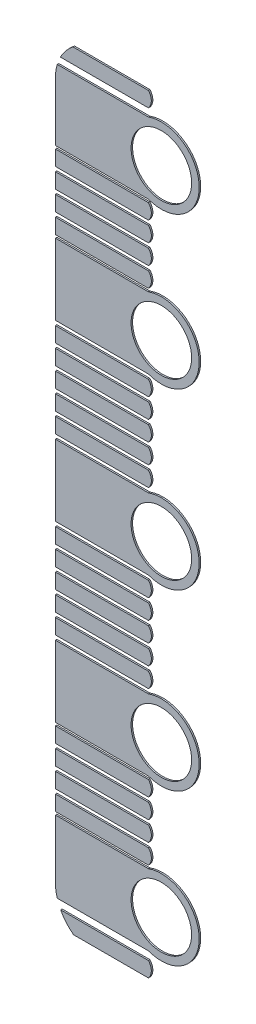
ISO-10303-21;
HEADER;
FILE_DESCRIPTION(('STEP AP214'),'2;1');
FILE_NAME('part.step','',(''),(''),'','','');
FILE_SCHEMA(('AUTOMOTIVE_DESIGN { 1 0 10303 214 1 1 1 1 }'));
ENDSEC;
DATA;
#1=APPLICATION_CONTEXT('core data for automotive mechanical design processes');
#2=APPLICATION_PROTOCOL_DEFINITION('international standard','automotive_design',2000,#1);
#3=PRODUCT_CONTEXT('',#1,'mechanical');
#4=PRODUCT('Part','Part','',(#3));
#5=PRODUCT_RELATED_PRODUCT_CATEGORY('part','',(#4));
#6=PRODUCT_DEFINITION_FORMATION('','',#4);
#7=PRODUCT_DEFINITION_CONTEXT('part definition',#1,'design');
#8=PRODUCT_DEFINITION('design','',#6,#7);
#9=PRODUCT_DEFINITION_SHAPE('','',#8);
#10=(LENGTH_UNIT() NAMED_UNIT(*) SI_UNIT(.MILLI.,.METRE.));
#11=(NAMED_UNIT(*) PLANE_ANGLE_UNIT() SI_UNIT($,.RADIAN.));
#12=(NAMED_UNIT(*) SI_UNIT($,.STERADIAN.) SOLID_ANGLE_UNIT());
#13=UNCERTAINTY_MEASURE_WITH_UNIT(LENGTH_MEASURE(1.E-05),#10,'distance_accuracy_value','');
#14=(GEOMETRIC_REPRESENTATION_CONTEXT(3) GLOBAL_UNCERTAINTY_ASSIGNED_CONTEXT((#13)) GLOBAL_UNIT_ASSIGNED_CONTEXT((#10,
#11,#12)) REPRESENTATION_CONTEXT('',''));
#15=CARTESIAN_POINT('',(0.,0.,0.));
#16=DIRECTION('',(0.,0.,1.));
#17=DIRECTION('',(1.,0.,0.));
#18=AXIS2_PLACEMENT_3D('',#15,#16,#17);
#19=CARTESIAN_POINT('',(-16.9912890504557,0.,0.1));
#20=DIRECTION('',(0.,0.,1.));
#21=DIRECTION('',(1.,0.,0.));
#22=AXIS2_PLACEMENT_3D('',#19,#20,#21);
#23=PLANE('',#22);
#24=CARTESIAN_POINT('',(-14.,0.,0.1));
#25=DIRECTION('',(0.,0.,1.));
#26=DIRECTION('',(1.,0.,0.));
#27=AXIS2_PLACEMENT_3D('',#24,#25,#26);
#28=CIRCLE('',#27,2.);
#29=CARTESIAN_POINT('',(-12.,0.,0.1));
#30=VERTEX_POINT('',#29);
#31=EDGE_CURVE('P0_E95',#30,#30,#28,.F.);
#32=ORIENTED_EDGE('',*,*,#31,.T.);
#33=EDGE_LOOP('',(#32));
#34=FACE_BOUND('',#33,.T.);
#35=CARTESIAN_POINT('',(-14.,0.,0.1));
#36=DIRECTION('',(0.,0.,1.));
#37=DIRECTION('',(1.,0.,0.));
#38=AXIS2_PLACEMENT_3D('',#35,#36,#37);
#39=CIRCLE('',#38,2.5);
#40=CARTESIAN_POINT('',(-14.8529361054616,2.35,0.1));
#41=VERTEX_POINT('',#40);
#42=CARTESIAN_POINT('',(-14.8529361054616,-2.35,0.1));
#43=VERTEX_POINT('',#42);
#44=EDGE_CURVE('P0_E19',#41,#43,#39,.F.);
#45=ORIENTED_EDGE('',*,*,#44,.F.);
#46=DIRECTION('',(-1.,0.,0.));
#47=VECTOR('',#46,1.);
#48=CARTESIAN_POINT('',(-14.8529361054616,2.35,0.1));
#49=LINE('',#48,#47);
#50=CARTESIAN_POINT('',(-21.,2.35,0.1));
#51=VERTEX_POINT('',#50);
#52=EDGE_CURVE('P0_E53',#51,#41,#49,.F.);
#53=ORIENTED_EDGE('',*,*,#52,.F.);
#54=DIRECTION('',(0.,1.,0.));
#55=VECTOR('',#54,1.);
#56=CARTESIAN_POINT('',(-21.,2.35,0.1));
#57=LINE('',#56,#55);
#58=CARTESIAN_POINT('',(-21.,-2.35,0.1));
#59=VERTEX_POINT('',#58);
#60=EDGE_CURVE('P0_E68',#59,#51,#57,.T.);
#61=ORIENTED_EDGE('',*,*,#60,.F.);
#62=DIRECTION('',(1.,0.,0.));
#63=VECTOR('',#62,1.);
#64=CARTESIAN_POINT('',(-21.,-2.35,0.1));
#65=LINE('',#64,#63);
#66=EDGE_CURVE('P0_E66',#43,#59,#65,.F.);
#67=ORIENTED_EDGE('',*,*,#66,.F.);
#68=EDGE_LOOP('',(#45,#53,#61,#67));
#69=FACE_BOUND('',#68,.T.);
#70=ADVANCED_FACE('P0_F15',(#34,#69),#23,.T.);
#71=CARTESIAN_POINT('',(-21.,-2.35,0.));
#72=DIRECTION('',(0.,-1.,0.));
#73=DIRECTION('',(1.,0.,0.));
#74=AXIS2_PLACEMENT_3D('',#71,#72,#73);
#75=PLANE('',#74);
#76=ORIENTED_EDGE('',*,*,#66,.T.);
#77=DIRECTION('',(0.,0.,1.));
#78=VECTOR('',#77,1.);
#79=CARTESIAN_POINT('',(-21.,-2.35,0.));
#80=LINE('',#79,#78);
#81=CARTESIAN_POINT('',(-21.,-2.35,0.));
#82=VERTEX_POINT('',#81);
#83=EDGE_CURVE('P0_E82',#82,#59,#80,.T.);
#84=ORIENTED_EDGE('',*,*,#83,.F.);
#85=DIRECTION('',(1.,0.,0.));
#86=VECTOR('',#85,1.);
#87=CARTESIAN_POINT('',(-16.9912890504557,-2.35,0.));
#88=LINE('',#87,#86);
#89=CARTESIAN_POINT('',(-14.8529361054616,-2.35,0.));
#90=VERTEX_POINT('',#89);
#91=EDGE_CURVE('P0_E75',#82,#90,#88,.T.);
#92=ORIENTED_EDGE('',*,*,#91,.T.);
#93=DIRECTION('',(0.,0.,1.));
#94=VECTOR('',#93,1.);
#95=CARTESIAN_POINT('',(-14.8529361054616,-2.35,0.));
#96=LINE('',#95,#94);
#97=EDGE_CURVE('P0_E62',#43,#90,#96,.F.);
#98=ORIENTED_EDGE('',*,*,#97,.F.);
#99=EDGE_LOOP('',(#76,#84,#92,#98));
#100=FACE_BOUND('',#99,.T.);
#101=ADVANCED_FACE('P0_F74',(#100),#75,.T.);
#102=CARTESIAN_POINT('',(-14.,0.,0.));
#103=DIRECTION('',(0.,0.,1.));
#104=DIRECTION('',(1.,0.,0.));
#105=AXIS2_PLACEMENT_3D('',#102,#103,#104);
#106=CYLINDRICAL_SURFACE('',#105,2.5);
#107=ORIENTED_EDGE('',*,*,#44,.T.);
#108=ORIENTED_EDGE('',*,*,#97,.T.);
#109=CARTESIAN_POINT('',(-14.,0.,0.));
#110=DIRECTION('',(0.,0.,1.));
#111=DIRECTION('',(1.,0.,0.));
#112=AXIS2_PLACEMENT_3D('',#109,#110,#111);
#113=CIRCLE('',#112,2.5);
#114=CARTESIAN_POINT('',(-14.8529361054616,2.35,0.));
#115=VERTEX_POINT('',#114);
#116=EDGE_CURVE('P0_E93',#90,#115,#113,.T.);
#117=ORIENTED_EDGE('',*,*,#116,.T.);
#118=DIRECTION('',(0.,0.,1.));
#119=VECTOR('',#118,1.);
#120=CARTESIAN_POINT('',(-14.8529361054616,2.35,0.));
#121=LINE('',#120,#119);
#122=EDGE_CURVE('P0_E64',#41,#115,#121,.F.);
#123=ORIENTED_EDGE('',*,*,#122,.F.);
#124=EDGE_LOOP('',(#107,#108,#117,#123));
#125=FACE_BOUND('',#124,.T.);
#126=ADVANCED_FACE('P0_F59',(#125),#106,.T.);
#127=CARTESIAN_POINT('',(-14.8529361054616,2.35,0.));
#128=DIRECTION('',(0.,1.,0.));
#129=DIRECTION('',(-1.,0.,0.));
#130=AXIS2_PLACEMENT_3D('',#127,#128,#129);
#131=PLANE('',#130);
#132=ORIENTED_EDGE('',*,*,#52,.T.);
#133=ORIENTED_EDGE('',*,*,#122,.T.);
#134=DIRECTION('',(1.,0.,0.));
#135=VECTOR('',#134,1.);
#136=CARTESIAN_POINT('',(-16.9912890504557,2.35,0.));
#137=LINE('',#136,#135);
#138=CARTESIAN_POINT('',(-21.,2.35,0.));
#139=VERTEX_POINT('',#138);
#140=EDGE_CURVE('P0_E94',#115,#139,#137,.F.);
#141=ORIENTED_EDGE('',*,*,#140,.T.);
#142=DIRECTION('',(0.,0.,1.));
#143=VECTOR('',#142,1.);
#144=CARTESIAN_POINT('',(-21.,2.35,0.));
#145=LINE('',#144,#143);
#146=EDGE_CURVE('P0_E34',#51,#139,#145,.F.);
#147=ORIENTED_EDGE('',*,*,#146,.F.);
#148=EDGE_LOOP('',(#132,#133,#141,#147));
#149=FACE_BOUND('',#148,.T.);
#150=ADVANCED_FACE('P0_F111',(#149),#131,.T.);
#151=CARTESIAN_POINT('',(-21.,2.35,0.));
#152=DIRECTION('',(-1.,0.,0.));
#153=DIRECTION('',(0.,0.,1.));
#154=AXIS2_PLACEMENT_3D('',#151,#152,#153);
#155=PLANE('',#154);
#156=ORIENTED_EDGE('',*,*,#60,.T.);
#157=ORIENTED_EDGE('',*,*,#146,.T.);
#158=DIRECTION('',(0.,1.,0.));
#159=VECTOR('',#158,1.);
#160=CARTESIAN_POINT('',(-21.,0.,0.));
#161=LINE('',#160,#159);
#162=EDGE_CURVE('P0_E25',#139,#82,#161,.F.);
#163=ORIENTED_EDGE('',*,*,#162,.T.);
#164=ORIENTED_EDGE('',*,*,#83,.T.);
#165=EDGE_LOOP('',(#156,#157,#163,#164));
#166=FACE_BOUND('',#165,.T.);
#167=ADVANCED_FACE('P0_F113',(#166),#155,.T.);
#168=CARTESIAN_POINT('',(-14.,0.,0.));
#169=DIRECTION('',(0.,0.,1.));
#170=DIRECTION('',(1.,0.,0.));
#171=AXIS2_PLACEMENT_3D('',#168,#169,#170);
#172=CYLINDRICAL_SURFACE('',#171,2.);
#173=CARTESIAN_POINT('',(-14.,0.,0.));
#174=DIRECTION('',(0.,0.,1.));
#175=DIRECTION('',(1.,0.,0.));
#176=AXIS2_PLACEMENT_3D('',#173,#174,#175);
#177=CIRCLE('',#176,2.);
#178=CARTESIAN_POINT('',(-12.,0.,0.));
#179=VERTEX_POINT('',#178);
#180=EDGE_CURVE('P0_E10',#179,#179,#177,.F.);
#181=ORIENTED_EDGE('',*,*,#180,.T.);
#182=EDGE_LOOP('',(#181));
#183=FACE_BOUND('',#182,.T.);
#184=ORIENTED_EDGE('',*,*,#31,.F.);
#185=EDGE_LOOP('',(#184));
#186=FACE_BOUND('',#185,.T.);
#187=ADVANCED_FACE('P0_F115',(#183,#186),#172,.F.);
#188=CARTESIAN_POINT('',(-16.9912890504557,0.,0.));
#189=DIRECTION('',(0.,0.,1.));
#190=DIRECTION('',(1.,0.,0.));
#191=AXIS2_PLACEMENT_3D('',#188,#189,#190);
#192=PLANE('',#191);
#193=ORIENTED_EDGE('',*,*,#180,.F.);
#194=EDGE_LOOP('',(#193));
#195=FACE_BOUND('',#194,.T.);
#196=ORIENTED_EDGE('',*,*,#140,.F.);
#197=ORIENTED_EDGE('',*,*,#116,.F.);
#198=ORIENTED_EDGE('',*,*,#91,.F.);
#199=ORIENTED_EDGE('',*,*,#162,.F.);
#200=EDGE_LOOP('',(#196,#197,#198,#199));
#201=FACE_BOUND('',#200,.T.);
#202=ADVANCED_FACE('P0_F17',(#195,#201),#192,.F.);
#203=CLOSED_SHELL('',(#70,#101,#126,#150,#167,#187,#202));
#204=MANIFOLD_SOLID_BREP('P0_B1',#203);
#205=CARTESIAN_POINT('',(-16.9356321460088,-21.4715461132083,0.));
#206=DIRECTION('',(0.,0.,1.));
#207=DIRECTION('',(1.,0.,0.));
#208=AXIS2_PLACEMENT_3D('',#205,#206,#207);
#209=PLANE('',#208);
#210=CARTESIAN_POINT('',(-14.,-21.5,0.));
#211=DIRECTION('',(0.,0.,1.));
#212=DIRECTION('',(1.,0.,0.));
#213=AXIS2_PLACEMENT_3D('',#210,#211,#212);
#214=CIRCLE('',#213,2.);
#215=CARTESIAN_POINT('',(-12.,-21.5,0.));
#216=VERTEX_POINT('',#215);
#217=EDGE_CURVE('P1_E97',#216,#216,#214,.T.);
#218=ORIENTED_EDGE('',*,*,#217,.T.);
#219=EDGE_LOOP('',(#218));
#220=FACE_BOUND('',#219,.T.);
#221=DIRECTION('',(0.,1.,0.));
#222=VECTOR('',#221,1.);
#223=CARTESIAN_POINT('',(-21.,-19.15,0.));
#224=LINE('',#223,#222);
#225=CARTESIAN_POINT('',(-21.,-19.15,0.));
#226=VERTEX_POINT('',#225);
#227=CARTESIAN_POINT('',(-21.,-23.,0.));
#228=VERTEX_POINT('',#227);
#229=EDGE_CURVE('P1_E64',#226,#228,#224,.F.);
#230=ORIENTED_EDGE('',*,*,#229,.F.);
#231=DIRECTION('',(1.,0.,0.));
#232=VECTOR('',#231,1.);
#233=CARTESIAN_POINT('',(-14.8529361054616,-19.15,0.));
#234=LINE('',#233,#232);
#235=CARTESIAN_POINT('',(-14.8529361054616,-19.15,0.));
#236=VERTEX_POINT('',#235);
#237=EDGE_CURVE('P1_E81',#236,#226,#234,.F.);
#238=ORIENTED_EDGE('',*,*,#237,.F.);
#239=CARTESIAN_POINT('',(-14.,-21.5,0.));
#240=DIRECTION('',(0.,0.,1.));
#241=DIRECTION('',(1.,0.,0.));
#242=AXIS2_PLACEMENT_3D('',#239,#240,#241);
#243=CIRCLE('',#242,2.5);
#244=CARTESIAN_POINT('',(-14.8529361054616,-23.85,0.));
#245=VERTEX_POINT('',#244);
#246=EDGE_CURVE('P1_E99',#245,#236,#243,.T.);
#247=ORIENTED_EDGE('',*,*,#246,.F.);
#248=DIRECTION('',(1.,0.,0.));
#249=VECTOR('',#248,1.);
#250=CARTESIAN_POINT('',(-20.8770644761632,-23.85,0.));
#251=LINE('',#250,#249);
#252=CARTESIAN_POINT('',(-20.8770644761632,-23.85,0.));
#253=VERTEX_POINT('',#252);
#254=EDGE_CURVE('P1_E66',#253,#245,#251,.T.);
#255=ORIENTED_EDGE('',*,*,#254,.F.);
#256=CARTESIAN_POINT('',(-18.,-23.,0.));
#257=DIRECTION('',(0.,0.,1.));
#258=DIRECTION('',(1.,0.,0.));
#259=AXIS2_PLACEMENT_3D('',#256,#257,#258);
#260=CIRCLE('',#259,2.99999999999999);
#261=EDGE_CURVE('P1_E20',#228,#253,#260,.T.);
#262=ORIENTED_EDGE('',*,*,#261,.F.);
#263=EDGE_LOOP('',(#230,#238,#247,#255,#262));
#264=FACE_BOUND('',#263,.T.);
#265=ADVANCED_FACE('P1_F16',(#220,#264),#209,.F.);
#266=CARTESIAN_POINT('',(-18.,-23.,0.));
#267=DIRECTION('',(0.,0.,1.));
#268=DIRECTION('',(1.,0.,0.));
#269=AXIS2_PLACEMENT_3D('',#266,#267,#268);
#270=CYLINDRICAL_SURFACE('',#269,2.99999999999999);
#271=CARTESIAN_POINT('',(-18.,-23.,0.1));
#272=DIRECTION('',(0.,0.,1.));
#273=DIRECTION('',(1.,0.,0.));
#274=AXIS2_PLACEMENT_3D('',#271,#272,#273);
#275=CIRCLE('',#274,2.99999999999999);
#276=CARTESIAN_POINT('',(-21.,-23.,0.1));
#277=VERTEX_POINT('',#276);
#278=CARTESIAN_POINT('',(-20.8770644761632,-23.85,0.1));
#279=VERTEX_POINT('',#278);
#280=EDGE_CURVE('P1_E73',#277,#279,#275,.T.);
#281=ORIENTED_EDGE('',*,*,#280,.F.);
#282=DIRECTION('',(0.,0.,1.));
#283=VECTOR('',#282,1.);
#284=CARTESIAN_POINT('',(-21.,-23.,0.));
#285=LINE('',#284,#283);
#286=EDGE_CURVE('P1_E70',#228,#277,#285,.T.);
#287=ORIENTED_EDGE('',*,*,#286,.F.);
#288=ORIENTED_EDGE('',*,*,#261,.T.);
#289=DIRECTION('',(0.,0.,1.));
#290=VECTOR('',#289,1.);
#291=CARTESIAN_POINT('',(-20.8770644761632,-23.85,0.));
#292=LINE('',#291,#290);
#293=EDGE_CURVE('P1_E89',#279,#253,#292,.F.);
#294=ORIENTED_EDGE('',*,*,#293,.F.);
#295=EDGE_LOOP('',(#281,#287,#288,#294));
#296=FACE_BOUND('',#295,.T.);
#297=ADVANCED_FACE('P1_F71',(#296),#270,.T.);
#298=CARTESIAN_POINT('',(-20.8770644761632,-23.85,0.));
#299=DIRECTION('',(0.,-1.,0.));
#300=DIRECTION('',(1.,0.,0.));
#301=AXIS2_PLACEMENT_3D('',#298,#299,#300);
#302=PLANE('',#301);
#303=DIRECTION('',(1.,0.,0.));
#304=VECTOR('',#303,1.);
#305=CARTESIAN_POINT('',(-16.9356321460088,-23.85,0.1));
#306=LINE('',#305,#304);
#307=CARTESIAN_POINT('',(-14.8529361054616,-23.85,0.1));
#308=VERTEX_POINT('',#307);
#309=EDGE_CURVE('P1_E95',#279,#308,#306,.T.);
#310=ORIENTED_EDGE('',*,*,#309,.F.);
#311=ORIENTED_EDGE('',*,*,#293,.T.);
#312=ORIENTED_EDGE('',*,*,#254,.T.);
#313=DIRECTION('',(0.,0.,1.));
#314=VECTOR('',#313,1.);
#315=CARTESIAN_POINT('',(-14.8529361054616,-23.85,0.));
#316=LINE('',#315,#314);
#317=EDGE_CURVE('P1_E101',#308,#245,#316,.F.);
#318=ORIENTED_EDGE('',*,*,#317,.F.);
#319=EDGE_LOOP('',(#310,#311,#312,#318));
#320=FACE_BOUND('',#319,.T.);
#321=ADVANCED_FACE('P1_F109',(#320),#302,.T.);
#322=CARTESIAN_POINT('',(-14.,-21.5,0.));
#323=DIRECTION('',(0.,0.,1.));
#324=DIRECTION('',(1.,0.,0.));
#325=AXIS2_PLACEMENT_3D('',#322,#323,#324);
#326=CYLINDRICAL_SURFACE('',#325,2.5);
#327=CARTESIAN_POINT('',(-14.,-21.5,0.1));
#328=DIRECTION('',(0.,0.,1.));
#329=DIRECTION('',(1.,0.,0.));
#330=AXIS2_PLACEMENT_3D('',#327,#328,#329);
#331=CIRCLE('',#330,2.5);
#332=CARTESIAN_POINT('',(-14.8529361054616,-19.15,0.1));
#333=VERTEX_POINT('',#332);
#334=EDGE_CURVE('P1_E91',#308,#333,#331,.T.);
#335=ORIENTED_EDGE('',*,*,#334,.F.);
#336=ORIENTED_EDGE('',*,*,#317,.T.);
#337=ORIENTED_EDGE('',*,*,#246,.T.);
#338=DIRECTION('',(0.,0.,1.));
#339=VECTOR('',#338,1.);
#340=CARTESIAN_POINT('',(-14.8529361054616,-19.15,0.));
#341=LINE('',#340,#339);
#342=EDGE_CURVE('P1_E78',#333,#236,#341,.F.);
#343=ORIENTED_EDGE('',*,*,#342,.F.);
#344=EDGE_LOOP('',(#335,#336,#337,#343));
#345=FACE_BOUND('',#344,.T.);
#346=ADVANCED_FACE('P1_F111',(#345),#326,.T.);
#347=CARTESIAN_POINT('',(-14.8529361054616,-19.15,0.));
#348=DIRECTION('',(0.,1.,0.));
#349=DIRECTION('',(0.,0.,1.));
#350=AXIS2_PLACEMENT_3D('',#347,#348,#349);
#351=PLANE('',#350);
#352=DIRECTION('',(1.,0.,0.));
#353=VECTOR('',#352,1.);
#354=CARTESIAN_POINT('',(-16.9356321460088,-19.15,0.1));
#355=LINE('',#354,#353);
#356=CARTESIAN_POINT('',(-21.,-19.15,0.1));
#357=VERTEX_POINT('',#356);
#358=EDGE_CURVE('P1_E94',#333,#357,#355,.F.);
#359=ORIENTED_EDGE('',*,*,#358,.F.);
#360=ORIENTED_EDGE('',*,*,#342,.T.);
#361=ORIENTED_EDGE('',*,*,#237,.T.);
#362=DIRECTION('',(0.,0.,1.));
#363=VECTOR('',#362,1.);
#364=CARTESIAN_POINT('',(-21.,-19.15,0.));
#365=LINE('',#364,#363);
#366=EDGE_CURVE('P1_E35',#357,#226,#365,.F.);
#367=ORIENTED_EDGE('',*,*,#366,.F.);
#368=EDGE_LOOP('',(#359,#360,#361,#367));
#369=FACE_BOUND('',#368,.T.);
#370=ADVANCED_FACE('P1_F108',(#369),#351,.T.);
#371=CARTESIAN_POINT('',(-21.,-19.15,0.));
#372=DIRECTION('',(-1.,0.,0.));
#373=DIRECTION('',(0.,0.,1.));
#374=AXIS2_PLACEMENT_3D('',#371,#372,#373);
#375=PLANE('',#374);
#376=DIRECTION('',(0.,1.,0.));
#377=VECTOR('',#376,1.);
#378=CARTESIAN_POINT('',(-21.,-21.4715461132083,0.1));
#379=LINE('',#378,#377);
#380=EDGE_CURVE('P1_E26',#357,#277,#379,.F.);
#381=ORIENTED_EDGE('',*,*,#380,.F.);
#382=ORIENTED_EDGE('',*,*,#366,.T.);
#383=ORIENTED_EDGE('',*,*,#229,.T.);
#384=ORIENTED_EDGE('',*,*,#286,.T.);
#385=EDGE_LOOP('',(#381,#382,#383,#384));
#386=FACE_BOUND('',#385,.T.);
#387=ADVANCED_FACE('P1_F77',(#386),#375,.T.);
#388=CARTESIAN_POINT('',(-14.,-21.5,0.));
#389=DIRECTION('',(0.,0.,1.));
#390=DIRECTION('',(1.,0.,0.));
#391=AXIS2_PLACEMENT_3D('',#388,#389,#390);
#392=CYLINDRICAL_SURFACE('',#391,2.);
#393=ORIENTED_EDGE('',*,*,#217,.F.);
#394=EDGE_LOOP('',(#393));
#395=FACE_BOUND('',#394,.T.);
#396=CARTESIAN_POINT('',(-14.,-21.5,0.1));
#397=DIRECTION('',(0.,0.,1.));
#398=DIRECTION('',(1.,0.,0.));
#399=AXIS2_PLACEMENT_3D('',#396,#397,#398);
#400=CIRCLE('',#399,2.);
#401=CARTESIAN_POINT('',(-12.,-21.5,0.1));
#402=VERTEX_POINT('',#401);
#403=EDGE_CURVE('P1_E11',#402,#402,#400,.F.);
#404=ORIENTED_EDGE('',*,*,#403,.F.);
#405=EDGE_LOOP('',(#404));
#406=FACE_BOUND('',#405,.T.);
#407=ADVANCED_FACE('P1_F126',(#395,#406),#392,.F.);
#408=CARTESIAN_POINT('',(-16.9356321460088,-21.4715461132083,0.1));
#409=DIRECTION('',(0.,0.,1.));
#410=DIRECTION('',(1.,0.,0.));
#411=AXIS2_PLACEMENT_3D('',#408,#409,#410);
#412=PLANE('',#411);
#413=ORIENTED_EDGE('',*,*,#403,.T.);
#414=EDGE_LOOP('',(#413));
#415=FACE_BOUND('',#414,.T.);
#416=ORIENTED_EDGE('',*,*,#358,.T.);
#417=ORIENTED_EDGE('',*,*,#380,.T.);
#418=ORIENTED_EDGE('',*,*,#280,.T.);
#419=ORIENTED_EDGE('',*,*,#309,.T.);
#420=ORIENTED_EDGE('',*,*,#334,.T.);
#421=EDGE_LOOP('',(#416,#417,#418,#419,#420));
#422=FACE_BOUND('',#421,.T.);
#423=ADVANCED_FACE('P1_F18',(#415,#422),#412,.T.);
#424=CLOSED_SHELL('',(#265,#297,#321,#346,#370,#387,#407,#423));
#425=MANIFOLD_SOLID_BREP('P1_B1',#424);
#426=CARTESIAN_POINT('',(-17.9575509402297,4.45,0.));
#427=DIRECTION('',(0.,0.,1.));
#428=DIRECTION('',(1.,0.,0.));
#429=AXIS2_PLACEMENT_3D('',#426,#427,#428);
#430=PLANE('',#429);
#431=CARTESIAN_POINT('',(-15.4011760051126,4.45,0.));
#432=DIRECTION('',(0.,0.,1.));
#433=DIRECTION('',(1.,0.,0.));
#434=AXIS2_PLACEMENT_3D('',#431,#432,#433);
#435=CIRCLE('',#434,0.742002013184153);
#436=CARTESIAN_POINT('',(-14.8529361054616,3.95,0.));
#437=VERTEX_POINT('',#436);
#438=CARTESIAN_POINT('',(-14.8529361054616,4.95,0.));
#439=VERTEX_POINT('',#438);
#440=EDGE_CURVE('P2_E20',#437,#439,#435,.T.);
#441=ORIENTED_EDGE('',*,*,#440,.F.);
#442=DIRECTION('',(1.,0.,0.));
#443=VECTOR('',#442,1.);
#444=CARTESIAN_POINT('',(-21.,3.95,0.));
#445=LINE('',#444,#443);
#446=CARTESIAN_POINT('',(-21.,3.95,0.));
#447=VERTEX_POINT('',#446);
#448=EDGE_CURVE('P2_E53',#447,#437,#445,.T.);
#449=ORIENTED_EDGE('',*,*,#448,.F.);
#450=DIRECTION('',(0.,1.,0.));
#451=VECTOR('',#450,1.);
#452=CARTESIAN_POINT('',(-21.,4.95,0.));
#453=LINE('',#452,#451);
#454=CARTESIAN_POINT('',(-21.,4.95,0.));
#455=VERTEX_POINT('',#454);
#456=EDGE_CURVE('P2_E69',#455,#447,#453,.F.);
#457=ORIENTED_EDGE('',*,*,#456,.F.);
#458=DIRECTION('',(1.,0.,0.));
#459=VECTOR('',#458,1.);
#460=CARTESIAN_POINT('',(-14.8529361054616,4.95,0.));
#461=LINE('',#460,#459);
#462=EDGE_CURVE('P2_E67',#439,#455,#461,.F.);
#463=ORIENTED_EDGE('',*,*,#462,.F.);
#464=EDGE_LOOP('',(#441,#449,#457,#463));
#465=FACE_BOUND('',#464,.T.);
#466=ADVANCED_FACE('P2_F16',(#465),#430,.F.);
#467=CARTESIAN_POINT('',(-14.8529361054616,4.95,0.));
#468=DIRECTION('',(0.,1.,0.));
#469=DIRECTION('',(0.,0.,1.));
#470=AXIS2_PLACEMENT_3D('',#467,#468,#469);
#471=PLANE('',#470);
#472=DIRECTION('',(1.,0.,0.));
#473=VECTOR('',#472,1.);
#474=CARTESIAN_POINT('',(-17.9575509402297,4.95,0.1));
#475=LINE('',#474,#473);
#476=CARTESIAN_POINT('',(-14.8529361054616,4.95,0.1));
#477=VERTEX_POINT('',#476);
#478=CARTESIAN_POINT('',(-21.,4.95,0.1));
#479=VERTEX_POINT('',#478);
#480=EDGE_CURVE('P2_E65',#477,#479,#475,.F.);
#481=ORIENTED_EDGE('',*,*,#480,.F.);
#482=DIRECTION('',(0.,0.,1.));
#483=VECTOR('',#482,1.);
#484=CARTESIAN_POINT('',(-14.8529361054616,4.95,0.));
#485=LINE('',#484,#483);
#486=EDGE_CURVE('P2_E80',#439,#477,#485,.T.);
#487=ORIENTED_EDGE('',*,*,#486,.F.);
#488=ORIENTED_EDGE('',*,*,#462,.T.);
#489=DIRECTION('',(0.,0.,1.));
#490=VECTOR('',#489,1.);
#491=CARTESIAN_POINT('',(-21.,4.95,0.));
#492=LINE('',#491,#490);
#493=EDGE_CURVE('P2_E60',#479,#455,#492,.F.);
#494=ORIENTED_EDGE('',*,*,#493,.F.);
#495=EDGE_LOOP('',(#481,#487,#488,#494));
#496=FACE_BOUND('',#495,.T.);
#497=ADVANCED_FACE('P2_F62',(#496),#471,.T.);
#498=CARTESIAN_POINT('',(-21.,4.95,0.));
#499=DIRECTION('',(-1.,0.,0.));
#500=DIRECTION('',(0.,0.,1.));
#501=AXIS2_PLACEMENT_3D('',#498,#499,#500);
#502=PLANE('',#501);
#503=DIRECTION('',(0.,1.,0.));
#504=VECTOR('',#503,1.);
#505=CARTESIAN_POINT('',(-21.,4.45,0.1));
#506=LINE('',#505,#504);
#507=CARTESIAN_POINT('',(-21.,3.95,0.1));
#508=VERTEX_POINT('',#507);
#509=EDGE_CURVE('P2_E72',#479,#508,#506,.F.);
#510=ORIENTED_EDGE('',*,*,#509,.F.);
#511=ORIENTED_EDGE('',*,*,#493,.T.);
#512=ORIENTED_EDGE('',*,*,#456,.T.);
#513=DIRECTION('',(0.,0.,-1.));
#514=VECTOR('',#513,1.);
#515=CARTESIAN_POINT('',(-21.,3.95,0.));
#516=LINE('',#515,#514);
#517=EDGE_CURVE('P2_E75',#508,#447,#516,.T.);
#518=ORIENTED_EDGE('',*,*,#517,.F.);
#519=EDGE_LOOP('',(#510,#511,#512,#518));
#520=FACE_BOUND('',#519,.T.);
#521=ADVANCED_FACE('P2_F73',(#520),#502,.T.);
#522=CARTESIAN_POINT('',(-21.,3.95,0.));
#523=DIRECTION('',(0.,-1.,0.));
#524=DIRECTION('',(0.,0.,-1.));
#525=AXIS2_PLACEMENT_3D('',#522,#523,#524);
#526=PLANE('',#525);
#527=DIRECTION('',(1.,0.,0.));
#528=VECTOR('',#527,1.);
#529=CARTESIAN_POINT('',(-17.9575509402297,3.95,0.1));
#530=LINE('',#529,#528);
#531=CARTESIAN_POINT('',(-14.8529361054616,3.95,0.1));
#532=VERTEX_POINT('',#531);
#533=EDGE_CURVE('P2_E26',#508,#532,#530,.T.);
#534=ORIENTED_EDGE('',*,*,#533,.F.);
#535=ORIENTED_EDGE('',*,*,#517,.T.);
#536=ORIENTED_EDGE('',*,*,#448,.T.);
#537=DIRECTION('',(0.,0.,1.));
#538=VECTOR('',#537,1.);
#539=CARTESIAN_POINT('',(-14.8529361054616,3.95,0.));
#540=LINE('',#539,#538);
#541=EDGE_CURVE('P2_E34',#532,#437,#540,.F.);
#542=ORIENTED_EDGE('',*,*,#541,.F.);
#543=EDGE_LOOP('',(#534,#535,#536,#542));
#544=FACE_BOUND('',#543,.T.);
#545=ADVANCED_FACE('P2_F104',(#544),#526,.T.);
#546=CARTESIAN_POINT('',(-15.4011760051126,4.45,0.));
#547=DIRECTION('',(0.,0.,1.));
#548=DIRECTION('',(1.,0.,0.));
#549=AXIS2_PLACEMENT_3D('',#546,#547,#548);
#550=CYLINDRICAL_SURFACE('',#549,0.742002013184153);
#551=CARTESIAN_POINT('',(-15.4011760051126,4.45,0.1));
#552=DIRECTION('',(0.,0.,1.));
#553=DIRECTION('',(1.,0.,0.));
#554=AXIS2_PLACEMENT_3D('',#551,#552,#553);
#555=CIRCLE('',#554,0.742002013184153);
#556=EDGE_CURVE('P2_E11',#532,#477,#555,.T.);
#557=ORIENTED_EDGE('',*,*,#556,.F.);
#558=ORIENTED_EDGE('',*,*,#541,.T.);
#559=ORIENTED_EDGE('',*,*,#440,.T.);
#560=ORIENTED_EDGE('',*,*,#486,.T.);
#561=EDGE_LOOP('',(#557,#558,#559,#560));
#562=FACE_BOUND('',#561,.T.);
#563=ADVANCED_FACE('P2_F106',(#562),#550,.T.);
#564=CARTESIAN_POINT('',(-17.9575509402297,4.45,0.1));
#565=DIRECTION('',(0.,0.,1.));
#566=DIRECTION('',(1.,0.,0.));
#567=AXIS2_PLACEMENT_3D('',#564,#565,#566);
#568=PLANE('',#567);
#569=ORIENTED_EDGE('',*,*,#533,.T.);
#570=ORIENTED_EDGE('',*,*,#556,.T.);
#571=ORIENTED_EDGE('',*,*,#480,.T.);
#572=ORIENTED_EDGE('',*,*,#509,.T.);
#573=EDGE_LOOP('',(#569,#570,#571,#572));
#574=FACE_BOUND('',#573,.T.);
#575=ADVANCED_FACE('P2_F18',(#574),#568,.T.);
#576=CLOSED_SHELL('',(#466,#497,#521,#545,#563,#575));
#577=MANIFOLD_SOLID_BREP('P2_B1',#576);
#578=CARTESIAN_POINT('',(-16.9356321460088,21.4715461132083,0.1));
#579=DIRECTION('',(0.,0.,1.));
#580=DIRECTION('',(1.,0.,0.));
#581=AXIS2_PLACEMENT_3D('',#578,#579,#580);
#582=PLANE('',#581);
#583=CARTESIAN_POINT('',(-14.,21.5,0.1));
#584=DIRECTION('',(0.,0.,1.));
#585=DIRECTION('',(1.,0.,0.));
#586=AXIS2_PLACEMENT_3D('',#583,#584,#585);
#587=CIRCLE('',#586,2.);
#588=CARTESIAN_POINT('',(-12.,21.5,0.1));
#589=VERTEX_POINT('',#588);
#590=EDGE_CURVE('P3_E102',#589,#589,#587,.F.);
#591=ORIENTED_EDGE('',*,*,#590,.T.);
#592=EDGE_LOOP('',(#591));
#593=FACE_BOUND('',#592,.T.);
#594=DIRECTION('',(0.,-1.,0.));
#595=VECTOR('',#594,1.);
#596=CARTESIAN_POINT('',(-21.,23.,0.1));
#597=LINE('',#596,#595);
#598=CARTESIAN_POINT('',(-21.,19.15,0.1));
#599=VERTEX_POINT('',#598);
#600=CARTESIAN_POINT('',(-21.,23.,0.1));
#601=VERTEX_POINT('',#600);
#602=EDGE_CURVE('P3_E60',#599,#601,#597,.F.);
#603=ORIENTED_EDGE('',*,*,#602,.F.);
#604=DIRECTION('',(1.,0.,0.));
#605=VECTOR('',#604,1.);
#606=CARTESIAN_POINT('',(-21.,19.15,0.1));
#607=LINE('',#606,#605);
#608=CARTESIAN_POINT('',(-14.8529361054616,19.15,0.1));
#609=VERTEX_POINT('',#608);
#610=EDGE_CURVE('P3_E90',#609,#599,#607,.F.);
#611=ORIENTED_EDGE('',*,*,#610,.F.);
#612=CARTESIAN_POINT('',(-14.,21.5,0.1));
#613=DIRECTION('',(0.,0.,1.));
#614=DIRECTION('',(1.,0.,0.));
#615=AXIS2_PLACEMENT_3D('',#612,#613,#614);
#616=CIRCLE('',#615,2.5);
#617=CARTESIAN_POINT('',(-14.8529361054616,23.85,0.1));
#618=VERTEX_POINT('',#617);
#619=EDGE_CURVE('P3_E77',#618,#609,#616,.F.);
#620=ORIENTED_EDGE('',*,*,#619,.F.);
#621=DIRECTION('',(1.,0.,0.));
#622=VECTOR('',#621,1.);
#623=CARTESIAN_POINT('',(-14.8529361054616,23.85,0.1));
#624=LINE('',#623,#622);
#625=CARTESIAN_POINT('',(-20.8770644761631,23.85,0.1));
#626=VERTEX_POINT('',#625);
#627=EDGE_CURVE('P3_E74',#626,#618,#624,.T.);
#628=ORIENTED_EDGE('',*,*,#627,.F.);
#629=CARTESIAN_POINT('',(-18.,23.,0.1));
#630=DIRECTION('',(0.,0.,1.));
#631=DIRECTION('',(1.,0.,0.));
#632=AXIS2_PLACEMENT_3D('',#629,#630,#631);
#633=CIRCLE('',#632,2.99999999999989);
#634=EDGE_CURVE('P3_E20',#601,#626,#633,.F.);
#635=ORIENTED_EDGE('',*,*,#634,.F.);
#636=EDGE_LOOP('',(#603,#611,#620,#628,#635));
#637=FACE_BOUND('',#636,.T.);
#638=ADVANCED_FACE('P3_F16',(#593,#637),#582,.T.);
#639=CARTESIAN_POINT('',(-14.8529361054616,23.85,0.));
#640=DIRECTION('',(0.,1.,0.));
#641=DIRECTION('',(0.,0.,1.));
#642=AXIS2_PLACEMENT_3D('',#639,#640,#641);
#643=PLANE('',#642);
#644=ORIENTED_EDGE('',*,*,#627,.T.);
#645=DIRECTION('',(0.,0.,1.));
#646=VECTOR('',#645,1.);
#647=CARTESIAN_POINT('',(-14.8529361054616,23.85,0.));
#648=LINE('',#647,#646);
#649=CARTESIAN_POINT('',(-14.8529361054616,23.85,0.));
#650=VERTEX_POINT('',#649);
#651=EDGE_CURVE('P3_E104',#650,#618,#648,.T.);
#652=ORIENTED_EDGE('',*,*,#651,.F.);
#653=DIRECTION('',(1.,0.,0.));
#654=VECTOR('',#653,1.);
#655=CARTESIAN_POINT('',(-16.9356321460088,23.85,0.));
#656=LINE('',#655,#654);
#657=CARTESIAN_POINT('',(-20.8770644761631,23.85,0.));
#658=VERTEX_POINT('',#657);
#659=EDGE_CURVE('P3_E84',#650,#658,#656,.F.);
#660=ORIENTED_EDGE('',*,*,#659,.T.);
#661=DIRECTION('',(0.,0.,1.));
#662=VECTOR('',#661,1.);
#663=CARTESIAN_POINT('',(-20.8770644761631,23.85,0.));
#664=LINE('',#663,#662);
#665=EDGE_CURVE('P3_E70',#626,#658,#664,.F.);
#666=ORIENTED_EDGE('',*,*,#665,.F.);
#667=EDGE_LOOP('',(#644,#652,#660,#666));
#668=FACE_BOUND('',#667,.T.);
#669=ADVANCED_FACE('P3_F83',(#668),#643,.T.);
#670=CARTESIAN_POINT('',(-18.,23.,0.));
#671=DIRECTION('',(0.,0.,1.));
#672=DIRECTION('',(1.,0.,0.));
#673=AXIS2_PLACEMENT_3D('',#670,#671,#672);
#674=CYLINDRICAL_SURFACE('',#673,2.99999999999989);
#675=ORIENTED_EDGE('',*,*,#634,.T.);
#676=ORIENTED_EDGE('',*,*,#665,.T.);
#677=CARTESIAN_POINT('',(-18.,23.,0.));
#678=DIRECTION('',(0.,0.,1.));
#679=DIRECTION('',(1.,0.,0.));
#680=AXIS2_PLACEMENT_3D('',#677,#678,#679);
#681=CIRCLE('',#680,2.99999999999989);
#682=CARTESIAN_POINT('',(-21.,23.,0.));
#683=VERTEX_POINT('',#682);
#684=EDGE_CURVE('P3_E99',#658,#683,#681,.T.);
#685=ORIENTED_EDGE('',*,*,#684,.T.);
#686=DIRECTION('',(0.,0.,1.));
#687=VECTOR('',#686,1.);
#688=CARTESIAN_POINT('',(-21.,23.,0.));
#689=LINE('',#688,#687);
#690=EDGE_CURVE('P3_E72',#601,#683,#689,.F.);
#691=ORIENTED_EDGE('',*,*,#690,.F.);
#692=EDGE_LOOP('',(#675,#676,#685,#691));
#693=FACE_BOUND('',#692,.T.);
#694=ADVANCED_FACE('P3_F67',(#693),#674,.T.);
#695=CARTESIAN_POINT('',(-21.,23.,0.));
#696=DIRECTION('',(-1.,0.,0.));
#697=DIRECTION('',(0.,-1.,0.));
#698=AXIS2_PLACEMENT_3D('',#695,#696,#697);
#699=PLANE('',#698);
#700=ORIENTED_EDGE('',*,*,#602,.T.);
#701=ORIENTED_EDGE('',*,*,#690,.T.);
#702=DIRECTION('',(0.,1.,0.));
#703=VECTOR('',#702,1.);
#704=CARTESIAN_POINT('',(-21.,21.4715461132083,0.));
#705=LINE('',#704,#703);
#706=CARTESIAN_POINT('',(-21.,19.15,0.));
#707=VERTEX_POINT('',#706);
#708=EDGE_CURVE('P3_E101',#683,#707,#705,.F.);
#709=ORIENTED_EDGE('',*,*,#708,.T.);
#710=DIRECTION('',(0.,0.,1.));
#711=VECTOR('',#710,1.);
#712=CARTESIAN_POINT('',(-21.,19.15,0.));
#713=LINE('',#712,#711);
#714=EDGE_CURVE('P3_E92',#599,#707,#713,.F.);
#715=ORIENTED_EDGE('',*,*,#714,.F.);
#716=EDGE_LOOP('',(#700,#701,#709,#715));
#717=FACE_BOUND('',#716,.T.);
#718=ADVANCED_FACE('P3_F123',(#717),#699,.T.);
#719=CARTESIAN_POINT('',(-21.,19.15,0.));
#720=DIRECTION('',(0.,-1.,0.));
#721=DIRECTION('',(1.,0.,0.));
#722=AXIS2_PLACEMENT_3D('',#719,#720,#721);
#723=PLANE('',#722);
#724=ORIENTED_EDGE('',*,*,#610,.T.);
#725=ORIENTED_EDGE('',*,*,#714,.T.);
#726=DIRECTION('',(1.,0.,0.));
#727=VECTOR('',#726,1.);
#728=CARTESIAN_POINT('',(-16.9356321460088,19.15,0.));
#729=LINE('',#728,#727);
#730=CARTESIAN_POINT('',(-14.8529361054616,19.15,0.));
#731=VERTEX_POINT('',#730);
#732=EDGE_CURVE('P3_E98',#707,#731,#729,.T.);
#733=ORIENTED_EDGE('',*,*,#732,.T.);
#734=DIRECTION('',(0.,0.,1.));
#735=VECTOR('',#734,1.);
#736=CARTESIAN_POINT('',(-14.8529361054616,19.15,0.));
#737=LINE('',#736,#735);
#738=EDGE_CURVE('P3_E35',#609,#731,#737,.F.);
#739=ORIENTED_EDGE('',*,*,#738,.F.);
#740=EDGE_LOOP('',(#724,#725,#733,#739));
#741=FACE_BOUND('',#740,.T.);
#742=ADVANCED_FACE('P3_F120',(#741),#723,.T.);
#743=CARTESIAN_POINT('',(-14.,21.5,0.));
#744=DIRECTION('',(0.,0.,1.));
#745=DIRECTION('',(1.,0.,0.));
#746=AXIS2_PLACEMENT_3D('',#743,#744,#745);
#747=CYLINDRICAL_SURFACE('',#746,2.5);
#748=ORIENTED_EDGE('',*,*,#619,.T.);
#749=ORIENTED_EDGE('',*,*,#738,.T.);
#750=CARTESIAN_POINT('',(-14.,21.5,0.));
#751=DIRECTION('',(0.,0.,1.));
#752=DIRECTION('',(1.,0.,0.));
#753=AXIS2_PLACEMENT_3D('',#750,#751,#752);
#754=CIRCLE('',#753,2.5);
#755=EDGE_CURVE('P3_E26',#731,#650,#754,.T.);
#756=ORIENTED_EDGE('',*,*,#755,.T.);
#757=ORIENTED_EDGE('',*,*,#651,.T.);
#758=EDGE_LOOP('',(#748,#749,#756,#757));
#759=FACE_BOUND('',#758,.T.);
#760=ADVANCED_FACE('P3_F131',(#759),#747,.T.);
#761=CARTESIAN_POINT('',(-14.,21.5,0.));
#762=DIRECTION('',(0.,0.,1.));
#763=DIRECTION('',(1.,0.,0.));
#764=AXIS2_PLACEMENT_3D('',#761,#762,#763);
#765=CYLINDRICAL_SURFACE('',#764,2.);
#766=CARTESIAN_POINT('',(-14.,21.5,0.));
#767=DIRECTION('',(0.,0.,1.));
#768=DIRECTION('',(1.,0.,0.));
#769=AXIS2_PLACEMENT_3D('',#766,#767,#768);
#770=CIRCLE('',#769,2.);
#771=CARTESIAN_POINT('',(-12.,21.5,0.));
#772=VERTEX_POINT('',#771);
#773=EDGE_CURVE('P3_E11',#772,#772,#770,.F.);
#774=ORIENTED_EDGE('',*,*,#773,.T.);
#775=EDGE_LOOP('',(#774));
#776=FACE_BOUND('',#775,.T.);
#777=ORIENTED_EDGE('',*,*,#590,.F.);
#778=EDGE_LOOP('',(#777));
#779=FACE_BOUND('',#778,.T.);
#780=ADVANCED_FACE('P3_F135',(#776,#779),#765,.F.);
#781=CARTESIAN_POINT('',(-16.9356321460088,21.4715461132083,0.));
#782=DIRECTION('',(0.,0.,1.));
#783=DIRECTION('',(1.,0.,0.));
#784=AXIS2_PLACEMENT_3D('',#781,#782,#783);
#785=PLANE('',#784);
#786=ORIENTED_EDGE('',*,*,#773,.F.);
#787=EDGE_LOOP('',(#786));
#788=FACE_BOUND('',#787,.T.);
#789=ORIENTED_EDGE('',*,*,#732,.F.);
#790=ORIENTED_EDGE('',*,*,#708,.F.);
#791=ORIENTED_EDGE('',*,*,#684,.F.);
#792=ORIENTED_EDGE('',*,*,#659,.F.);
#793=ORIENTED_EDGE('',*,*,#755,.F.);
#794=EDGE_LOOP('',(#789,#790,#791,#792,#793));
#795=FACE_BOUND('',#794,.T.);
#796=ADVANCED_FACE('P3_F18',(#788,#795),#785,.F.);
#797=CLOSED_SHELL('',(#638,#669,#694,#718,#742,#760,#780,#796));
#798=MANIFOLD_SOLID_BREP('P3_B1',#797);
#799=CARTESIAN_POINT('',(-17.9578646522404,7.05,0.));
#800=DIRECTION('',(0.,0.,1.));
#801=DIRECTION('',(1.,0.,0.));
#802=AXIS2_PLACEMENT_3D('',#799,#800,#801);
#803=PLANE('',#802);
#804=CARTESIAN_POINT('',(-15.4070782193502,7.05,0.));
#805=DIRECTION('',(0.,0.,1.));
#806=DIRECTION('',(1.,0.,0.));
#807=AXIS2_PLACEMENT_3D('',#804,#805,#806);
#808=CIRCLE('',#807,0.746373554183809);
#809=CARTESIAN_POINT('',(-14.8529361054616,6.54999999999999,0.));
#810=VERTEX_POINT('',#809);
#811=CARTESIAN_POINT('',(-14.8529361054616,7.55000000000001,0.));
#812=VERTEX_POINT('',#811);
#813=EDGE_CURVE('P4_E20',#810,#812,#808,.T.);
#814=ORIENTED_EDGE('',*,*,#813,.F.);
#815=DIRECTION('',(1.,0.,0.));
#816=VECTOR('',#815,1.);
#817=CARTESIAN_POINT('',(-21.,6.55,0.));
#818=LINE('',#817,#816);
#819=CARTESIAN_POINT('',(-21.,6.55,0.));
#820=VERTEX_POINT('',#819);
#821=EDGE_CURVE('P4_E53',#820,#810,#818,.T.);
#822=ORIENTED_EDGE('',*,*,#821,.F.);
#823=DIRECTION('',(0.,1.,0.));
#824=VECTOR('',#823,1.);
#825=CARTESIAN_POINT('',(-21.,7.55,0.));
#826=LINE('',#825,#824);
#827=CARTESIAN_POINT('',(-21.,7.55,0.));
#828=VERTEX_POINT('',#827);
#829=EDGE_CURVE('P4_E69',#828,#820,#826,.F.);
#830=ORIENTED_EDGE('',*,*,#829,.F.);
#831=DIRECTION('',(1.,0.,0.));
#832=VECTOR('',#831,1.);
#833=CARTESIAN_POINT('',(-14.8529361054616,7.55,0.));
#834=LINE('',#833,#832);
#835=EDGE_CURVE('P4_E67',#812,#828,#834,.F.);
#836=ORIENTED_EDGE('',*,*,#835,.F.);
#837=EDGE_LOOP('',(#814,#822,#830,#836));
#838=FACE_BOUND('',#837,.T.);
#839=ADVANCED_FACE('P4_F16',(#838),#803,.F.);
#840=CARTESIAN_POINT('',(-14.8529361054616,7.55,0.));
#841=DIRECTION('',(0.,1.,0.));
#842=DIRECTION('',(0.,0.,1.));
#843=AXIS2_PLACEMENT_3D('',#840,#841,#842);
#844=PLANE('',#843);
#845=DIRECTION('',(1.,0.,0.));
#846=VECTOR('',#845,1.);
#847=CARTESIAN_POINT('',(-17.9578646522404,7.55,0.1));
#848=LINE('',#847,#846);
#849=CARTESIAN_POINT('',(-14.8529361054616,7.55000000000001,0.1));
#850=VERTEX_POINT('',#849);
#851=CARTESIAN_POINT('',(-21.,7.55,0.1));
#852=VERTEX_POINT('',#851);
#853=EDGE_CURVE('P4_E65',#850,#852,#848,.F.);
#854=ORIENTED_EDGE('',*,*,#853,.F.);
#855=DIRECTION('',(0.,0.,1.));
#856=VECTOR('',#855,1.);
#857=CARTESIAN_POINT('',(-14.8529361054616,7.55000000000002,0.));
#858=LINE('',#857,#856);
#859=EDGE_CURVE('P4_E80',#812,#850,#858,.T.);
#860=ORIENTED_EDGE('',*,*,#859,.F.);
#861=ORIENTED_EDGE('',*,*,#835,.T.);
#862=DIRECTION('',(0.,0.,1.));
#863=VECTOR('',#862,1.);
#864=CARTESIAN_POINT('',(-21.,7.55,0.));
#865=LINE('',#864,#863);
#866=EDGE_CURVE('P4_E60',#852,#828,#865,.F.);
#867=ORIENTED_EDGE('',*,*,#866,.F.);
#868=EDGE_LOOP('',(#854,#860,#861,#867));
#869=FACE_BOUND('',#868,.T.);
#870=ADVANCED_FACE('P4_F62',(#869),#844,.T.);
#871=CARTESIAN_POINT('',(-21.,7.55,0.));
#872=DIRECTION('',(-1.,0.,0.));
#873=DIRECTION('',(0.,0.,1.));
#874=AXIS2_PLACEMENT_3D('',#871,#872,#873);
#875=PLANE('',#874);
#876=DIRECTION('',(0.,1.,0.));
#877=VECTOR('',#876,1.);
#878=CARTESIAN_POINT('',(-21.,7.05,0.1));
#879=LINE('',#878,#877);
#880=CARTESIAN_POINT('',(-21.,6.55,0.1));
#881=VERTEX_POINT('',#880);
#882=EDGE_CURVE('P4_E72',#852,#881,#879,.F.);
#883=ORIENTED_EDGE('',*,*,#882,.F.);
#884=ORIENTED_EDGE('',*,*,#866,.T.);
#885=ORIENTED_EDGE('',*,*,#829,.T.);
#886=DIRECTION('',(0.,0.,-1.));
#887=VECTOR('',#886,1.);
#888=CARTESIAN_POINT('',(-21.,6.55,0.));
#889=LINE('',#888,#887);
#890=EDGE_CURVE('P4_E75',#881,#820,#889,.T.);
#891=ORIENTED_EDGE('',*,*,#890,.F.);
#892=EDGE_LOOP('',(#883,#884,#885,#891));
#893=FACE_BOUND('',#892,.T.);
#894=ADVANCED_FACE('P4_F73',(#893),#875,.T.);
#895=CARTESIAN_POINT('',(-21.,6.55,0.));
#896=DIRECTION('',(0.,-1.,0.));
#897=DIRECTION('',(0.,0.,-1.));
#898=AXIS2_PLACEMENT_3D('',#895,#896,#897);
#899=PLANE('',#898);
#900=DIRECTION('',(1.,0.,0.));
#901=VECTOR('',#900,1.);
#902=CARTESIAN_POINT('',(-17.9578646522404,6.55,0.1));
#903=LINE('',#902,#901);
#904=CARTESIAN_POINT('',(-14.8529361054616,6.54999999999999,0.1));
#905=VERTEX_POINT('',#904);
#906=EDGE_CURVE('P4_E26',#881,#905,#903,.T.);
#907=ORIENTED_EDGE('',*,*,#906,.F.);
#908=ORIENTED_EDGE('',*,*,#890,.T.);
#909=ORIENTED_EDGE('',*,*,#821,.T.);
#910=DIRECTION('',(0.,0.,1.));
#911=VECTOR('',#910,1.);
#912=CARTESIAN_POINT('',(-14.8529361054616,6.54999999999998,0.));
#913=LINE('',#912,#911);
#914=EDGE_CURVE('P4_E34',#905,#810,#913,.F.);
#915=ORIENTED_EDGE('',*,*,#914,.F.);
#916=EDGE_LOOP('',(#907,#908,#909,#915));
#917=FACE_BOUND('',#916,.T.);
#918=ADVANCED_FACE('P4_F104',(#917),#899,.T.);
#919=CARTESIAN_POINT('',(-15.4070782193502,7.05,0.));
#920=DIRECTION('',(0.,0.,1.));
#921=DIRECTION('',(1.,0.,0.));
#922=AXIS2_PLACEMENT_3D('',#919,#920,#921);
#923=CYLINDRICAL_SURFACE('',#922,0.746373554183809);
#924=CARTESIAN_POINT('',(-15.4070782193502,7.05,0.1));
#925=DIRECTION('',(0.,0.,1.));
#926=DIRECTION('',(1.,0.,0.));
#927=AXIS2_PLACEMENT_3D('',#924,#925,#926);
#928=CIRCLE('',#927,0.746373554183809);
#929=EDGE_CURVE('P4_E11',#905,#850,#928,.T.);
#930=ORIENTED_EDGE('',*,*,#929,.F.);
#931=ORIENTED_EDGE('',*,*,#914,.T.);
#932=ORIENTED_EDGE('',*,*,#813,.T.);
#933=ORIENTED_EDGE('',*,*,#859,.T.);
#934=EDGE_LOOP('',(#930,#931,#932,#933));
#935=FACE_BOUND('',#934,.T.);
#936=ADVANCED_FACE('P4_F106',(#935),#923,.T.);
#937=CARTESIAN_POINT('',(-17.9578646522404,7.05,0.1));
#938=DIRECTION('',(0.,0.,1.));
#939=DIRECTION('',(1.,0.,0.));
#940=AXIS2_PLACEMENT_3D('',#937,#938,#939);
#941=PLANE('',#940);
#942=ORIENTED_EDGE('',*,*,#906,.T.);
#943=ORIENTED_EDGE('',*,*,#929,.T.);
#944=ORIENTED_EDGE('',*,*,#853,.T.);
#945=ORIENTED_EDGE('',*,*,#882,.T.);
#946=EDGE_LOOP('',(#942,#943,#944,#945));
#947=FACE_BOUND('',#946,.T.);
#948=ADVANCED_FACE('P4_F18',(#947),#941,.T.);
#949=CLOSED_SHELL('',(#839,#870,#894,#918,#936,#948));
#950=MANIFOLD_SOLID_BREP('P4_B1',#949);
#951=CARTESIAN_POINT('',(-17.9581191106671,-14.55,0.));
#952=DIRECTION('',(0.,0.,1.));
#953=DIRECTION('',(1.,0.,0.));
#954=AXIS2_PLACEMENT_3D('',#951,#952,#953);
#955=PLANE('',#954);
#956=DIRECTION('',(0.,1.,0.));
#957=VECTOR('',#956,1.);
#958=CARTESIAN_POINT('',(-21.,-14.55,0.));
#959=LINE('',#958,#957);
#960=CARTESIAN_POINT('',(-21.,-14.05,0.));
#961=VERTEX_POINT('',#960);
#962=CARTESIAN_POINT('',(-21.,-15.05,0.));
#963=VERTEX_POINT('',#962);
#964=EDGE_CURVE('P5_E59',#961,#963,#959,.F.);
#965=ORIENTED_EDGE('',*,*,#964,.F.);
#966=DIRECTION('',(1.,0.,0.));
#967=VECTOR('',#966,1.);
#968=CARTESIAN_POINT('',(-14.8529361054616,-14.05,0.));
#969=LINE('',#968,#967);
#970=CARTESIAN_POINT('',(-14.8529361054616,-14.05,0.));
#971=VERTEX_POINT('',#970);
#972=EDGE_CURVE('P5_E58',#971,#961,#969,.F.);
#973=ORIENTED_EDGE('',*,*,#972,.F.);
#974=CARTESIAN_POINT('',(-15.4119530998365,-14.55,0.));
#975=DIRECTION('',(0.,0.,1.));
#976=DIRECTION('',(1.,0.,0.));
#977=AXIS2_PLACEMENT_3D('',#974,#975,#976);
#978=CIRCLE('',#977,0.750000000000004);
#979=CARTESIAN_POINT('',(-14.8529361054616,-15.05,0.));
#980=VERTEX_POINT('',#979);
#981=EDGE_CURVE('P5_E20',#980,#971,#978,.T.);
#982=ORIENTED_EDGE('',*,*,#981,.F.);
#983=DIRECTION('',(1.,0.,0.));
#984=VECTOR('',#983,1.);
#985=CARTESIAN_POINT('',(-21.,-15.05,0.));
#986=LINE('',#985,#984);
#987=EDGE_CURVE('P5_E68',#963,#980,#986,.T.);
#988=ORIENTED_EDGE('',*,*,#987,.F.);
#989=EDGE_LOOP('',(#965,#973,#982,#988));
#990=FACE_BOUND('',#989,.T.);
#991=ADVANCED_FACE('P5_F16',(#990),#955,.F.);
#992=CARTESIAN_POINT('',(-21.,-15.05,0.));
#993=DIRECTION('',(0.,-1.,0.));
#994=DIRECTION('',(0.,0.,-1.));
#995=AXIS2_PLACEMENT_3D('',#992,#993,#994);
#996=PLANE('',#995);
#997=DIRECTION('',(1.,0.,0.));
#998=VECTOR('',#997,1.);
#999=CARTESIAN_POINT('',(-17.9581191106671,-15.05,0.1));
#1000=LINE('',#999,#998);
#1001=CARTESIAN_POINT('',(-21.,-15.05,0.1));
#1002=VERTEX_POINT('',#1001);
#1003=CARTESIAN_POINT('',(-14.8529361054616,-15.05,0.1));
#1004=VERTEX_POINT('',#1003);
#1005=EDGE_CURVE('P5_E83',#1002,#1004,#1000,.T.);
#1006=ORIENTED_EDGE('',*,*,#1005,.F.);
#1007=DIRECTION('',(0.,0.,1.));
#1008=VECTOR('',#1007,1.);
#1009=CARTESIAN_POINT('',(-21.,-15.05,0.));
#1010=LINE('',#1009,#1008);
#1011=EDGE_CURVE('P5_E72',#963,#1002,#1010,.T.);
#1012=ORIENTED_EDGE('',*,*,#1011,.F.);
#1013=ORIENTED_EDGE('',*,*,#987,.T.);
#1014=DIRECTION('',(0.,0.,1.));
#1015=VECTOR('',#1014,1.);
#1016=CARTESIAN_POINT('',(-14.8529361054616,-15.05,0.));
#1017=LINE('',#1016,#1015);
#1018=EDGE_CURVE('P5_E62',#1004,#980,#1017,.F.);
#1019=ORIENTED_EDGE('',*,*,#1018,.F.);
#1020=EDGE_LOOP('',(#1006,#1012,#1013,#1019));
#1021=FACE_BOUND('',#1020,.T.);
#1022=ADVANCED_FACE('P5_F104',(#1021),#996,.T.);
#1023=CARTESIAN_POINT('',(-15.4119530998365,-14.55,0.));
#1024=DIRECTION('',(0.,0.,1.));
#1025=DIRECTION('',(1.,0.,0.));
#1026=AXIS2_PLACEMENT_3D('',#1023,#1024,#1025);
#1027=CYLINDRICAL_SURFACE('',#1026,0.750000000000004);
#1028=CARTESIAN_POINT('',(-15.4119530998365,-14.55,0.1));
#1029=DIRECTION('',(0.,0.,1.));
#1030=DIRECTION('',(1.,0.,0.));
#1031=AXIS2_PLACEMENT_3D('',#1028,#1029,#1030);
#1032=CIRCLE('',#1031,0.750000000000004);
#1033=CARTESIAN_POINT('',(-14.8529361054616,-14.05,0.1));
#1034=VERTEX_POINT('',#1033);
#1035=EDGE_CURVE('P5_E96',#1004,#1034,#1032,.T.);
#1036=ORIENTED_EDGE('',*,*,#1035,.F.);
#1037=ORIENTED_EDGE('',*,*,#1018,.T.);
#1038=ORIENTED_EDGE('',*,*,#981,.T.);
#1039=DIRECTION('',(0.,0.,1.));
#1040=VECTOR('',#1039,1.);
#1041=CARTESIAN_POINT('',(-14.8529361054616,-14.05,0.));
#1042=LINE('',#1041,#1040);
#1043=EDGE_CURVE('P5_E61',#1034,#971,#1042,.F.);
#1044=ORIENTED_EDGE('',*,*,#1043,.F.);
#1045=EDGE_LOOP('',(#1036,#1037,#1038,#1044));
#1046=FACE_BOUND('',#1045,.T.);
#1047=ADVANCED_FACE('P5_F67',(#1046),#1027,.T.);
#1048=CARTESIAN_POINT('',(-14.8529361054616,-14.05,0.));
#1049=DIRECTION('',(0.,1.,0.));
#1050=DIRECTION('',(0.,0.,1.));
#1051=AXIS2_PLACEMENT_3D('',#1048,#1049,#1050);
#1052=PLANE('',#1051);
#1053=DIRECTION('',(1.,0.,0.));
#1054=VECTOR('',#1053,1.);
#1055=CARTESIAN_POINT('',(-17.9581191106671,-14.05,0.1));
#1056=LINE('',#1055,#1054);
#1057=CARTESIAN_POINT('',(-21.,-14.05,0.1));
#1058=VERTEX_POINT('',#1057);
#1059=EDGE_CURVE('P5_E26',#1034,#1058,#1056,.F.);
#1060=ORIENTED_EDGE('',*,*,#1059,.F.);
#1061=ORIENTED_EDGE('',*,*,#1043,.T.);
#1062=ORIENTED_EDGE('',*,*,#972,.T.);
#1063=DIRECTION('',(0.,0.,1.));
#1064=VECTOR('',#1063,1.);
#1065=CARTESIAN_POINT('',(-21.,-14.05,0.));
#1066=LINE('',#1065,#1064);
#1067=EDGE_CURVE('P5_E35',#1058,#961,#1066,.F.);
#1068=ORIENTED_EDGE('',*,*,#1067,.F.);
#1069=EDGE_LOOP('',(#1060,#1061,#1062,#1068));
#1070=FACE_BOUND('',#1069,.T.);
#1071=ADVANCED_FACE('P5_F69',(#1070),#1052,.T.);
#1072=CARTESIAN_POINT('',(-21.,-14.05,0.));
#1073=DIRECTION('',(-1.,0.,0.));
#1074=DIRECTION('',(0.,0.,1.));
#1075=AXIS2_PLACEMENT_3D('',#1072,#1073,#1074);
#1076=PLANE('',#1075);
#1077=DIRECTION('',(0.,1.,0.));
#1078=VECTOR('',#1077,1.);
#1079=CARTESIAN_POINT('',(-21.,-14.55,0.1));
#1080=LINE('',#1079,#1078);
#1081=EDGE_CURVE('P5_E11',#1058,#1002,#1080,.F.);
#1082=ORIENTED_EDGE('',*,*,#1081,.F.);
#1083=ORIENTED_EDGE('',*,*,#1067,.T.);
#1084=ORIENTED_EDGE('',*,*,#964,.T.);
#1085=ORIENTED_EDGE('',*,*,#1011,.T.);
#1086=EDGE_LOOP('',(#1082,#1083,#1084,#1085));
#1087=FACE_BOUND('',#1086,.T.);
#1088=ADVANCED_FACE('P5_F106',(#1087),#1076,.T.);
#1089=CARTESIAN_POINT('',(-17.9581191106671,-14.55,0.1));
#1090=DIRECTION('',(0.,0.,1.));
#1091=DIRECTION('',(1.,0.,0.));
#1092=AXIS2_PLACEMENT_3D('',#1089,#1090,#1091);
#1093=PLANE('',#1092);
#1094=ORIENTED_EDGE('',*,*,#1059,.T.);
#1095=ORIENTED_EDGE('',*,*,#1081,.T.);
#1096=ORIENTED_EDGE('',*,*,#1005,.T.);
#1097=ORIENTED_EDGE('',*,*,#1035,.T.);
#1098=EDGE_LOOP('',(#1094,#1095,#1096,#1097));
#1099=FACE_BOUND('',#1098,.T.);
#1100=ADVANCED_FACE('P5_F18',(#1099),#1093,.T.);
#1101=CLOSED_SHELL('',(#991,#1022,#1047,#1071,#1088,#1100));
#1102=MANIFOLD_SOLID_BREP('P5_B1',#1101);
#1103=CARTESIAN_POINT('',(-17.9581191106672,8.35,0.1));
#1104=DIRECTION('',(0.,0.,1.));
#1105=DIRECTION('',(1.,0.,0.));
#1106=AXIS2_PLACEMENT_3D('',#1103,#1104,#1105);
#1107=PLANE('',#1106);
#1108=DIRECTION('',(1.,0.,0.));
#1109=VECTOR('',#1108,1.);
#1110=CARTESIAN_POINT('',(-14.8529361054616,8.85,0.1));
#1111=LINE('',#1110,#1109);
#1112=CARTESIAN_POINT('',(-21.,8.85,0.1));
#1113=VERTEX_POINT('',#1112);
#1114=CARTESIAN_POINT('',(-14.8529361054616,8.85,0.1));
#1115=VERTEX_POINT('',#1114);
#1116=EDGE_CURVE('P6_E54',#1113,#1115,#1111,.T.);
#1117=ORIENTED_EDGE('',*,*,#1116,.F.);
#1118=DIRECTION('',(0.,1.,0.));
#1119=VECTOR('',#1118,1.);
#1120=CARTESIAN_POINT('',(-21.,8.85,0.1));
#1121=LINE('',#1120,#1119);
#1122=CARTESIAN_POINT('',(-21.,7.85,0.1));
#1123=VERTEX_POINT('',#1122);
#1124=EDGE_CURVE('P6_E74',#1123,#1113,#1121,.T.);
#1125=ORIENTED_EDGE('',*,*,#1124,.F.);
#1126=DIRECTION('',(1.,0.,0.));
#1127=VECTOR('',#1126,1.);
#1128=CARTESIAN_POINT('',(-21.,7.85,0.1));
#1129=LINE('',#1128,#1127);
#1130=CARTESIAN_POINT('',(-14.8529361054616,7.85,0.1));
#1131=VERTEX_POINT('',#1130);
#1132=EDGE_CURVE('P6_E67',#1131,#1123,#1129,.F.);
#1133=ORIENTED_EDGE('',*,*,#1132,.F.);
#1134=CARTESIAN_POINT('',(-15.4119530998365,8.35,0.1));
#1135=DIRECTION('',(0.,0.,1.));
#1136=DIRECTION('',(1.,0.,0.));
#1137=AXIS2_PLACEMENT_3D('',#1134,#1135,#1136);
#1138=CIRCLE('',#1137,0.750000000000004);
#1139=EDGE_CURVE('P6_E20',#1115,#1131,#1138,.F.);
#1140=ORIENTED_EDGE('',*,*,#1139,.F.);
#1141=EDGE_LOOP('',(#1117,#1125,#1133,#1140));
#1142=FACE_BOUND('',#1141,.T.);
#1143=ADVANCED_FACE('P6_F16',(#1142),#1107,.T.);
#1144=CARTESIAN_POINT('',(-15.4119530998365,8.35,0.));
#1145=DIRECTION('',(0.,0.,1.));
#1146=DIRECTION('',(1.,0.,0.));
#1147=AXIS2_PLACEMENT_3D('',#1144,#1145,#1146);
#1148=CYLINDRICAL_SURFACE('',#1147,0.750000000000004);
#1149=ORIENTED_EDGE('',*,*,#1139,.T.);
#1150=DIRECTION('',(0.,0.,-1.));
#1151=VECTOR('',#1150,1.);
#1152=CARTESIAN_POINT('',(-14.8529361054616,7.85,0.));
#1153=LINE('',#1152,#1151);
#1154=CARTESIAN_POINT('',(-14.8529361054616,7.85,0.));
#1155=VERTEX_POINT('',#1154);
#1156=EDGE_CURVE('P6_E84',#1155,#1131,#1153,.F.);
#1157=ORIENTED_EDGE('',*,*,#1156,.F.);
#1158=CARTESIAN_POINT('',(-15.4119530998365,8.35,0.));
#1159=DIRECTION('',(0.,0.,1.));
#1160=DIRECTION('',(1.,0.,0.));
#1161=AXIS2_PLACEMENT_3D('',#1158,#1159,#1160);
#1162=CIRCLE('',#1161,0.750000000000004);
#1163=CARTESIAN_POINT('',(-14.8529361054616,8.85,0.));
#1164=VERTEX_POINT('',#1163);
#1165=EDGE_CURVE('P6_E73',#1155,#1164,#1162,.T.);
#1166=ORIENTED_EDGE('',*,*,#1165,.T.);
#1167=DIRECTION('',(0.,0.,1.));
#1168=VECTOR('',#1167,1.);
#1169=CARTESIAN_POINT('',(-14.8529361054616,8.85,0.));
#1170=LINE('',#1169,#1168);
#1171=EDGE_CURVE('P6_E59',#1115,#1164,#1170,.F.);
#1172=ORIENTED_EDGE('',*,*,#1171,.F.);
#1173=EDGE_LOOP('',(#1149,#1157,#1166,#1172));
#1174=FACE_BOUND('',#1173,.T.);
#1175=ADVANCED_FACE('P6_F72',(#1174),#1148,.T.);
#1176=CARTESIAN_POINT('',(-14.8529361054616,8.85,0.));
#1177=DIRECTION('',(0.,1.,0.));
#1178=DIRECTION('',(0.,0.,1.));
#1179=AXIS2_PLACEMENT_3D('',#1176,#1177,#1178);
#1180=PLANE('',#1179);
#1181=ORIENTED_EDGE('',*,*,#1116,.T.);
#1182=ORIENTED_EDGE('',*,*,#1171,.T.);
#1183=DIRECTION('',(1.,0.,0.));
#1184=VECTOR('',#1183,1.);
#1185=CARTESIAN_POINT('',(-17.9581191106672,8.85,0.));
#1186=LINE('',#1185,#1184);
#1187=CARTESIAN_POINT('',(-21.,8.85,0.));
#1188=VERTEX_POINT('',#1187);
#1189=EDGE_CURVE('P6_E88',#1164,#1188,#1186,.F.);
#1190=ORIENTED_EDGE('',*,*,#1189,.T.);
#1191=DIRECTION('',(0.,0.,1.));
#1192=VECTOR('',#1191,1.);
#1193=CARTESIAN_POINT('',(-21.,8.85,0.));
#1194=LINE('',#1193,#1192);
#1195=EDGE_CURVE('P6_E61',#1113,#1188,#1194,.F.);
#1196=ORIENTED_EDGE('',*,*,#1195,.F.);
#1197=EDGE_LOOP('',(#1181,#1182,#1190,#1196));
#1198=FACE_BOUND('',#1197,.T.);
#1199=ADVANCED_FACE('P6_F56',(#1198),#1180,.T.);
#1200=CARTESIAN_POINT('',(-21.,8.85,0.));
#1201=DIRECTION('',(-1.,0.,0.));
#1202=DIRECTION('',(0.,0.,1.));
#1203=AXIS2_PLACEMENT_3D('',#1200,#1201,#1202);
#1204=PLANE('',#1203);
#1205=ORIENTED_EDGE('',*,*,#1124,.T.);
#1206=ORIENTED_EDGE('',*,*,#1195,.T.);
#1207=DIRECTION('',(0.,1.,0.));
#1208=VECTOR('',#1207,1.);
#1209=CARTESIAN_POINT('',(-21.,8.35,0.));
#1210=LINE('',#1209,#1208);
#1211=CARTESIAN_POINT('',(-21.,7.85,0.));
#1212=VERTEX_POINT('',#1211);
#1213=EDGE_CURVE('P6_E26',#1188,#1212,#1210,.F.);
#1214=ORIENTED_EDGE('',*,*,#1213,.T.);
#1215=DIRECTION('',(0.,0.,-1.));
#1216=VECTOR('',#1215,1.);
#1217=CARTESIAN_POINT('',(-21.,7.85,0.));
#1218=LINE('',#1217,#1216);
#1219=EDGE_CURVE('P6_E34',#1123,#1212,#1218,.T.);
#1220=ORIENTED_EDGE('',*,*,#1219,.F.);
#1221=EDGE_LOOP('',(#1205,#1206,#1214,#1220));
#1222=FACE_BOUND('',#1221,.T.);
#1223=ADVANCED_FACE('P6_F103',(#1222),#1204,.T.);
#1224=CARTESIAN_POINT('',(-21.,7.85,0.));
#1225=DIRECTION('',(0.,-1.,0.));
#1226=DIRECTION('',(0.,0.,-1.));
#1227=AXIS2_PLACEMENT_3D('',#1224,#1225,#1226);
#1228=PLANE('',#1227);
#1229=ORIENTED_EDGE('',*,*,#1132,.T.);
#1230=ORIENTED_EDGE('',*,*,#1219,.T.);
#1231=DIRECTION('',(1.,0.,0.));
#1232=VECTOR('',#1231,1.);
#1233=CARTESIAN_POINT('',(-17.9581191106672,7.85,0.));
#1234=LINE('',#1233,#1232);
#1235=EDGE_CURVE('P6_E11',#1212,#1155,#1234,.T.);
#1236=ORIENTED_EDGE('',*,*,#1235,.T.);
#1237=ORIENTED_EDGE('',*,*,#1156,.T.);
#1238=EDGE_LOOP('',(#1229,#1230,#1236,#1237));
#1239=FACE_BOUND('',#1238,.T.);
#1240=ADVANCED_FACE('P6_F101',(#1239),#1228,.T.);
#1241=CARTESIAN_POINT('',(-17.9581191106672,8.35,0.));
#1242=DIRECTION('',(0.,0.,1.));
#1243=DIRECTION('',(1.,0.,0.));
#1244=AXIS2_PLACEMENT_3D('',#1241,#1242,#1243);
#1245=PLANE('',#1244);
#1246=ORIENTED_EDGE('',*,*,#1213,.F.);
#1247=ORIENTED_EDGE('',*,*,#1189,.F.);
#1248=ORIENTED_EDGE('',*,*,#1165,.F.);
#1249=ORIENTED_EDGE('',*,*,#1235,.F.);
#1250=EDGE_LOOP('',(#1246,#1247,#1248,#1249));
#1251=FACE_BOUND('',#1250,.T.);
#1252=ADVANCED_FACE('P6_F18',(#1251),#1245,.F.);
#1253=CLOSED_SHELL('',(#1143,#1175,#1199,#1223,#1240,#1252));
#1254=MANIFOLD_SOLID_BREP('P6_B1',#1253);
#1255=CARTESIAN_POINT('',(-17.9581191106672,-3.15,0.));
#1256=DIRECTION('',(0.,0.,1.));
#1257=DIRECTION('',(1.,0.,0.));
#1258=AXIS2_PLACEMENT_3D('',#1255,#1256,#1257);
#1259=PLANE('',#1258);
#1260=DIRECTION('',(0.,1.,0.));
#1261=VECTOR('',#1260,1.);
#1262=CARTESIAN_POINT('',(-21.,-3.15,0.));
#1263=LINE('',#1262,#1261);
#1264=CARTESIAN_POINT('',(-21.,-2.65,0.));
#1265=VERTEX_POINT('',#1264);
#1266=CARTESIAN_POINT('',(-21.,-3.65,0.));
#1267=VERTEX_POINT('',#1266);
#1268=EDGE_CURVE('P7_E59',#1265,#1267,#1263,.F.);
#1269=ORIENTED_EDGE('',*,*,#1268,.F.);
#1270=DIRECTION('',(1.,0.,0.));
#1271=VECTOR('',#1270,1.);
#1272=CARTESIAN_POINT('',(-14.8529361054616,-2.65,0.));
#1273=LINE('',#1272,#1271);
#1274=CARTESIAN_POINT('',(-14.8529361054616,-2.65,0.));
#1275=VERTEX_POINT('',#1274);
#1276=EDGE_CURVE('P7_E58',#1275,#1265,#1273,.F.);
#1277=ORIENTED_EDGE('',*,*,#1276,.F.);
#1278=CARTESIAN_POINT('',(-15.4119530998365,-3.15,0.));
#1279=DIRECTION('',(0.,0.,1.));
#1280=DIRECTION('',(1.,0.,0.));
#1281=AXIS2_PLACEMENT_3D('',#1278,#1279,#1280);
#1282=CIRCLE('',#1281,0.750000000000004);
#1283=CARTESIAN_POINT('',(-14.8529361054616,-3.65000000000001,0.));
#1284=VERTEX_POINT('',#1283);
#1285=EDGE_CURVE('P7_E20',#1284,#1275,#1282,.T.);
#1286=ORIENTED_EDGE('',*,*,#1285,.F.);
#1287=DIRECTION('',(1.,0.,0.));
#1288=VECTOR('',#1287,1.);
#1289=CARTESIAN_POINT('',(-21.,-3.65,0.));
#1290=LINE('',#1289,#1288);
#1291=EDGE_CURVE('P7_E68',#1267,#1284,#1290,.T.);
#1292=ORIENTED_EDGE('',*,*,#1291,.F.);
#1293=EDGE_LOOP('',(#1269,#1277,#1286,#1292));
#1294=FACE_BOUND('',#1293,.T.);
#1295=ADVANCED_FACE('P7_F16',(#1294),#1259,.F.);
#1296=CARTESIAN_POINT('',(-21.,-3.65,0.));
#1297=DIRECTION('',(0.,-1.,0.));
#1298=DIRECTION('',(0.,0.,-1.));
#1299=AXIS2_PLACEMENT_3D('',#1296,#1297,#1298);
#1300=PLANE('',#1299);
#1301=DIRECTION('',(1.,0.,0.));
#1302=VECTOR('',#1301,1.);
#1303=CARTESIAN_POINT('',(-17.9581191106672,-3.65,0.1));
#1304=LINE('',#1303,#1302);
#1305=CARTESIAN_POINT('',(-21.,-3.65,0.1));
#1306=VERTEX_POINT('',#1305);
#1307=CARTESIAN_POINT('',(-14.8529361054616,-3.65000000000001,0.1));
#1308=VERTEX_POINT('',#1307);
#1309=EDGE_CURVE('P7_E83',#1306,#1308,#1304,.T.);
#1310=ORIENTED_EDGE('',*,*,#1309,.F.);
#1311=DIRECTION('',(0.,0.,1.));
#1312=VECTOR('',#1311,1.);
#1313=CARTESIAN_POINT('',(-21.,-3.65,0.));
#1314=LINE('',#1313,#1312);
#1315=EDGE_CURVE('P7_E72',#1267,#1306,#1314,.T.);
#1316=ORIENTED_EDGE('',*,*,#1315,.F.);
#1317=ORIENTED_EDGE('',*,*,#1291,.T.);
#1318=DIRECTION('',(0.,0.,1.));
#1319=VECTOR('',#1318,1.);
#1320=CARTESIAN_POINT('',(-14.8529361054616,-3.65000000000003,0.));
#1321=LINE('',#1320,#1319);
#1322=EDGE_CURVE('P7_E62',#1308,#1284,#1321,.F.);
#1323=ORIENTED_EDGE('',*,*,#1322,.F.);
#1324=EDGE_LOOP('',(#1310,#1316,#1317,#1323));
#1325=FACE_BOUND('',#1324,.T.);
#1326=ADVANCED_FACE('P7_F104',(#1325),#1300,.T.);
#1327=CARTESIAN_POINT('',(-15.4119530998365,-3.15,0.));
#1328=DIRECTION('',(0.,0.,1.));
#1329=DIRECTION('',(1.,0.,0.));
#1330=AXIS2_PLACEMENT_3D('',#1327,#1328,#1329);
#1331=CYLINDRICAL_SURFACE('',#1330,0.750000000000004);
#1332=CARTESIAN_POINT('',(-15.4119530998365,-3.15,0.1));
#1333=DIRECTION('',(0.,0.,1.));
#1334=DIRECTION('',(1.,0.,0.));
#1335=AXIS2_PLACEMENT_3D('',#1332,#1333,#1334);
#1336=CIRCLE('',#1335,0.750000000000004);
#1337=CARTESIAN_POINT('',(-14.8529361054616,-2.65,0.1));
#1338=VERTEX_POINT('',#1337);
#1339=EDGE_CURVE('P7_E96',#1308,#1338,#1336,.T.);
#1340=ORIENTED_EDGE('',*,*,#1339,.F.);
#1341=ORIENTED_EDGE('',*,*,#1322,.T.);
#1342=ORIENTED_EDGE('',*,*,#1285,.T.);
#1343=DIRECTION('',(0.,0.,1.));
#1344=VECTOR('',#1343,1.);
#1345=CARTESIAN_POINT('',(-14.8529361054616,-2.65,0.));
#1346=LINE('',#1345,#1344);
#1347=EDGE_CURVE('P7_E61',#1338,#1275,#1346,.F.);
#1348=ORIENTED_EDGE('',*,*,#1347,.F.);
#1349=EDGE_LOOP('',(#1340,#1341,#1342,#1348));
#1350=FACE_BOUND('',#1349,.T.);
#1351=ADVANCED_FACE('P7_F67',(#1350),#1331,.T.);
#1352=CARTESIAN_POINT('',(-14.8529361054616,-2.65,0.));
#1353=DIRECTION('',(0.,1.,0.));
#1354=DIRECTION('',(0.,0.,1.));
#1355=AXIS2_PLACEMENT_3D('',#1352,#1353,#1354);
#1356=PLANE('',#1355);
#1357=DIRECTION('',(1.,0.,0.));
#1358=VECTOR('',#1357,1.);
#1359=CARTESIAN_POINT('',(-17.9581191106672,-2.65,0.1));
#1360=LINE('',#1359,#1358);
#1361=CARTESIAN_POINT('',(-21.,-2.65,0.1));
#1362=VERTEX_POINT('',#1361);
#1363=EDGE_CURVE('P7_E26',#1338,#1362,#1360,.F.);
#1364=ORIENTED_EDGE('',*,*,#1363,.F.);
#1365=ORIENTED_EDGE('',*,*,#1347,.T.);
#1366=ORIENTED_EDGE('',*,*,#1276,.T.);
#1367=DIRECTION('',(0.,0.,1.));
#1368=VECTOR('',#1367,1.);
#1369=CARTESIAN_POINT('',(-21.,-2.65,0.));
#1370=LINE('',#1369,#1368);
#1371=EDGE_CURVE('P7_E35',#1362,#1265,#1370,.F.);
#1372=ORIENTED_EDGE('',*,*,#1371,.F.);
#1373=EDGE_LOOP('',(#1364,#1365,#1366,#1372));
#1374=FACE_BOUND('',#1373,.T.);
#1375=ADVANCED_FACE('P7_F69',(#1374),#1356,.T.);
#1376=CARTESIAN_POINT('',(-21.,-2.65,0.));
#1377=DIRECTION('',(-1.,0.,0.));
#1378=DIRECTION('',(0.,0.,1.));
#1379=AXIS2_PLACEMENT_3D('',#1376,#1377,#1378);
#1380=PLANE('',#1379);
#1381=DIRECTION('',(0.,1.,0.));
#1382=VECTOR('',#1381,1.);
#1383=CARTESIAN_POINT('',(-21.,-3.15,0.1));
#1384=LINE('',#1383,#1382);
#1385=EDGE_CURVE('P7_E11',#1362,#1306,#1384,.F.);
#1386=ORIENTED_EDGE('',*,*,#1385,.F.);
#1387=ORIENTED_EDGE('',*,*,#1371,.T.);
#1388=ORIENTED_EDGE('',*,*,#1268,.T.);
#1389=ORIENTED_EDGE('',*,*,#1315,.T.);
#1390=EDGE_LOOP('',(#1386,#1387,#1388,#1389));
#1391=FACE_BOUND('',#1390,.T.);
#1392=ADVANCED_FACE('P7_F106',(#1391),#1380,.T.);
#1393=CARTESIAN_POINT('',(-17.9581191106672,-3.15,0.1));
#1394=DIRECTION('',(0.,0.,1.));
#1395=DIRECTION('',(1.,0.,0.));
#1396=AXIS2_PLACEMENT_3D('',#1393,#1394,#1395);
#1397=PLANE('',#1396);
#1398=ORIENTED_EDGE('',*,*,#1363,.T.);
#1399=ORIENTED_EDGE('',*,*,#1385,.T.);
#1400=ORIENTED_EDGE('',*,*,#1309,.T.);
#1401=ORIENTED_EDGE('',*,*,#1339,.T.);
#1402=EDGE_LOOP('',(#1398,#1399,#1400,#1401));
#1403=FACE_BOUND('',#1402,.T.);
#1404=ADVANCED_FACE('P7_F18',(#1403),#1397,.T.);
#1405=CLOSED_SHELL('',(#1295,#1326,#1351,#1375,#1392,#1404));
#1406=MANIFOLD_SOLID_BREP('P7_B1',#1405);
#1407=CARTESIAN_POINT('',(-17.9575509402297,-18.45,0.));
#1408=DIRECTION('',(0.,0.,1.));
#1409=DIRECTION('',(1.,0.,0.));
#1410=AXIS2_PLACEMENT_3D('',#1407,#1408,#1409);
#1411=PLANE('',#1410);
#1412=CARTESIAN_POINT('',(-15.4011760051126,-18.45,0.));
#1413=DIRECTION('',(0.,0.,1.));
#1414=DIRECTION('',(1.,0.,0.));
#1415=AXIS2_PLACEMENT_3D('',#1412,#1413,#1414);
#1416=CIRCLE('',#1415,0.742002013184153);
#1417=CARTESIAN_POINT('',(-14.8529361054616,-18.95,0.));
#1418=VERTEX_POINT('',#1417);
#1419=CARTESIAN_POINT('',(-14.8529361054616,-17.95,0.));
#1420=VERTEX_POINT('',#1419);
#1421=EDGE_CURVE('P8_E20',#1418,#1420,#1416,.T.);
#1422=ORIENTED_EDGE('',*,*,#1421,.F.);
#1423=DIRECTION('',(1.,0.,0.));
#1424=VECTOR('',#1423,1.);
#1425=CARTESIAN_POINT('',(-21.,-18.95,0.));
#1426=LINE('',#1425,#1424);
#1427=CARTESIAN_POINT('',(-21.,-18.95,0.));
#1428=VERTEX_POINT('',#1427);
#1429=EDGE_CURVE('P8_E53',#1428,#1418,#1426,.T.);
#1430=ORIENTED_EDGE('',*,*,#1429,.F.);
#1431=DIRECTION('',(0.,1.,0.));
#1432=VECTOR('',#1431,1.);
#1433=CARTESIAN_POINT('',(-21.,-17.95,0.));
#1434=LINE('',#1433,#1432);
#1435=CARTESIAN_POINT('',(-21.,-17.95,0.));
#1436=VERTEX_POINT('',#1435);
#1437=EDGE_CURVE('P8_E69',#1436,#1428,#1434,.F.);
#1438=ORIENTED_EDGE('',*,*,#1437,.F.);
#1439=DIRECTION('',(1.,0.,0.));
#1440=VECTOR('',#1439,1.);
#1441=CARTESIAN_POINT('',(-14.8529361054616,-17.95,0.));
#1442=LINE('',#1441,#1440);
#1443=EDGE_CURVE('P8_E67',#1420,#1436,#1442,.F.);
#1444=ORIENTED_EDGE('',*,*,#1443,.F.);
#1445=EDGE_LOOP('',(#1422,#1430,#1438,#1444));
#1446=FACE_BOUND('',#1445,.T.);
#1447=ADVANCED_FACE('P8_F16',(#1446),#1411,.F.);
#1448=CARTESIAN_POINT('',(-14.8529361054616,-17.95,0.));
#1449=DIRECTION('',(0.,1.,0.));
#1450=DIRECTION('',(0.,0.,1.));
#1451=AXIS2_PLACEMENT_3D('',#1448,#1449,#1450);
#1452=PLANE('',#1451);
#1453=DIRECTION('',(1.,0.,0.));
#1454=VECTOR('',#1453,1.);
#1455=CARTESIAN_POINT('',(-17.9575509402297,-17.95,0.1));
#1456=LINE('',#1455,#1454);
#1457=CARTESIAN_POINT('',(-14.8529361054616,-17.95,0.1));
#1458=VERTEX_POINT('',#1457);
#1459=CARTESIAN_POINT('',(-21.,-17.95,0.1));
#1460=VERTEX_POINT('',#1459);
#1461=EDGE_CURVE('P8_E65',#1458,#1460,#1456,.F.);
#1462=ORIENTED_EDGE('',*,*,#1461,.F.);
#1463=DIRECTION('',(0.,0.,1.));
#1464=VECTOR('',#1463,1.);
#1465=CARTESIAN_POINT('',(-14.8529361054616,-17.95,0.));
#1466=LINE('',#1465,#1464);
#1467=EDGE_CURVE('P8_E80',#1420,#1458,#1466,.T.);
#1468=ORIENTED_EDGE('',*,*,#1467,.F.);
#1469=ORIENTED_EDGE('',*,*,#1443,.T.);
#1470=DIRECTION('',(0.,0.,1.));
#1471=VECTOR('',#1470,1.);
#1472=CARTESIAN_POINT('',(-21.,-17.95,0.));
#1473=LINE('',#1472,#1471);
#1474=EDGE_CURVE('P8_E60',#1460,#1436,#1473,.F.);
#1475=ORIENTED_EDGE('',*,*,#1474,.F.);
#1476=EDGE_LOOP('',(#1462,#1468,#1469,#1475));
#1477=FACE_BOUND('',#1476,.T.);
#1478=ADVANCED_FACE('P8_F62',(#1477),#1452,.T.);
#1479=CARTESIAN_POINT('',(-21.,-17.95,0.));
#1480=DIRECTION('',(-1.,0.,0.));
#1481=DIRECTION('',(0.,0.,1.));
#1482=AXIS2_PLACEMENT_3D('',#1479,#1480,#1481);
#1483=PLANE('',#1482);
#1484=DIRECTION('',(0.,1.,0.));
#1485=VECTOR('',#1484,1.);
#1486=CARTESIAN_POINT('',(-21.,-18.45,0.1));
#1487=LINE('',#1486,#1485);
#1488=CARTESIAN_POINT('',(-21.,-18.95,0.1));
#1489=VERTEX_POINT('',#1488);
#1490=EDGE_CURVE('P8_E72',#1460,#1489,#1487,.F.);
#1491=ORIENTED_EDGE('',*,*,#1490,.F.);
#1492=ORIENTED_EDGE('',*,*,#1474,.T.);
#1493=ORIENTED_EDGE('',*,*,#1437,.T.);
#1494=DIRECTION('',(0.,0.,-1.));
#1495=VECTOR('',#1494,1.);
#1496=CARTESIAN_POINT('',(-21.,-18.95,0.));
#1497=LINE('',#1496,#1495);
#1498=EDGE_CURVE('P8_E75',#1489,#1428,#1497,.T.);
#1499=ORIENTED_EDGE('',*,*,#1498,.F.);
#1500=EDGE_LOOP('',(#1491,#1492,#1493,#1499));
#1501=FACE_BOUND('',#1500,.T.);
#1502=ADVANCED_FACE('P8_F73',(#1501),#1483,.T.);
#1503=CARTESIAN_POINT('',(-21.,-18.95,0.));
#1504=DIRECTION('',(0.,-1.,0.));
#1505=DIRECTION('',(0.,0.,-1.));
#1506=AXIS2_PLACEMENT_3D('',#1503,#1504,#1505);
#1507=PLANE('',#1506);
#1508=DIRECTION('',(1.,0.,0.));
#1509=VECTOR('',#1508,1.);
#1510=CARTESIAN_POINT('',(-17.9575509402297,-18.95,0.1));
#1511=LINE('',#1510,#1509);
#1512=CARTESIAN_POINT('',(-14.8529361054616,-18.95,0.1));
#1513=VERTEX_POINT('',#1512);
#1514=EDGE_CURVE('P8_E26',#1489,#1513,#1511,.T.);
#1515=ORIENTED_EDGE('',*,*,#1514,.F.);
#1516=ORIENTED_EDGE('',*,*,#1498,.T.);
#1517=ORIENTED_EDGE('',*,*,#1429,.T.);
#1518=DIRECTION('',(0.,0.,1.));
#1519=VECTOR('',#1518,1.);
#1520=CARTESIAN_POINT('',(-14.8529361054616,-18.95,0.));
#1521=LINE('',#1520,#1519);
#1522=EDGE_CURVE('P8_E34',#1513,#1418,#1521,.F.);
#1523=ORIENTED_EDGE('',*,*,#1522,.F.);
#1524=EDGE_LOOP('',(#1515,#1516,#1517,#1523));
#1525=FACE_BOUND('',#1524,.T.);
#1526=ADVANCED_FACE('P8_F104',(#1525),#1507,.T.);
#1527=CARTESIAN_POINT('',(-15.4011760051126,-18.45,0.));
#1528=DIRECTION('',(0.,0.,1.));
#1529=DIRECTION('',(1.,0.,0.));
#1530=AXIS2_PLACEMENT_3D('',#1527,#1528,#1529);
#1531=CYLINDRICAL_SURFACE('',#1530,0.742002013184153);
#1532=CARTESIAN_POINT('',(-15.4011760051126,-18.45,0.1));
#1533=DIRECTION('',(0.,0.,1.));
#1534=DIRECTION('',(1.,0.,0.));
#1535=AXIS2_PLACEMENT_3D('',#1532,#1533,#1534);
#1536=CIRCLE('',#1535,0.742002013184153);
#1537=EDGE_CURVE('P8_E11',#1513,#1458,#1536,.T.);
#1538=ORIENTED_EDGE('',*,*,#1537,.F.);
#1539=ORIENTED_EDGE('',*,*,#1522,.T.);
#1540=ORIENTED_EDGE('',*,*,#1421,.T.);
#1541=ORIENTED_EDGE('',*,*,#1467,.T.);
#1542=EDGE_LOOP('',(#1538,#1539,#1540,#1541));
#1543=FACE_BOUND('',#1542,.T.);
#1544=ADVANCED_FACE('P8_F106',(#1543),#1531,.T.);
#1545=CARTESIAN_POINT('',(-17.9575509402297,-18.45,0.1));
#1546=DIRECTION('',(0.,0.,1.));
#1547=DIRECTION('',(1.,0.,0.));
#1548=AXIS2_PLACEMENT_3D('',#1545,#1546,#1547);
#1549=PLANE('',#1548);
#1550=ORIENTED_EDGE('',*,*,#1514,.T.);
#1551=ORIENTED_EDGE('',*,*,#1537,.T.);
#1552=ORIENTED_EDGE('',*,*,#1461,.T.);
#1553=ORIENTED_EDGE('',*,*,#1490,.T.);
#1554=EDGE_LOOP('',(#1550,#1551,#1552,#1553));
#1555=FACE_BOUND('',#1554,.T.);
#1556=ADVANCED_FACE('P8_F18',(#1555),#1549,.T.);
#1557=CLOSED_SHELL('',(#1447,#1478,#1502,#1526,#1544,#1556));
#1558=MANIFOLD_SOLID_BREP('P8_B1',#1557);
#1559=CARTESIAN_POINT('',(-17.5955736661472,24.8416939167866,0.));
#1560=DIRECTION('',(0.,0.,1.));
#1561=DIRECTION('',(1.,0.,0.));
#1562=AXIS2_PLACEMENT_3D('',#1559,#1560,#1561);
#1563=PLANE('',#1562);
#1564=CARTESIAN_POINT('',(-18.,23.,0.));
#1565=DIRECTION('',(0.,0.,1.));
#1566=DIRECTION('',(1.,0.,0.));
#1567=AXIS2_PLACEMENT_3D('',#1564,#1565,#1566);
#1568=CIRCLE('',#1567,3.00000000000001);
#1569=CARTESIAN_POINT('',(-19.8363399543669,25.3723101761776,0.));
#1570=VERTEX_POINT('',#1569);
#1571=CARTESIAN_POINT('',(-20.6677265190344,24.3723101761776,0.));
#1572=VERTEX_POINT('',#1571);
#1573=EDGE_CURVE('P9_E20',#1570,#1572,#1568,.T.);
#1574=ORIENTED_EDGE('',*,*,#1573,.F.);
#1575=DIRECTION('',(1.,0.,0.));
#1576=VECTOR('',#1575,1.);
#1577=CARTESIAN_POINT('',(-14.8529361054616,25.3723101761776,0.));
#1578=LINE('',#1577,#1576);
#1579=CARTESIAN_POINT('',(-14.8529361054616,25.3723101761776,0.));
#1580=VERTEX_POINT('',#1579);
#1581=EDGE_CURVE('P9_E75',#1580,#1570,#1578,.F.);
#1582=ORIENTED_EDGE('',*,*,#1581,.F.);
#1583=CARTESIAN_POINT('',(-15.4119530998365,24.8723101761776,0.));
#1584=DIRECTION('',(0.,0.,1.));
#1585=DIRECTION('',(1.,0.,0.));
#1586=AXIS2_PLACEMENT_3D('',#1583,#1584,#1585);
#1587=CIRCLE('',#1586,0.750000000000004);
#1588=CARTESIAN_POINT('',(-14.8529361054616,24.3723101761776,0.));
#1589=VERTEX_POINT('',#1588);
#1590=EDGE_CURVE('P9_E64',#1589,#1580,#1587,.T.);
#1591=ORIENTED_EDGE('',*,*,#1590,.F.);
#1592=DIRECTION('',(1.,0.,0.));
#1593=VECTOR('',#1592,1.);
#1594=CARTESIAN_POINT('',(-20.6677265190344,24.3723101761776,0.));
#1595=LINE('',#1594,#1593);
#1596=EDGE_CURVE('P9_E61',#1572,#1589,#1595,.T.);
#1597=ORIENTED_EDGE('',*,*,#1596,.F.);
#1598=EDGE_LOOP('',(#1574,#1582,#1591,#1597));
#1599=FACE_BOUND('',#1598,.T.);
#1600=ADVANCED_FACE('P9_F16',(#1599),#1563,.F.);
#1601=CARTESIAN_POINT('',(-20.6677265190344,24.3723101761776,0.));
#1602=DIRECTION('',(0.,-1.,0.));
#1603=DIRECTION('',(0.,0.,-1.));
#1604=AXIS2_PLACEMENT_3D('',#1601,#1602,#1603);
#1605=PLANE('',#1604);
#1606=DIRECTION('',(1.,0.,0.));
#1607=VECTOR('',#1606,1.);
#1608=CARTESIAN_POINT('',(-17.5955736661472,24.3723101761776,0.1));
#1609=LINE('',#1608,#1607);
#1610=CARTESIAN_POINT('',(-20.6677265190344,24.3723101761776,0.1));
#1611=VERTEX_POINT('',#1610);
#1612=CARTESIAN_POINT('',(-14.8529361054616,24.3723101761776,0.1));
#1613=VERTEX_POINT('',#1612);
#1614=EDGE_CURVE('P9_E70',#1611,#1613,#1609,.T.);
#1615=ORIENTED_EDGE('',*,*,#1614,.F.);
#1616=DIRECTION('',(0.,0.,1.));
#1617=VECTOR('',#1616,1.);
#1618=CARTESIAN_POINT('',(-20.6677265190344,24.3723101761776,0.));
#1619=LINE('',#1618,#1617);
#1620=EDGE_CURVE('P9_E60',#1572,#1611,#1619,.T.);
#1621=ORIENTED_EDGE('',*,*,#1620,.F.);
#1622=ORIENTED_EDGE('',*,*,#1596,.T.);
#1623=DIRECTION('',(0.,0.,1.));
#1624=VECTOR('',#1623,1.);
#1625=CARTESIAN_POINT('',(-14.8529361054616,24.3723101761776,0.));
#1626=LINE('',#1625,#1624);
#1627=EDGE_CURVE('P9_E80',#1613,#1589,#1626,.F.);
#1628=ORIENTED_EDGE('',*,*,#1627,.F.);
#1629=EDGE_LOOP('',(#1615,#1621,#1622,#1628));
#1630=FACE_BOUND('',#1629,.T.);
#1631=ADVANCED_FACE('P9_F68',(#1630),#1605,.T.);
#1632=CARTESIAN_POINT('',(-15.4119530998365,24.8723101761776,0.));
#1633=DIRECTION('',(0.,0.,1.));
#1634=DIRECTION('',(1.,0.,0.));
#1635=AXIS2_PLACEMENT_3D('',#1632,#1633,#1634);
#1636=CYLINDRICAL_SURFACE('',#1635,0.750000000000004);
#1637=CARTESIAN_POINT('',(-15.4119530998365,24.8723101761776,0.1));
#1638=DIRECTION('',(0.,0.,1.));
#1639=DIRECTION('',(1.,0.,0.));
#1640=AXIS2_PLACEMENT_3D('',#1637,#1638,#1639);
#1641=CIRCLE('',#1640,0.750000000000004);
#1642=CARTESIAN_POINT('',(-14.8529361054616,25.3723101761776,0.1));
#1643=VERTEX_POINT('',#1642);
#1644=EDGE_CURVE('P9_E83',#1613,#1643,#1641,.T.);
#1645=ORIENTED_EDGE('',*,*,#1644,.F.);
#1646=ORIENTED_EDGE('',*,*,#1627,.T.);
#1647=ORIENTED_EDGE('',*,*,#1590,.T.);
#1648=DIRECTION('',(0.,0.,1.));
#1649=VECTOR('',#1648,1.);
#1650=CARTESIAN_POINT('',(-14.8529361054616,25.3723101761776,0.));
#1651=LINE('',#1650,#1649);
#1652=EDGE_CURVE('P9_E71',#1643,#1580,#1651,.F.);
#1653=ORIENTED_EDGE('',*,*,#1652,.F.);
#1654=EDGE_LOOP('',(#1645,#1646,#1647,#1653));
#1655=FACE_BOUND('',#1654,.T.);
#1656=ADVANCED_FACE('P9_F87',(#1655),#1636,.T.);
#1657=CARTESIAN_POINT('',(-14.8529361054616,25.3723101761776,0.));
#1658=DIRECTION('',(0.,1.,0.));
#1659=DIRECTION('',(0.,0.,1.));
#1660=AXIS2_PLACEMENT_3D('',#1657,#1658,#1659);
#1661=PLANE('',#1660);
#1662=DIRECTION('',(1.,0.,0.));
#1663=VECTOR('',#1662,1.);
#1664=CARTESIAN_POINT('',(-17.5955736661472,25.3723101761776,0.1));
#1665=LINE('',#1664,#1663);
#1666=CARTESIAN_POINT('',(-19.8363399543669,25.3723101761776,0.1));
#1667=VERTEX_POINT('',#1666);
#1668=EDGE_CURVE('P9_E26',#1643,#1667,#1665,.F.);
#1669=ORIENTED_EDGE('',*,*,#1668,.F.);
#1670=ORIENTED_EDGE('',*,*,#1652,.T.);
#1671=ORIENTED_EDGE('',*,*,#1581,.T.);
#1672=DIRECTION('',(0.,0.,1.));
#1673=VECTOR('',#1672,1.);
#1674=CARTESIAN_POINT('',(-19.8363399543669,25.3723101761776,0.));
#1675=LINE('',#1674,#1673);
#1676=EDGE_CURVE('P9_E35',#1667,#1570,#1675,.F.);
#1677=ORIENTED_EDGE('',*,*,#1676,.F.);
#1678=EDGE_LOOP('',(#1669,#1670,#1671,#1677));
#1679=FACE_BOUND('',#1678,.T.);
#1680=ADVANCED_FACE('P9_F88',(#1679),#1661,.T.);
#1681=CARTESIAN_POINT('',(-18.,23.,0.));
#1682=DIRECTION('',(0.,0.,1.));
#1683=DIRECTION('',(1.,0.,0.));
#1684=AXIS2_PLACEMENT_3D('',#1681,#1682,#1683);
#1685=CYLINDRICAL_SURFACE('',#1684,3.00000000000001);
#1686=CARTESIAN_POINT('',(-18.,23.,0.1));
#1687=DIRECTION('',(0.,0.,1.));
#1688=DIRECTION('',(1.,0.,0.));
#1689=AXIS2_PLACEMENT_3D('',#1686,#1687,#1688);
#1690=CIRCLE('',#1689,3.00000000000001);
#1691=EDGE_CURVE('P9_E11',#1667,#1611,#1690,.T.);
#1692=ORIENTED_EDGE('',*,*,#1691,.F.);
#1693=ORIENTED_EDGE('',*,*,#1676,.T.);
#1694=ORIENTED_EDGE('',*,*,#1573,.T.);
#1695=ORIENTED_EDGE('',*,*,#1620,.T.);
#1696=EDGE_LOOP('',(#1692,#1693,#1694,#1695));
#1697=FACE_BOUND('',#1696,.T.);
#1698=ADVANCED_FACE('P9_F58',(#1697),#1685,.T.);
#1699=CARTESIAN_POINT('',(-17.5955736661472,24.8416939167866,0.1));
#1700=DIRECTION('',(0.,0.,1.));
#1701=DIRECTION('',(1.,0.,0.));
#1702=AXIS2_PLACEMENT_3D('',#1699,#1700,#1701);
#1703=PLANE('',#1702);
#1704=ORIENTED_EDGE('',*,*,#1668,.T.);
#1705=ORIENTED_EDGE('',*,*,#1691,.T.);
#1706=ORIENTED_EDGE('',*,*,#1614,.T.);
#1707=ORIENTED_EDGE('',*,*,#1644,.T.);
#1708=EDGE_LOOP('',(#1704,#1705,#1706,#1707));
#1709=FACE_BOUND('',#1708,.T.);
#1710=ADVANCED_FACE('P9_F18',(#1709),#1703,.T.);
#1711=CLOSED_SHELL('',(#1600,#1631,#1656,#1680,#1698,#1710));
#1712=MANIFOLD_SOLID_BREP('P9_B1',#1711);
#1713=CARTESIAN_POINT('',(-17.9578646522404,-4.45,0.1));
#1714=DIRECTION('',(0.,0.,1.));
#1715=DIRECTION('',(1.,0.,0.));
#1716=AXIS2_PLACEMENT_3D('',#1713,#1714,#1715);
#1717=PLANE('',#1716);
#1718=DIRECTION('',(1.,0.,0.));
#1719=VECTOR('',#1718,1.);
#1720=CARTESIAN_POINT('',(-21.,-4.95,0.1));
#1721=LINE('',#1720,#1719);
#1722=CARTESIAN_POINT('',(-14.8529361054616,-4.95000000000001,0.1));
#1723=VERTEX_POINT('',#1722);
#1724=CARTESIAN_POINT('',(-21.,-4.95,0.1));
#1725=VERTEX_POINT('',#1724);
#1726=EDGE_CURVE('P10_E64',#1723,#1725,#1721,.F.);
#1727=ORIENTED_EDGE('',*,*,#1726,.F.);
#1728=CARTESIAN_POINT('',(-15.4070782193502,-4.45,0.1));
#1729=DIRECTION('',(0.,0.,1.));
#1730=DIRECTION('',(1.,0.,0.));
#1731=AXIS2_PLACEMENT_3D('',#1728,#1729,#1730);
#1732=CIRCLE('',#1731,0.746373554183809);
#1733=CARTESIAN_POINT('',(-14.8529361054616,-3.95,0.1));
#1734=VERTEX_POINT('',#1733);
#1735=EDGE_CURVE('P10_E20',#1734,#1723,#1732,.F.);
#1736=ORIENTED_EDGE('',*,*,#1735,.F.);
#1737=DIRECTION('',(1.,0.,0.));
#1738=VECTOR('',#1737,1.);
#1739=CARTESIAN_POINT('',(-14.8529361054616,-3.95,0.1));
#1740=LINE('',#1739,#1738);
#1741=CARTESIAN_POINT('',(-21.,-3.95,0.1));
#1742=VERTEX_POINT('',#1741);
#1743=EDGE_CURVE('P10_E45',#1742,#1734,#1740,.T.);
#1744=ORIENTED_EDGE('',*,*,#1743,.F.);
#1745=DIRECTION('',(0.,1.,0.));
#1746=VECTOR('',#1745,1.);
#1747=CARTESIAN_POINT('',(-21.,-3.95,0.1));
#1748=LINE('',#1747,#1746);
#1749=EDGE_CURVE('P10_E55',#1725,#1742,#1748,.T.);
#1750=ORIENTED_EDGE('',*,*,#1749,.F.);
#1751=EDGE_LOOP('',(#1727,#1736,#1744,#1750));
#1752=FACE_BOUND('',#1751,.T.);
#1753=ADVANCED_FACE('P10_F16',(#1752),#1717,.T.);
#1754=CARTESIAN_POINT('',(-21.,-3.95,0.));
#1755=DIRECTION('',(-1.,0.,0.));
#1756=DIRECTION('',(0.,0.,1.));
#1757=AXIS2_PLACEMENT_3D('',#1754,#1755,#1756);
#1758=PLANE('',#1757);
#1759=ORIENTED_EDGE('',*,*,#1749,.T.);
#1760=DIRECTION('',(0.,0.,1.));
#1761=VECTOR('',#1760,1.);
#1762=CARTESIAN_POINT('',(-21.,-3.95,0.));
#1763=LINE('',#1762,#1761);
#1764=CARTESIAN_POINT('',(-21.,-3.95,0.));
#1765=VERTEX_POINT('',#1764);
#1766=EDGE_CURVE('P10_E83',#1765,#1742,#1763,.T.);
#1767=ORIENTED_EDGE('',*,*,#1766,.F.);
#1768=DIRECTION('',(0.,1.,0.));
#1769=VECTOR('',#1768,1.);
#1770=CARTESIAN_POINT('',(-21.,-4.45,0.));
#1771=LINE('',#1770,#1769);
#1772=CARTESIAN_POINT('',(-21.,-4.95,0.));
#1773=VERTEX_POINT('',#1772);
#1774=EDGE_CURVE('P10_E75',#1765,#1773,#1771,.F.);
#1775=ORIENTED_EDGE('',*,*,#1774,.T.);
#1776=DIRECTION('',(0.,0.,-1.));
#1777=VECTOR('',#1776,1.);
#1778=CARTESIAN_POINT('',(-21.,-4.95,0.));
#1779=LINE('',#1778,#1777);
#1780=EDGE_CURVE('P10_E67',#1725,#1773,#1779,.T.);
#1781=ORIENTED_EDGE('',*,*,#1780,.F.);
#1782=EDGE_LOOP('',(#1759,#1767,#1775,#1781));
#1783=FACE_BOUND('',#1782,.T.);
#1784=ADVANCED_FACE('P10_F74',(#1783),#1758,.T.);
#1785=CARTESIAN_POINT('',(-21.,-4.95,0.));
#1786=DIRECTION('',(0.,-1.,0.));
#1787=DIRECTION('',(0.,0.,-1.));
#1788=AXIS2_PLACEMENT_3D('',#1785,#1786,#1787);
#1789=PLANE('',#1788);
#1790=ORIENTED_EDGE('',*,*,#1726,.T.);
#1791=ORIENTED_EDGE('',*,*,#1780,.T.);
#1792=DIRECTION('',(1.,0.,0.));
#1793=VECTOR('',#1792,1.);
#1794=CARTESIAN_POINT('',(-17.9578646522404,-4.95,0.));
#1795=LINE('',#1794,#1793);
#1796=CARTESIAN_POINT('',(-14.8529361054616,-4.95000000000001,0.));
#1797=VERTEX_POINT('',#1796);
#1798=EDGE_CURVE('P10_E90',#1773,#1797,#1795,.T.);
#1799=ORIENTED_EDGE('',*,*,#1798,.T.);
#1800=DIRECTION('',(0.,0.,1.));
#1801=VECTOR('',#1800,1.);
#1802=CARTESIAN_POINT('',(-14.8529361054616,-4.95000000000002,0.));
#1803=LINE('',#1802,#1801);
#1804=EDGE_CURVE('P10_E69',#1723,#1797,#1803,.F.);
#1805=ORIENTED_EDGE('',*,*,#1804,.F.);
#1806=EDGE_LOOP('',(#1790,#1791,#1799,#1805));
#1807=FACE_BOUND('',#1806,.T.);
#1808=ADVANCED_FACE('P10_F65',(#1807),#1789,.T.);
#1809=CARTESIAN_POINT('',(-15.4070782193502,-4.45,0.));
#1810=DIRECTION('',(0.,0.,1.));
#1811=DIRECTION('',(1.,0.,0.));
#1812=AXIS2_PLACEMENT_3D('',#1809,#1810,#1811);
#1813=CYLINDRICAL_SURFACE('',#1812,0.746373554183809);
#1814=ORIENTED_EDGE('',*,*,#1735,.T.);
#1815=ORIENTED_EDGE('',*,*,#1804,.T.);
#1816=CARTESIAN_POINT('',(-15.4070782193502,-4.45,0.));
#1817=DIRECTION('',(0.,0.,1.));
#1818=DIRECTION('',(1.,0.,0.));
#1819=AXIS2_PLACEMENT_3D('',#1816,#1817,#1818);
#1820=CIRCLE('',#1819,0.746373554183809);
#1821=CARTESIAN_POINT('',(-14.8529361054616,-3.95,0.));
#1822=VERTEX_POINT('',#1821);
#1823=EDGE_CURVE('P10_E26',#1797,#1822,#1820,.T.);
#1824=ORIENTED_EDGE('',*,*,#1823,.T.);
#1825=DIRECTION('',(0.,0.,1.));
#1826=VECTOR('',#1825,1.);
#1827=CARTESIAN_POINT('',(-14.8529361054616,-3.95,0.));
#1828=LINE('',#1827,#1826);
#1829=EDGE_CURVE('P10_E34',#1734,#1822,#1828,.F.);
#1830=ORIENTED_EDGE('',*,*,#1829,.F.);
#1831=EDGE_LOOP('',(#1814,#1815,#1824,#1830));
#1832=FACE_BOUND('',#1831,.T.);
#1833=ADVANCED_FACE('P10_F104',(#1832),#1813,.T.);
#1834=CARTESIAN_POINT('',(-14.8529361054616,-3.95,0.));
#1835=DIRECTION('',(0.,1.,0.));
#1836=DIRECTION('',(0.,0.,1.));
#1837=AXIS2_PLACEMENT_3D('',#1834,#1835,#1836);
#1838=PLANE('',#1837);
#1839=ORIENTED_EDGE('',*,*,#1743,.T.);
#1840=ORIENTED_EDGE('',*,*,#1829,.T.);
#1841=DIRECTION('',(1.,0.,0.));
#1842=VECTOR('',#1841,1.);
#1843=CARTESIAN_POINT('',(-17.9578646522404,-3.95,0.));
#1844=LINE('',#1843,#1842);
#1845=EDGE_CURVE('P10_E11',#1822,#1765,#1844,.F.);
#1846=ORIENTED_EDGE('',*,*,#1845,.T.);
#1847=ORIENTED_EDGE('',*,*,#1766,.T.);
#1848=EDGE_LOOP('',(#1839,#1840,#1846,#1847));
#1849=FACE_BOUND('',#1848,.T.);
#1850=ADVANCED_FACE('P10_F106',(#1849),#1838,.T.);
#1851=CARTESIAN_POINT('',(-17.9578646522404,-4.45,0.));
#1852=DIRECTION('',(0.,0.,1.));
#1853=DIRECTION('',(1.,0.,0.));
#1854=AXIS2_PLACEMENT_3D('',#1851,#1852,#1853);
#1855=PLANE('',#1854);
#1856=ORIENTED_EDGE('',*,*,#1823,.F.);
#1857=ORIENTED_EDGE('',*,*,#1798,.F.);
#1858=ORIENTED_EDGE('',*,*,#1774,.F.);
#1859=ORIENTED_EDGE('',*,*,#1845,.F.);
#1860=EDGE_LOOP('',(#1856,#1857,#1858,#1859));
#1861=FACE_BOUND('',#1860,.T.);
#1862=ADVANCED_FACE('P10_F18',(#1861),#1855,.F.);
#1863=CLOSED_SHELL('',(#1753,#1784,#1808,#1833,#1850,#1862));
#1864=MANIFOLD_SOLID_BREP('P10_B1',#1863);
#1865=CARTESIAN_POINT('',(-17.5853383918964,-24.8702852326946,0.));
#1866=DIRECTION('',(0.,0.,1.));
#1867=DIRECTION('',(1.,0.,0.));
#1868=AXIS2_PLACEMENT_3D('',#1865,#1866,#1867);
#1869=PLANE('',#1868);
#1870=DIRECTION('',(1.,0.,0.));
#1871=VECTOR('',#1870,1.);
#1872=CARTESIAN_POINT('',(-14.8529361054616,-24.401810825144,0.));
#1873=LINE('',#1872,#1871);
#1874=CARTESIAN_POINT('',(-14.8529361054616,-24.401810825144,0.));
#1875=VERTEX_POINT('',#1874);
#1876=CARTESIAN_POINT('',(-20.6523435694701,-24.401810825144,0.));
#1877=VERTEX_POINT('',#1876);
#1878=EDGE_CURVE('P11_E58',#1875,#1877,#1873,.F.);
#1879=ORIENTED_EDGE('',*,*,#1878,.F.);
#1880=CARTESIAN_POINT('',(-15.4119530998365,-24.901810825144,0.));
#1881=DIRECTION('',(0.,0.,1.));
#1882=DIRECTION('',(1.,0.,0.));
#1883=AXIS2_PLACEMENT_3D('',#1880,#1881,#1882);
#1884=CIRCLE('',#1883,0.750000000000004);
#1885=CARTESIAN_POINT('',(-14.8529361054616,-25.401810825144,0.));
#1886=VERTEX_POINT('',#1885);
#1887=EDGE_CURVE('P11_E74',#1886,#1875,#1884,.T.);
#1888=ORIENTED_EDGE('',*,*,#1887,.F.);
#1889=DIRECTION('',(1.,0.,0.));
#1890=VECTOR('',#1889,1.);
#1891=CARTESIAN_POINT('',(-19.7975830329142,-25.401810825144,0.));
#1892=LINE('',#1891,#1890);
#1893=CARTESIAN_POINT('',(-19.7975830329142,-25.401810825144,0.));
#1894=VERTEX_POINT('',#1893);
#1895=EDGE_CURVE('P11_E60',#1894,#1886,#1892,.T.);
#1896=ORIENTED_EDGE('',*,*,#1895,.F.);
#1897=CARTESIAN_POINT('',(-18.,-23.,0.));
#1898=DIRECTION('',(0.,0.,1.));
#1899=DIRECTION('',(1.,0.,0.));
#1900=AXIS2_PLACEMENT_3D('',#1897,#1898,#1899);
#1901=CIRCLE('',#1900,3.00000000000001);
#1902=EDGE_CURVE('P11_E20',#1877,#1894,#1901,.T.);
#1903=ORIENTED_EDGE('',*,*,#1902,.F.);
#1904=EDGE_LOOP('',(#1879,#1888,#1896,#1903));
#1905=FACE_BOUND('',#1904,.T.);
#1906=ADVANCED_FACE('P11_F16',(#1905),#1869,.F.);
#1907=CARTESIAN_POINT('',(-18.,-23.,0.));
#1908=DIRECTION('',(0.,0.,1.));
#1909=DIRECTION('',(1.,0.,0.));
#1910=AXIS2_PLACEMENT_3D('',#1907,#1908,#1909);
#1911=CYLINDRICAL_SURFACE('',#1910,3.00000000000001);
#1912=CARTESIAN_POINT('',(-18.,-23.,0.1));
#1913=DIRECTION('',(0.,0.,1.));
#1914=DIRECTION('',(1.,0.,0.));
#1915=AXIS2_PLACEMENT_3D('',#1912,#1913,#1914);
#1916=CIRCLE('',#1915,3.00000000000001);
#1917=CARTESIAN_POINT('',(-20.6523435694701,-24.401810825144,0.1));
#1918=VERTEX_POINT('',#1917);
#1919=CARTESIAN_POINT('',(-19.7975830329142,-25.401810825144,0.1));
#1920=VERTEX_POINT('',#1919);
#1921=EDGE_CURVE('P11_E67',#1918,#1920,#1916,.T.);
#1922=ORIENTED_EDGE('',*,*,#1921,.F.);
#1923=DIRECTION('',(0.,0.,1.));
#1924=VECTOR('',#1923,1.);
#1925=CARTESIAN_POINT('',(-20.6523435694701,-24.401810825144,0.));
#1926=LINE('',#1925,#1924);
#1927=EDGE_CURVE('P11_E64',#1877,#1918,#1926,.T.);
#1928=ORIENTED_EDGE('',*,*,#1927,.F.);
#1929=ORIENTED_EDGE('',*,*,#1902,.T.);
#1930=DIRECTION('',(0.,0.,-1.));
#1931=VECTOR('',#1930,1.);
#1932=CARTESIAN_POINT('',(-19.7975830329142,-25.401810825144,0.));
#1933=LINE('',#1932,#1931);
#1934=EDGE_CURVE('P11_E78',#1920,#1894,#1933,.T.);
#1935=ORIENTED_EDGE('',*,*,#1934,.F.);
#1936=EDGE_LOOP('',(#1922,#1928,#1929,#1935));
#1937=FACE_BOUND('',#1936,.T.);
#1938=ADVANCED_FACE('P11_F65',(#1937),#1911,.T.);
#1939=CARTESIAN_POINT('',(-19.7975830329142,-25.401810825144,0.));
#1940=DIRECTION('',(0.,-1.,0.));
#1941=DIRECTION('',(0.,0.,-1.));
#1942=AXIS2_PLACEMENT_3D('',#1939,#1940,#1941);
#1943=PLANE('',#1942);
#1944=DIRECTION('',(1.,0.,0.));
#1945=VECTOR('',#1944,1.);
#1946=CARTESIAN_POINT('',(-17.5853383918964,-25.401810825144,0.1));
#1947=LINE('',#1946,#1945);
#1948=CARTESIAN_POINT('',(-14.8529361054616,-25.401810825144,0.1));
#1949=VERTEX_POINT('',#1948);
#1950=EDGE_CURVE('P11_E82',#1920,#1949,#1947,.T.);
#1951=ORIENTED_EDGE('',*,*,#1950,.F.);
#1952=ORIENTED_EDGE('',*,*,#1934,.T.);
#1953=ORIENTED_EDGE('',*,*,#1895,.T.);
#1954=DIRECTION('',(0.,0.,1.));
#1955=VECTOR('',#1954,1.);
#1956=CARTESIAN_POINT('',(-14.8529361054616,-25.401810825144,0.));
#1957=LINE('',#1956,#1955);
#1958=EDGE_CURVE('P11_E71',#1949,#1886,#1957,.F.);
#1959=ORIENTED_EDGE('',*,*,#1958,.F.);
#1960=EDGE_LOOP('',(#1951,#1952,#1953,#1959));
#1961=FACE_BOUND('',#1960,.T.);
#1962=ADVANCED_FACE('P11_F85',(#1961),#1943,.T.);
#1963=CARTESIAN_POINT('',(-15.4119530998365,-24.901810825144,0.));
#1964=DIRECTION('',(0.,0.,1.));
#1965=DIRECTION('',(1.,0.,0.));
#1966=AXIS2_PLACEMENT_3D('',#1963,#1964,#1965);
#1967=CYLINDRICAL_SURFACE('',#1966,0.750000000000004);
#1968=CARTESIAN_POINT('',(-15.4119530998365,-24.901810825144,0.1));
#1969=DIRECTION('',(0.,0.,1.));
#1970=DIRECTION('',(1.,0.,0.));
#1971=AXIS2_PLACEMENT_3D('',#1968,#1969,#1970);
#1972=CIRCLE('',#1971,0.750000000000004);
#1973=CARTESIAN_POINT('',(-14.8529361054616,-24.401810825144,0.1));
#1974=VERTEX_POINT('',#1973);
#1975=EDGE_CURVE('P11_E26',#1949,#1974,#1972,.T.);
#1976=ORIENTED_EDGE('',*,*,#1975,.F.);
#1977=ORIENTED_EDGE('',*,*,#1958,.T.);
#1978=ORIENTED_EDGE('',*,*,#1887,.T.);
#1979=DIRECTION('',(0.,0.,1.));
#1980=VECTOR('',#1979,1.);
#1981=CARTESIAN_POINT('',(-14.8529361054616,-24.401810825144,0.));
#1982=LINE('',#1981,#1980);
#1983=EDGE_CURVE('P11_E35',#1974,#1875,#1982,.F.);
#1984=ORIENTED_EDGE('',*,*,#1983,.F.);
#1985=EDGE_LOOP('',(#1976,#1977,#1978,#1984));
#1986=FACE_BOUND('',#1985,.T.);
#1987=ADVANCED_FACE('P11_F89',(#1986),#1967,.T.);
#1988=CARTESIAN_POINT('',(-14.8529361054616,-24.401810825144,0.));
#1989=DIRECTION('',(0.,1.,0.));
#1990=DIRECTION('',(0.,0.,1.));
#1991=AXIS2_PLACEMENT_3D('',#1988,#1989,#1990);
#1992=PLANE('',#1991);
#1993=DIRECTION('',(1.,0.,0.));
#1994=VECTOR('',#1993,1.);
#1995=CARTESIAN_POINT('',(-17.5853383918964,-24.401810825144,0.1));
#1996=LINE('',#1995,#1994);
#1997=EDGE_CURVE('P11_E11',#1974,#1918,#1996,.F.);
#1998=ORIENTED_EDGE('',*,*,#1997,.F.);
#1999=ORIENTED_EDGE('',*,*,#1983,.T.);
#2000=ORIENTED_EDGE('',*,*,#1878,.T.);
#2001=ORIENTED_EDGE('',*,*,#1927,.T.);
#2002=EDGE_LOOP('',(#1998,#1999,#2000,#2001));
#2003=FACE_BOUND('',#2002,.T.);
#2004=ADVANCED_FACE('P11_F70',(#2003),#1992,.T.);
#2005=CARTESIAN_POINT('',(-17.5853383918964,-24.8702852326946,0.1));
#2006=DIRECTION('',(0.,0.,1.));
#2007=DIRECTION('',(1.,0.,0.));
#2008=AXIS2_PLACEMENT_3D('',#2005,#2006,#2007);
#2009=PLANE('',#2008);
#2010=ORIENTED_EDGE('',*,*,#1975,.T.);
#2011=ORIENTED_EDGE('',*,*,#1997,.T.);
#2012=ORIENTED_EDGE('',*,*,#1921,.T.);
#2013=ORIENTED_EDGE('',*,*,#1950,.T.);
#2014=EDGE_LOOP('',(#2010,#2011,#2012,#2013));
#2015=FACE_BOUND('',#2014,.T.);
#2016=ADVANCED_FACE('P11_F18',(#2015),#2009,.T.);
#2017=CLOSED_SHELL('',(#1906,#1938,#1962,#1987,#2004,#2016));
#2018=MANIFOLD_SOLID_BREP('P11_B1',#2017);
#2019=CARTESIAN_POINT('',(-17.9578646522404,17.15,0.1));
#2020=DIRECTION('',(0.,0.,1.));
#2021=DIRECTION('',(1.,0.,0.));
#2022=AXIS2_PLACEMENT_3D('',#2019,#2020,#2021);
#2023=PLANE('',#2022);
#2024=DIRECTION('',(1.,0.,0.));
#2025=VECTOR('',#2024,1.);
#2026=CARTESIAN_POINT('',(-21.,16.65,0.1));
#2027=LINE('',#2026,#2025);
#2028=CARTESIAN_POINT('',(-14.8529361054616,16.65,0.1));
#2029=VERTEX_POINT('',#2028);
#2030=CARTESIAN_POINT('',(-21.,16.65,0.1));
#2031=VERTEX_POINT('',#2030);
#2032=EDGE_CURVE('P12_E64',#2029,#2031,#2027,.F.);
#2033=ORIENTED_EDGE('',*,*,#2032,.F.);
#2034=CARTESIAN_POINT('',(-15.4070782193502,17.15,0.1));
#2035=DIRECTION('',(0.,0.,1.));
#2036=DIRECTION('',(1.,0.,0.));
#2037=AXIS2_PLACEMENT_3D('',#2034,#2035,#2036);
#2038=CIRCLE('',#2037,0.746373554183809);
#2039=CARTESIAN_POINT('',(-14.8529361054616,17.65,0.1));
#2040=VERTEX_POINT('',#2039);
#2041=EDGE_CURVE('P12_E20',#2040,#2029,#2038,.F.);
#2042=ORIENTED_EDGE('',*,*,#2041,.F.);
#2043=DIRECTION('',(1.,0.,0.));
#2044=VECTOR('',#2043,1.);
#2045=CARTESIAN_POINT('',(-14.8529361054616,17.65,0.1));
#2046=LINE('',#2045,#2044);
#2047=CARTESIAN_POINT('',(-21.,17.65,0.1));
#2048=VERTEX_POINT('',#2047);
#2049=EDGE_CURVE('P12_E45',#2048,#2040,#2046,.T.);
#2050=ORIENTED_EDGE('',*,*,#2049,.F.);
#2051=DIRECTION('',(0.,1.,0.));
#2052=VECTOR('',#2051,1.);
#2053=CARTESIAN_POINT('',(-21.,17.65,0.1));
#2054=LINE('',#2053,#2052);
#2055=EDGE_CURVE('P12_E55',#2031,#2048,#2054,.T.);
#2056=ORIENTED_EDGE('',*,*,#2055,.F.);
#2057=EDGE_LOOP('',(#2033,#2042,#2050,#2056));
#2058=FACE_BOUND('',#2057,.T.);
#2059=ADVANCED_FACE('P12_F16',(#2058),#2023,.T.);
#2060=CARTESIAN_POINT('',(-21.,17.65,0.));
#2061=DIRECTION('',(-1.,0.,0.));
#2062=DIRECTION('',(0.,0.,1.));
#2063=AXIS2_PLACEMENT_3D('',#2060,#2061,#2062);
#2064=PLANE('',#2063);
#2065=ORIENTED_EDGE('',*,*,#2055,.T.);
#2066=DIRECTION('',(0.,0.,1.));
#2067=VECTOR('',#2066,1.);
#2068=CARTESIAN_POINT('',(-21.,17.65,0.));
#2069=LINE('',#2068,#2067);
#2070=CARTESIAN_POINT('',(-21.,17.65,0.));
#2071=VERTEX_POINT('',#2070);
#2072=EDGE_CURVE('P12_E83',#2071,#2048,#2069,.T.);
#2073=ORIENTED_EDGE('',*,*,#2072,.F.);
#2074=DIRECTION('',(0.,1.,0.));
#2075=VECTOR('',#2074,1.);
#2076=CARTESIAN_POINT('',(-21.,17.15,0.));
#2077=LINE('',#2076,#2075);
#2078=CARTESIAN_POINT('',(-21.,16.65,0.));
#2079=VERTEX_POINT('',#2078);
#2080=EDGE_CURVE('P12_E75',#2071,#2079,#2077,.F.);
#2081=ORIENTED_EDGE('',*,*,#2080,.T.);
#2082=DIRECTION('',(0.,0.,-1.));
#2083=VECTOR('',#2082,1.);
#2084=CARTESIAN_POINT('',(-21.,16.65,0.));
#2085=LINE('',#2084,#2083);
#2086=EDGE_CURVE('P12_E67',#2031,#2079,#2085,.T.);
#2087=ORIENTED_EDGE('',*,*,#2086,.F.);
#2088=EDGE_LOOP('',(#2065,#2073,#2081,#2087));
#2089=FACE_BOUND('',#2088,.T.);
#2090=ADVANCED_FACE('P12_F74',(#2089),#2064,.T.);
#2091=CARTESIAN_POINT('',(-21.,16.65,0.));
#2092=DIRECTION('',(0.,-1.,0.));
#2093=DIRECTION('',(0.,0.,-1.));
#2094=AXIS2_PLACEMENT_3D('',#2091,#2092,#2093);
#2095=PLANE('',#2094);
#2096=ORIENTED_EDGE('',*,*,#2032,.T.);
#2097=ORIENTED_EDGE('',*,*,#2086,.T.);
#2098=DIRECTION('',(1.,0.,0.));
#2099=VECTOR('',#2098,1.);
#2100=CARTESIAN_POINT('',(-17.9578646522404,16.65,0.));
#2101=LINE('',#2100,#2099);
#2102=CARTESIAN_POINT('',(-14.8529361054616,16.65,0.));
#2103=VERTEX_POINT('',#2102);
#2104=EDGE_CURVE('P12_E90',#2079,#2103,#2101,.T.);
#2105=ORIENTED_EDGE('',*,*,#2104,.T.);
#2106=DIRECTION('',(0.,0.,1.));
#2107=VECTOR('',#2106,1.);
#2108=CARTESIAN_POINT('',(-14.8529361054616,16.65,0.));
#2109=LINE('',#2108,#2107);
#2110=EDGE_CURVE('P12_E69',#2029,#2103,#2109,.F.);
#2111=ORIENTED_EDGE('',*,*,#2110,.F.);
#2112=EDGE_LOOP('',(#2096,#2097,#2105,#2111));
#2113=FACE_BOUND('',#2112,.T.);
#2114=ADVANCED_FACE('P12_F65',(#2113),#2095,.T.);
#2115=CARTESIAN_POINT('',(-15.4070782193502,17.15,0.));
#2116=DIRECTION('',(0.,0.,1.));
#2117=DIRECTION('',(1.,0.,0.));
#2118=AXIS2_PLACEMENT_3D('',#2115,#2116,#2117);
#2119=CYLINDRICAL_SURFACE('',#2118,0.746373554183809);
#2120=ORIENTED_EDGE('',*,*,#2041,.T.);
#2121=ORIENTED_EDGE('',*,*,#2110,.T.);
#2122=CARTESIAN_POINT('',(-15.4070782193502,17.15,0.));
#2123=DIRECTION('',(0.,0.,1.));
#2124=DIRECTION('',(1.,0.,0.));
#2125=AXIS2_PLACEMENT_3D('',#2122,#2123,#2124);
#2126=CIRCLE('',#2125,0.746373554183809);
#2127=CARTESIAN_POINT('',(-14.8529361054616,17.65,0.));
#2128=VERTEX_POINT('',#2127);
#2129=EDGE_CURVE('P12_E26',#2103,#2128,#2126,.T.);
#2130=ORIENTED_EDGE('',*,*,#2129,.T.);
#2131=DIRECTION('',(0.,0.,1.));
#2132=VECTOR('',#2131,1.);
#2133=CARTESIAN_POINT('',(-14.8529361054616,17.65,0.));
#2134=LINE('',#2133,#2132);
#2135=EDGE_CURVE('P12_E34',#2040,#2128,#2134,.F.);
#2136=ORIENTED_EDGE('',*,*,#2135,.F.);
#2137=EDGE_LOOP('',(#2120,#2121,#2130,#2136));
#2138=FACE_BOUND('',#2137,.T.);
#2139=ADVANCED_FACE('P12_F104',(#2138),#2119,.T.);
#2140=CARTESIAN_POINT('',(-14.8529361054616,17.65,0.));
#2141=DIRECTION('',(0.,1.,0.));
#2142=DIRECTION('',(0.,0.,1.));
#2143=AXIS2_PLACEMENT_3D('',#2140,#2141,#2142);
#2144=PLANE('',#2143);
#2145=ORIENTED_EDGE('',*,*,#2049,.T.);
#2146=ORIENTED_EDGE('',*,*,#2135,.T.);
#2147=DIRECTION('',(1.,0.,0.));
#2148=VECTOR('',#2147,1.);
#2149=CARTESIAN_POINT('',(-17.9578646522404,17.65,0.));
#2150=LINE('',#2149,#2148);
#2151=EDGE_CURVE('P12_E11',#2128,#2071,#2150,.F.);
#2152=ORIENTED_EDGE('',*,*,#2151,.T.);
#2153=ORIENTED_EDGE('',*,*,#2072,.T.);
#2154=EDGE_LOOP('',(#2145,#2146,#2152,#2153));
#2155=FACE_BOUND('',#2154,.T.);
#2156=ADVANCED_FACE('P12_F106',(#2155),#2144,.T.);
#2157=CARTESIAN_POINT('',(-17.9578646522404,17.15,0.));
#2158=DIRECTION('',(0.,0.,1.));
#2159=DIRECTION('',(1.,0.,0.));
#2160=AXIS2_PLACEMENT_3D('',#2157,#2158,#2159);
#2161=PLANE('',#2160);
#2162=ORIENTED_EDGE('',*,*,#2129,.F.);
#2163=ORIENTED_EDGE('',*,*,#2104,.F.);
#2164=ORIENTED_EDGE('',*,*,#2080,.F.);
#2165=ORIENTED_EDGE('',*,*,#2151,.F.);
#2166=EDGE_LOOP('',(#2162,#2163,#2164,#2165));
#2167=FACE_BOUND('',#2166,.T.);
#2168=ADVANCED_FACE('P12_F18',(#2167),#2161,.F.);
#2169=CLOSED_SHELL('',(#2059,#2090,#2114,#2139,#2156,#2168));
#2170=MANIFOLD_SOLID_BREP('P12_B1',#2169);
#2171=CARTESIAN_POINT('',(-17.9576698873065,-5.75,0.1));
#2172=DIRECTION('',(0.,0.,1.));
#2173=DIRECTION('',(1.,0.,0.));
#2174=AXIS2_PLACEMENT_3D('',#2171,#2172,#2173);
#2175=PLANE('',#2174);
#2176=DIRECTION('',(1.,0.,0.));
#2177=VECTOR('',#2176,1.);
#2178=CARTESIAN_POINT('',(-21.,-6.25,0.1));
#2179=LINE('',#2178,#2177);
#2180=CARTESIAN_POINT('',(-14.8529361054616,-6.25,0.1));
#2181=VERTEX_POINT('',#2180);
#2182=CARTESIAN_POINT('',(-21.,-6.25,0.1));
#2183=VERTEX_POINT('',#2182);
#2184=EDGE_CURVE('P13_E65',#2181,#2183,#2179,.F.);
#2185=ORIENTED_EDGE('',*,*,#2184,.F.);
#2186=CARTESIAN_POINT('',(-15.4034001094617,-5.75,0.1));
#2187=DIRECTION('',(0.,0.,1.));
#2188=DIRECTION('',(1.,0.,0.));
#2189=AXIS2_PLACEMENT_3D('',#2186,#2187,#2188);
#2190=CIRCLE('',#2189,0.743646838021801);
#2191=CARTESIAN_POINT('',(-14.8529361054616,-5.25,0.1));
#2192=VERTEX_POINT('',#2191);
#2193=EDGE_CURVE('P13_E21',#2192,#2181,#2190,.F.);
#2194=ORIENTED_EDGE('',*,*,#2193,.F.);
#2195=DIRECTION('',(1.,0.,0.));
#2196=VECTOR('',#2195,1.);
#2197=CARTESIAN_POINT('',(-14.8529361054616,-5.25,0.1));
#2198=LINE('',#2197,#2196);
#2199=CARTESIAN_POINT('',(-21.,-5.25,0.1));
#2200=VERTEX_POINT('',#2199);
#2201=EDGE_CURVE('P13_E46',#2200,#2192,#2198,.T.);
#2202=ORIENTED_EDGE('',*,*,#2201,.F.);
#2203=DIRECTION('',(0.,1.,0.));
#2204=VECTOR('',#2203,1.);
#2205=CARTESIAN_POINT('',(-21.,-5.25,0.1));
#2206=LINE('',#2205,#2204);
#2207=EDGE_CURVE('P13_E56',#2183,#2200,#2206,.T.);
#2208=ORIENTED_EDGE('',*,*,#2207,.F.);
#2209=EDGE_LOOP('',(#2185,#2194,#2202,#2208));
#2210=FACE_BOUND('',#2209,.T.);
#2211=ADVANCED_FACE('P13_F17',(#2210),#2175,.T.);
#2212=CARTESIAN_POINT('',(-21.,-5.25,0.));
#2213=DIRECTION('',(-1.,0.,0.));
#2214=DIRECTION('',(0.,0.,1.));
#2215=AXIS2_PLACEMENT_3D('',#2212,#2213,#2214);
#2216=PLANE('',#2215);
#2217=ORIENTED_EDGE('',*,*,#2207,.T.);
#2218=DIRECTION('',(0.,0.,1.));
#2219=VECTOR('',#2218,1.);
#2220=CARTESIAN_POINT('',(-21.,-5.25,0.));
#2221=LINE('',#2220,#2219);
#2222=CARTESIAN_POINT('',(-21.,-5.25,0.));
#2223=VERTEX_POINT('',#2222);
#2224=EDGE_CURVE('P13_E84',#2223,#2200,#2221,.T.);
#2225=ORIENTED_EDGE('',*,*,#2224,.F.);
#2226=DIRECTION('',(0.,1.,0.));
#2227=VECTOR('',#2226,1.);
#2228=CARTESIAN_POINT('',(-21.,-5.75,0.));
#2229=LINE('',#2228,#2227);
#2230=CARTESIAN_POINT('',(-21.,-6.25,0.));
#2231=VERTEX_POINT('',#2230);
#2232=EDGE_CURVE('P13_E76',#2223,#2231,#2229,.F.);
#2233=ORIENTED_EDGE('',*,*,#2232,.T.);
#2234=DIRECTION('',(0.,0.,-1.));
#2235=VECTOR('',#2234,1.);
#2236=CARTESIAN_POINT('',(-21.,-6.25,0.));
#2237=LINE('',#2236,#2235);
#2238=EDGE_CURVE('P13_E68',#2183,#2231,#2237,.T.);
#2239=ORIENTED_EDGE('',*,*,#2238,.F.);
#2240=EDGE_LOOP('',(#2217,#2225,#2233,#2239));
#2241=FACE_BOUND('',#2240,.T.);
#2242=ADVANCED_FACE('P13_F75',(#2241),#2216,.T.);
#2243=CARTESIAN_POINT('',(-21.,-6.25,0.));
#2244=DIRECTION('',(0.,-1.,0.));
#2245=DIRECTION('',(0.,0.,-1.));
#2246=AXIS2_PLACEMENT_3D('',#2243,#2244,#2245);
#2247=PLANE('',#2246);
#2248=ORIENTED_EDGE('',*,*,#2184,.T.);
#2249=ORIENTED_EDGE('',*,*,#2238,.T.);
#2250=DIRECTION('',(1.,0.,0.));
#2251=VECTOR('',#2250,1.);
#2252=CARTESIAN_POINT('',(-17.9576698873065,-6.25,0.));
#2253=LINE('',#2252,#2251);
#2254=CARTESIAN_POINT('',(-14.8529361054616,-6.25,0.));
#2255=VERTEX_POINT('',#2254);
#2256=EDGE_CURVE('P13_E91',#2231,#2255,#2253,.T.);
#2257=ORIENTED_EDGE('',*,*,#2256,.T.);
#2258=DIRECTION('',(0.,0.,1.));
#2259=VECTOR('',#2258,1.);
#2260=CARTESIAN_POINT('',(-14.8529361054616,-6.25,0.));
#2261=LINE('',#2260,#2259);
#2262=EDGE_CURVE('P13_E70',#2181,#2255,#2261,.F.);
#2263=ORIENTED_EDGE('',*,*,#2262,.F.);
#2264=EDGE_LOOP('',(#2248,#2249,#2257,#2263));
#2265=FACE_BOUND('',#2264,.T.);
#2266=ADVANCED_FACE('P13_F66',(#2265),#2247,.T.);
#2267=CARTESIAN_POINT('',(-15.4034001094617,-5.75,0.));
#2268=DIRECTION('',(0.,0.,1.));
#2269=DIRECTION('',(1.,0.,0.));
#2270=AXIS2_PLACEMENT_3D('',#2267,#2268,#2269);
#2271=CYLINDRICAL_SURFACE('',#2270,0.743646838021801);
#2272=ORIENTED_EDGE('',*,*,#2193,.T.);
#2273=ORIENTED_EDGE('',*,*,#2262,.T.);
#2274=CARTESIAN_POINT('',(-15.4034001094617,-5.75,0.));
#2275=DIRECTION('',(0.,0.,1.));
#2276=DIRECTION('',(1.,0.,0.));
#2277=AXIS2_PLACEMENT_3D('',#2274,#2275,#2276);
#2278=CIRCLE('',#2277,0.743646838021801);
#2279=CARTESIAN_POINT('',(-14.8529361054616,-5.25,0.));
#2280=VERTEX_POINT('',#2279);
#2281=EDGE_CURVE('P13_E27',#2255,#2280,#2278,.T.);
#2282=ORIENTED_EDGE('',*,*,#2281,.T.);
#2283=DIRECTION('',(0.,0.,1.));
#2284=VECTOR('',#2283,1.);
#2285=CARTESIAN_POINT('',(-14.8529361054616,-5.25,0.));
#2286=LINE('',#2285,#2284);
#2287=EDGE_CURVE('P13_E35',#2192,#2280,#2286,.F.);
#2288=ORIENTED_EDGE('',*,*,#2287,.F.);
#2289=EDGE_LOOP('',(#2272,#2273,#2282,#2288));
#2290=FACE_BOUND('',#2289,.T.);
#2291=ADVANCED_FACE('P13_F105',(#2290),#2271,.T.);
#2292=CARTESIAN_POINT('',(-14.8529361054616,-5.25,0.));
#2293=DIRECTION('',(0.,1.,0.));
#2294=DIRECTION('',(0.,0.,1.));
#2295=AXIS2_PLACEMENT_3D('',#2292,#2293,#2294);
#2296=PLANE('',#2295);
#2297=ORIENTED_EDGE('',*,*,#2201,.T.);
#2298=ORIENTED_EDGE('',*,*,#2287,.T.);
#2299=DIRECTION('',(1.,0.,0.));
#2300=VECTOR('',#2299,1.);
#2301=CARTESIAN_POINT('',(-17.9576698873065,-5.25,0.));
#2302=LINE('',#2301,#2300);
#2303=EDGE_CURVE('P13_E11',#2280,#2223,#2302,.F.);
#2304=ORIENTED_EDGE('',*,*,#2303,.T.);
#2305=ORIENTED_EDGE('',*,*,#2224,.T.);
#2306=EDGE_LOOP('',(#2297,#2298,#2304,#2305));
#2307=FACE_BOUND('',#2306,.T.);
#2308=ADVANCED_FACE('P13_F107',(#2307),#2296,.T.);
#2309=CARTESIAN_POINT('',(-17.9576698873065,-5.75,0.));
#2310=DIRECTION('',(0.,0.,1.));
#2311=DIRECTION('',(1.,0.,0.));
#2312=AXIS2_PLACEMENT_3D('',#2309,#2310,#2311);
#2313=PLANE('',#2312);
#2314=ORIENTED_EDGE('',*,*,#2281,.F.);
#2315=ORIENTED_EDGE('',*,*,#2256,.F.);
#2316=ORIENTED_EDGE('',*,*,#2232,.F.);
#2317=ORIENTED_EDGE('',*,*,#2303,.F.);
#2318=EDGE_LOOP('',(#2314,#2315,#2316,#2317));
#2319=FACE_BOUND('',#2318,.T.);
#2320=ADVANCED_FACE('P13_F19',(#2319),#2313,.F.);
#2321=CLOSED_SHELL('',(#2211,#2242,#2266,#2291,#2308,#2320));
#2322=MANIFOLD_SOLID_BREP('P13_B1',#2321);
#2323=CARTESIAN_POINT('',(-17.9575509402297,14.55,0.));
#2324=DIRECTION('',(0.,0.,1.));
#2325=DIRECTION('',(1.,0.,0.));
#2326=AXIS2_PLACEMENT_3D('',#2323,#2324,#2325);
#2327=PLANE('',#2326);
#2328=CARTESIAN_POINT('',(-15.4011760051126,14.55,0.));
#2329=DIRECTION('',(0.,0.,1.));
#2330=DIRECTION('',(1.,0.,0.));
#2331=AXIS2_PLACEMENT_3D('',#2328,#2329,#2330);
#2332=CIRCLE('',#2331,0.742002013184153);
#2333=CARTESIAN_POINT('',(-14.8529361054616,14.05,0.));
#2334=VERTEX_POINT('',#2333);
#2335=CARTESIAN_POINT('',(-14.8529361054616,15.05,0.));
#2336=VERTEX_POINT('',#2335);
#2337=EDGE_CURVE('P14_E20',#2334,#2336,#2332,.T.);
#2338=ORIENTED_EDGE('',*,*,#2337,.F.);
#2339=DIRECTION('',(1.,0.,0.));
#2340=VECTOR('',#2339,1.);
#2341=CARTESIAN_POINT('',(-21.,14.05,0.));
#2342=LINE('',#2341,#2340);
#2343=CARTESIAN_POINT('',(-21.,14.05,0.));
#2344=VERTEX_POINT('',#2343);
#2345=EDGE_CURVE('P14_E53',#2344,#2334,#2342,.T.);
#2346=ORIENTED_EDGE('',*,*,#2345,.F.);
#2347=DIRECTION('',(0.,1.,0.));
#2348=VECTOR('',#2347,1.);
#2349=CARTESIAN_POINT('',(-21.,15.05,0.));
#2350=LINE('',#2349,#2348);
#2351=CARTESIAN_POINT('',(-21.,15.05,0.));
#2352=VERTEX_POINT('',#2351);
#2353=EDGE_CURVE('P14_E69',#2352,#2344,#2350,.F.);
#2354=ORIENTED_EDGE('',*,*,#2353,.F.);
#2355=DIRECTION('',(1.,0.,0.));
#2356=VECTOR('',#2355,1.);
#2357=CARTESIAN_POINT('',(-14.8529361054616,15.05,0.));
#2358=LINE('',#2357,#2356);
#2359=EDGE_CURVE('P14_E67',#2336,#2352,#2358,.F.);
#2360=ORIENTED_EDGE('',*,*,#2359,.F.);
#2361=EDGE_LOOP('',(#2338,#2346,#2354,#2360));
#2362=FACE_BOUND('',#2361,.T.);
#2363=ADVANCED_FACE('P14_F16',(#2362),#2327,.F.);
#2364=CARTESIAN_POINT('',(-14.8529361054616,15.05,0.));
#2365=DIRECTION('',(0.,1.,0.));
#2366=DIRECTION('',(0.,0.,1.));
#2367=AXIS2_PLACEMENT_3D('',#2364,#2365,#2366);
#2368=PLANE('',#2367);
#2369=DIRECTION('',(1.,0.,0.));
#2370=VECTOR('',#2369,1.);
#2371=CARTESIAN_POINT('',(-17.9575509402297,15.05,0.1));
#2372=LINE('',#2371,#2370);
#2373=CARTESIAN_POINT('',(-14.8529361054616,15.05,0.1));
#2374=VERTEX_POINT('',#2373);
#2375=CARTESIAN_POINT('',(-21.,15.05,0.1));
#2376=VERTEX_POINT('',#2375);
#2377=EDGE_CURVE('P14_E65',#2374,#2376,#2372,.F.);
#2378=ORIENTED_EDGE('',*,*,#2377,.F.);
#2379=DIRECTION('',(0.,0.,1.));
#2380=VECTOR('',#2379,1.);
#2381=CARTESIAN_POINT('',(-14.8529361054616,15.05,0.));
#2382=LINE('',#2381,#2380);
#2383=EDGE_CURVE('P14_E80',#2336,#2374,#2382,.T.);
#2384=ORIENTED_EDGE('',*,*,#2383,.F.);
#2385=ORIENTED_EDGE('',*,*,#2359,.T.);
#2386=DIRECTION('',(0.,0.,1.));
#2387=VECTOR('',#2386,1.);
#2388=CARTESIAN_POINT('',(-21.,15.05,0.));
#2389=LINE('',#2388,#2387);
#2390=EDGE_CURVE('P14_E60',#2376,#2352,#2389,.F.);
#2391=ORIENTED_EDGE('',*,*,#2390,.F.);
#2392=EDGE_LOOP('',(#2378,#2384,#2385,#2391));
#2393=FACE_BOUND('',#2392,.T.);
#2394=ADVANCED_FACE('P14_F62',(#2393),#2368,.T.);
#2395=CARTESIAN_POINT('',(-21.,15.05,0.));
#2396=DIRECTION('',(-1.,0.,0.));
#2397=DIRECTION('',(0.,0.,1.));
#2398=AXIS2_PLACEMENT_3D('',#2395,#2396,#2397);
#2399=PLANE('',#2398);
#2400=DIRECTION('',(0.,1.,0.));
#2401=VECTOR('',#2400,1.);
#2402=CARTESIAN_POINT('',(-21.,14.55,0.1));
#2403=LINE('',#2402,#2401);
#2404=CARTESIAN_POINT('',(-21.,14.05,0.1));
#2405=VERTEX_POINT('',#2404);
#2406=EDGE_CURVE('P14_E72',#2376,#2405,#2403,.F.);
#2407=ORIENTED_EDGE('',*,*,#2406,.F.);
#2408=ORIENTED_EDGE('',*,*,#2390,.T.);
#2409=ORIENTED_EDGE('',*,*,#2353,.T.);
#2410=DIRECTION('',(0.,0.,-1.));
#2411=VECTOR('',#2410,1.);
#2412=CARTESIAN_POINT('',(-21.,14.05,0.));
#2413=LINE('',#2412,#2411);
#2414=EDGE_CURVE('P14_E75',#2405,#2344,#2413,.T.);
#2415=ORIENTED_EDGE('',*,*,#2414,.F.);
#2416=EDGE_LOOP('',(#2407,#2408,#2409,#2415));
#2417=FACE_BOUND('',#2416,.T.);
#2418=ADVANCED_FACE('P14_F73',(#2417),#2399,.T.);
#2419=CARTESIAN_POINT('',(-21.,14.05,0.));
#2420=DIRECTION('',(0.,-1.,0.));
#2421=DIRECTION('',(0.,0.,-1.));
#2422=AXIS2_PLACEMENT_3D('',#2419,#2420,#2421);
#2423=PLANE('',#2422);
#2424=DIRECTION('',(1.,0.,0.));
#2425=VECTOR('',#2424,1.);
#2426=CARTESIAN_POINT('',(-17.9575509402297,14.05,0.1));
#2427=LINE('',#2426,#2425);
#2428=CARTESIAN_POINT('',(-14.8529361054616,14.05,0.1));
#2429=VERTEX_POINT('',#2428);
#2430=EDGE_CURVE('P14_E26',#2405,#2429,#2427,.T.);
#2431=ORIENTED_EDGE('',*,*,#2430,.F.);
#2432=ORIENTED_EDGE('',*,*,#2414,.T.);
#2433=ORIENTED_EDGE('',*,*,#2345,.T.);
#2434=DIRECTION('',(0.,0.,1.));
#2435=VECTOR('',#2434,1.);
#2436=CARTESIAN_POINT('',(-14.8529361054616,14.05,0.));
#2437=LINE('',#2436,#2435);
#2438=EDGE_CURVE('P14_E34',#2429,#2334,#2437,.F.);
#2439=ORIENTED_EDGE('',*,*,#2438,.F.);
#2440=EDGE_LOOP('',(#2431,#2432,#2433,#2439));
#2441=FACE_BOUND('',#2440,.T.);
#2442=ADVANCED_FACE('P14_F104',(#2441),#2423,.T.);
#2443=CARTESIAN_POINT('',(-15.4011760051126,14.55,0.));
#2444=DIRECTION('',(0.,0.,1.));
#2445=DIRECTION('',(1.,0.,0.));
#2446=AXIS2_PLACEMENT_3D('',#2443,#2444,#2445);
#2447=CYLINDRICAL_SURFACE('',#2446,0.742002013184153);
#2448=CARTESIAN_POINT('',(-15.4011760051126,14.55,0.1));
#2449=DIRECTION('',(0.,0.,1.));
#2450=DIRECTION('',(1.,0.,0.));
#2451=AXIS2_PLACEMENT_3D('',#2448,#2449,#2450);
#2452=CIRCLE('',#2451,0.742002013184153);
#2453=EDGE_CURVE('P14_E11',#2429,#2374,#2452,.T.);
#2454=ORIENTED_EDGE('',*,*,#2453,.F.);
#2455=ORIENTED_EDGE('',*,*,#2438,.T.);
#2456=ORIENTED_EDGE('',*,*,#2337,.T.);
#2457=ORIENTED_EDGE('',*,*,#2383,.T.);
#2458=EDGE_LOOP('',(#2454,#2455,#2456,#2457));
#2459=FACE_BOUND('',#2458,.T.);
#2460=ADVANCED_FACE('P14_F106',(#2459),#2447,.T.);
#2461=CARTESIAN_POINT('',(-17.9575509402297,14.55,0.1));
#2462=DIRECTION('',(0.,0.,1.));
#2463=DIRECTION('',(1.,0.,0.));
#2464=AXIS2_PLACEMENT_3D('',#2461,#2462,#2463);
#2465=PLANE('',#2464);
#2466=ORIENTED_EDGE('',*,*,#2430,.T.);
#2467=ORIENTED_EDGE('',*,*,#2453,.T.);
#2468=ORIENTED_EDGE('',*,*,#2377,.T.);
#2469=ORIENTED_EDGE('',*,*,#2406,.T.);
#2470=EDGE_LOOP('',(#2466,#2467,#2468,#2469));
#2471=FACE_BOUND('',#2470,.T.);
#2472=ADVANCED_FACE('P14_F18',(#2471),#2465,.T.);
#2473=CLOSED_SHELL('',(#2363,#2394,#2418,#2442,#2460,#2472));
#2474=MANIFOLD_SOLID_BREP('P14_B1',#2473);
#2475=CARTESIAN_POINT('',(-17.9575509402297,3.15,0.1));
#2476=DIRECTION('',(0.,0.,1.));
#2477=DIRECTION('',(1.,0.,0.));
#2478=AXIS2_PLACEMENT_3D('',#2475,#2476,#2477);
#2479=PLANE('',#2478);
#2480=DIRECTION('',(1.,0.,0.));
#2481=VECTOR('',#2480,1.);
#2482=CARTESIAN_POINT('',(-14.8529361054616,3.65,0.1));
#2483=LINE('',#2482,#2481);
#2484=CARTESIAN_POINT('',(-21.,3.65,0.1));
#2485=VERTEX_POINT('',#2484);
#2486=CARTESIAN_POINT('',(-14.8529361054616,3.65,0.1));
#2487=VERTEX_POINT('',#2486);
#2488=EDGE_CURVE('P15_E54',#2485,#2487,#2483,.T.);
#2489=ORIENTED_EDGE('',*,*,#2488,.F.);
#2490=DIRECTION('',(0.,1.,0.));
#2491=VECTOR('',#2490,1.);
#2492=CARTESIAN_POINT('',(-21.,3.65,0.1));
#2493=LINE('',#2492,#2491);
#2494=CARTESIAN_POINT('',(-21.,2.65,0.1));
#2495=VERTEX_POINT('',#2494);
#2496=EDGE_CURVE('P15_E74',#2495,#2485,#2493,.T.);
#2497=ORIENTED_EDGE('',*,*,#2496,.F.);
#2498=DIRECTION('',(1.,0.,0.));
#2499=VECTOR('',#2498,1.);
#2500=CARTESIAN_POINT('',(-21.,2.65,0.1));
#2501=LINE('',#2500,#2499);
#2502=CARTESIAN_POINT('',(-14.8529361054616,2.65,0.1));
#2503=VERTEX_POINT('',#2502);
#2504=EDGE_CURVE('P15_E67',#2503,#2495,#2501,.F.);
#2505=ORIENTED_EDGE('',*,*,#2504,.F.);
#2506=CARTESIAN_POINT('',(-15.4011760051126,3.15,0.1));
#2507=DIRECTION('',(0.,0.,1.));
#2508=DIRECTION('',(1.,0.,0.));
#2509=AXIS2_PLACEMENT_3D('',#2506,#2507,#2508);
#2510=CIRCLE('',#2509,0.742002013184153);
#2511=EDGE_CURVE('P15_E20',#2487,#2503,#2510,.F.);
#2512=ORIENTED_EDGE('',*,*,#2511,.F.);
#2513=EDGE_LOOP('',(#2489,#2497,#2505,#2512));
#2514=FACE_BOUND('',#2513,.T.);
#2515=ADVANCED_FACE('P15_F16',(#2514),#2479,.T.);
#2516=CARTESIAN_POINT('',(-15.4011760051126,3.15,0.));
#2517=DIRECTION('',(0.,0.,1.));
#2518=DIRECTION('',(1.,0.,0.));
#2519=AXIS2_PLACEMENT_3D('',#2516,#2517,#2518);
#2520=CYLINDRICAL_SURFACE('',#2519,0.742002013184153);
#2521=ORIENTED_EDGE('',*,*,#2511,.T.);
#2522=DIRECTION('',(0.,0.,-1.));
#2523=VECTOR('',#2522,1.);
#2524=CARTESIAN_POINT('',(-14.8529361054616,2.65,0.));
#2525=LINE('',#2524,#2523);
#2526=CARTESIAN_POINT('',(-14.8529361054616,2.65,0.));
#2527=VERTEX_POINT('',#2526);
#2528=EDGE_CURVE('P15_E84',#2527,#2503,#2525,.F.);
#2529=ORIENTED_EDGE('',*,*,#2528,.F.);
#2530=CARTESIAN_POINT('',(-15.4011760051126,3.15,0.));
#2531=DIRECTION('',(0.,0.,1.));
#2532=DIRECTION('',(1.,0.,0.));
#2533=AXIS2_PLACEMENT_3D('',#2530,#2531,#2532);
#2534=CIRCLE('',#2533,0.742002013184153);
#2535=CARTESIAN_POINT('',(-14.8529361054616,3.65,0.));
#2536=VERTEX_POINT('',#2535);
#2537=EDGE_CURVE('P15_E73',#2527,#2536,#2534,.T.);
#2538=ORIENTED_EDGE('',*,*,#2537,.T.);
#2539=DIRECTION('',(0.,0.,1.));
#2540=VECTOR('',#2539,1.);
#2541=CARTESIAN_POINT('',(-14.8529361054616,3.65,0.));
#2542=LINE('',#2541,#2540);
#2543=EDGE_CURVE('P15_E59',#2487,#2536,#2542,.F.);
#2544=ORIENTED_EDGE('',*,*,#2543,.F.);
#2545=EDGE_LOOP('',(#2521,#2529,#2538,#2544));
#2546=FACE_BOUND('',#2545,.T.);
#2547=ADVANCED_FACE('P15_F72',(#2546),#2520,.T.);
#2548=CARTESIAN_POINT('',(-14.8529361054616,3.65,0.));
#2549=DIRECTION('',(0.,1.,0.));
#2550=DIRECTION('',(0.,0.,1.));
#2551=AXIS2_PLACEMENT_3D('',#2548,#2549,#2550);
#2552=PLANE('',#2551);
#2553=ORIENTED_EDGE('',*,*,#2488,.T.);
#2554=ORIENTED_EDGE('',*,*,#2543,.T.);
#2555=DIRECTION('',(1.,0.,0.));
#2556=VECTOR('',#2555,1.);
#2557=CARTESIAN_POINT('',(-17.9575509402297,3.65,0.));
#2558=LINE('',#2557,#2556);
#2559=CARTESIAN_POINT('',(-21.,3.65,0.));
#2560=VERTEX_POINT('',#2559);
#2561=EDGE_CURVE('P15_E88',#2536,#2560,#2558,.F.);
#2562=ORIENTED_EDGE('',*,*,#2561,.T.);
#2563=DIRECTION('',(0.,0.,1.));
#2564=VECTOR('',#2563,1.);
#2565=CARTESIAN_POINT('',(-21.,3.65,0.));
#2566=LINE('',#2565,#2564);
#2567=EDGE_CURVE('P15_E61',#2485,#2560,#2566,.F.);
#2568=ORIENTED_EDGE('',*,*,#2567,.F.);
#2569=EDGE_LOOP('',(#2553,#2554,#2562,#2568));
#2570=FACE_BOUND('',#2569,.T.);
#2571=ADVANCED_FACE('P15_F56',(#2570),#2552,.T.);
#2572=CARTESIAN_POINT('',(-21.,3.65,0.));
#2573=DIRECTION('',(-1.,0.,0.));
#2574=DIRECTION('',(0.,0.,1.));
#2575=AXIS2_PLACEMENT_3D('',#2572,#2573,#2574);
#2576=PLANE('',#2575);
#2577=ORIENTED_EDGE('',*,*,#2496,.T.);
#2578=ORIENTED_EDGE('',*,*,#2567,.T.);
#2579=DIRECTION('',(0.,1.,0.));
#2580=VECTOR('',#2579,1.);
#2581=CARTESIAN_POINT('',(-21.,3.15,0.));
#2582=LINE('',#2581,#2580);
#2583=CARTESIAN_POINT('',(-21.,2.65,0.));
#2584=VERTEX_POINT('',#2583);
#2585=EDGE_CURVE('P15_E26',#2560,#2584,#2582,.F.);
#2586=ORIENTED_EDGE('',*,*,#2585,.T.);
#2587=DIRECTION('',(0.,0.,-1.));
#2588=VECTOR('',#2587,1.);
#2589=CARTESIAN_POINT('',(-21.,2.65,0.));
#2590=LINE('',#2589,#2588);
#2591=EDGE_CURVE('P15_E34',#2495,#2584,#2590,.T.);
#2592=ORIENTED_EDGE('',*,*,#2591,.F.);
#2593=EDGE_LOOP('',(#2577,#2578,#2586,#2592));
#2594=FACE_BOUND('',#2593,.T.);
#2595=ADVANCED_FACE('P15_F103',(#2594),#2576,.T.);
#2596=CARTESIAN_POINT('',(-21.,2.65,0.));
#2597=DIRECTION('',(0.,-1.,0.));
#2598=DIRECTION('',(0.,0.,-1.));
#2599=AXIS2_PLACEMENT_3D('',#2596,#2597,#2598);
#2600=PLANE('',#2599);
#2601=ORIENTED_EDGE('',*,*,#2504,.T.);
#2602=ORIENTED_EDGE('',*,*,#2591,.T.);
#2603=DIRECTION('',(1.,0.,0.));
#2604=VECTOR('',#2603,1.);
#2605=CARTESIAN_POINT('',(-17.9575509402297,2.65,0.));
#2606=LINE('',#2605,#2604);
#2607=EDGE_CURVE('P15_E11',#2584,#2527,#2606,.T.);
#2608=ORIENTED_EDGE('',*,*,#2607,.T.);
#2609=ORIENTED_EDGE('',*,*,#2528,.T.);
#2610=EDGE_LOOP('',(#2601,#2602,#2608,#2609));
#2611=FACE_BOUND('',#2610,.T.);
#2612=ADVANCED_FACE('P15_F101',(#2611),#2600,.T.);
#2613=CARTESIAN_POINT('',(-17.9575509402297,3.15,0.));
#2614=DIRECTION('',(0.,0.,1.));
#2615=DIRECTION('',(1.,0.,0.));
#2616=AXIS2_PLACEMENT_3D('',#2613,#2614,#2615);
#2617=PLANE('',#2616);
#2618=ORIENTED_EDGE('',*,*,#2585,.F.);
#2619=ORIENTED_EDGE('',*,*,#2561,.F.);
#2620=ORIENTED_EDGE('',*,*,#2537,.F.);
#2621=ORIENTED_EDGE('',*,*,#2607,.F.);
#2622=EDGE_LOOP('',(#2618,#2619,#2620,#2621));
#2623=FACE_BOUND('',#2622,.T.);
#2624=ADVANCED_FACE('P15_F18',(#2623),#2617,.F.);
#2625=CLOSED_SHELL('',(#2515,#2547,#2571,#2595,#2612,#2624));
#2626=MANIFOLD_SOLID_BREP('P15_B1',#2625);
#2627=CARTESIAN_POINT('',(-17.9576698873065,15.85,0.));
#2628=DIRECTION('',(0.,0.,1.));
#2629=DIRECTION('',(1.,0.,0.));
#2630=AXIS2_PLACEMENT_3D('',#2627,#2628,#2629);
#2631=PLANE('',#2630);
#2632=CARTESIAN_POINT('',(-15.4034001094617,15.85,0.));
#2633=DIRECTION('',(0.,0.,1.));
#2634=DIRECTION('',(1.,0.,0.));
#2635=AXIS2_PLACEMENT_3D('',#2632,#2633,#2634);
#2636=CIRCLE('',#2635,0.743646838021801);
#2637=CARTESIAN_POINT('',(-14.8529361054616,15.35,0.));
#2638=VERTEX_POINT('',#2637);
#2639=CARTESIAN_POINT('',(-14.8529361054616,16.35,0.));
#2640=VERTEX_POINT('',#2639);
#2641=EDGE_CURVE('P16_E20',#2638,#2640,#2636,.T.);
#2642=ORIENTED_EDGE('',*,*,#2641,.F.);
#2643=DIRECTION('',(1.,0.,0.));
#2644=VECTOR('',#2643,1.);
#2645=CARTESIAN_POINT('',(-21.,15.35,0.));
#2646=LINE('',#2645,#2644);
#2647=CARTESIAN_POINT('',(-21.,15.35,0.));
#2648=VERTEX_POINT('',#2647);
#2649=EDGE_CURVE('P16_E53',#2648,#2638,#2646,.T.);
#2650=ORIENTED_EDGE('',*,*,#2649,.F.);
#2651=DIRECTION('',(0.,1.,0.));
#2652=VECTOR('',#2651,1.);
#2653=CARTESIAN_POINT('',(-21.,16.35,0.));
#2654=LINE('',#2653,#2652);
#2655=CARTESIAN_POINT('',(-21.,16.35,0.));
#2656=VERTEX_POINT('',#2655);
#2657=EDGE_CURVE('P16_E69',#2656,#2648,#2654,.F.);
#2658=ORIENTED_EDGE('',*,*,#2657,.F.);
#2659=DIRECTION('',(1.,0.,0.));
#2660=VECTOR('',#2659,1.);
#2661=CARTESIAN_POINT('',(-14.8529361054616,16.35,0.));
#2662=LINE('',#2661,#2660);
#2663=EDGE_CURVE('P16_E67',#2640,#2656,#2662,.F.);
#2664=ORIENTED_EDGE('',*,*,#2663,.F.);
#2665=EDGE_LOOP('',(#2642,#2650,#2658,#2664));
#2666=FACE_BOUND('',#2665,.T.);
#2667=ADVANCED_FACE('P16_F16',(#2666),#2631,.F.);
#2668=CARTESIAN_POINT('',(-14.8529361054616,16.35,0.));
#2669=DIRECTION('',(0.,1.,0.));
#2670=DIRECTION('',(0.,0.,1.));
#2671=AXIS2_PLACEMENT_3D('',#2668,#2669,#2670);
#2672=PLANE('',#2671);
#2673=DIRECTION('',(1.,0.,0.));
#2674=VECTOR('',#2673,1.);
#2675=CARTESIAN_POINT('',(-17.9576698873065,16.35,0.1));
#2676=LINE('',#2675,#2674);
#2677=CARTESIAN_POINT('',(-14.8529361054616,16.35,0.1));
#2678=VERTEX_POINT('',#2677);
#2679=CARTESIAN_POINT('',(-21.,16.35,0.1));
#2680=VERTEX_POINT('',#2679);
#2681=EDGE_CURVE('P16_E65',#2678,#2680,#2676,.F.);
#2682=ORIENTED_EDGE('',*,*,#2681,.F.);
#2683=DIRECTION('',(0.,0.,1.));
#2684=VECTOR('',#2683,1.);
#2685=CARTESIAN_POINT('',(-14.8529361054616,16.35,0.));
#2686=LINE('',#2685,#2684);
#2687=EDGE_CURVE('P16_E80',#2640,#2678,#2686,.T.);
#2688=ORIENTED_EDGE('',*,*,#2687,.F.);
#2689=ORIENTED_EDGE('',*,*,#2663,.T.);
#2690=DIRECTION('',(0.,0.,1.));
#2691=VECTOR('',#2690,1.);
#2692=CARTESIAN_POINT('',(-21.,16.35,0.));
#2693=LINE('',#2692,#2691);
#2694=EDGE_CURVE('P16_E60',#2680,#2656,#2693,.F.);
#2695=ORIENTED_EDGE('',*,*,#2694,.F.);
#2696=EDGE_LOOP('',(#2682,#2688,#2689,#2695));
#2697=FACE_BOUND('',#2696,.T.);
#2698=ADVANCED_FACE('P16_F62',(#2697),#2672,.T.);
#2699=CARTESIAN_POINT('',(-21.,16.35,0.));
#2700=DIRECTION('',(-1.,0.,0.));
#2701=DIRECTION('',(0.,0.,1.));
#2702=AXIS2_PLACEMENT_3D('',#2699,#2700,#2701);
#2703=PLANE('',#2702);
#2704=DIRECTION('',(0.,1.,0.));
#2705=VECTOR('',#2704,1.);
#2706=CARTESIAN_POINT('',(-21.,15.85,0.1));
#2707=LINE('',#2706,#2705);
#2708=CARTESIAN_POINT('',(-21.,15.35,0.1));
#2709=VERTEX_POINT('',#2708);
#2710=EDGE_CURVE('P16_E72',#2680,#2709,#2707,.F.);
#2711=ORIENTED_EDGE('',*,*,#2710,.F.);
#2712=ORIENTED_EDGE('',*,*,#2694,.T.);
#2713=ORIENTED_EDGE('',*,*,#2657,.T.);
#2714=DIRECTION('',(0.,0.,-1.));
#2715=VECTOR('',#2714,1.);
#2716=CARTESIAN_POINT('',(-21.,15.35,0.));
#2717=LINE('',#2716,#2715);
#2718=EDGE_CURVE('P16_E75',#2709,#2648,#2717,.T.);
#2719=ORIENTED_EDGE('',*,*,#2718,.F.);
#2720=EDGE_LOOP('',(#2711,#2712,#2713,#2719));
#2721=FACE_BOUND('',#2720,.T.);
#2722=ADVANCED_FACE('P16_F73',(#2721),#2703,.T.);
#2723=CARTESIAN_POINT('',(-21.,15.35,0.));
#2724=DIRECTION('',(0.,-1.,0.));
#2725=DIRECTION('',(0.,0.,-1.));
#2726=AXIS2_PLACEMENT_3D('',#2723,#2724,#2725);
#2727=PLANE('',#2726);
#2728=DIRECTION('',(1.,0.,0.));
#2729=VECTOR('',#2728,1.);
#2730=CARTESIAN_POINT('',(-17.9576698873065,15.35,0.1));
#2731=LINE('',#2730,#2729);
#2732=CARTESIAN_POINT('',(-14.8529361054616,15.35,0.1));
#2733=VERTEX_POINT('',#2732);
#2734=EDGE_CURVE('P16_E26',#2709,#2733,#2731,.T.);
#2735=ORIENTED_EDGE('',*,*,#2734,.F.);
#2736=ORIENTED_EDGE('',*,*,#2718,.T.);
#2737=ORIENTED_EDGE('',*,*,#2649,.T.);
#2738=DIRECTION('',(0.,0.,1.));
#2739=VECTOR('',#2738,1.);
#2740=CARTESIAN_POINT('',(-14.8529361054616,15.35,0.));
#2741=LINE('',#2740,#2739);
#2742=EDGE_CURVE('P16_E34',#2733,#2638,#2741,.F.);
#2743=ORIENTED_EDGE('',*,*,#2742,.F.);
#2744=EDGE_LOOP('',(#2735,#2736,#2737,#2743));
#2745=FACE_BOUND('',#2744,.T.);
#2746=ADVANCED_FACE('P16_F104',(#2745),#2727,.T.);
#2747=CARTESIAN_POINT('',(-15.4034001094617,15.85,0.));
#2748=DIRECTION('',(0.,0.,1.));
#2749=DIRECTION('',(1.,0.,0.));
#2750=AXIS2_PLACEMENT_3D('',#2747,#2748,#2749);
#2751=CYLINDRICAL_SURFACE('',#2750,0.743646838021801);
#2752=CARTESIAN_POINT('',(-15.4034001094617,15.85,0.1));
#2753=DIRECTION('',(0.,0.,1.));
#2754=DIRECTION('',(1.,0.,0.));
#2755=AXIS2_PLACEMENT_3D('',#2752,#2753,#2754);
#2756=CIRCLE('',#2755,0.743646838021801);
#2757=EDGE_CURVE('P16_E11',#2733,#2678,#2756,.T.);
#2758=ORIENTED_EDGE('',*,*,#2757,.F.);
#2759=ORIENTED_EDGE('',*,*,#2742,.T.);
#2760=ORIENTED_EDGE('',*,*,#2641,.T.);
#2761=ORIENTED_EDGE('',*,*,#2687,.T.);
#2762=EDGE_LOOP('',(#2758,#2759,#2760,#2761));
#2763=FACE_BOUND('',#2762,.T.);
#2764=ADVANCED_FACE('P16_F106',(#2763),#2751,.T.);
#2765=CARTESIAN_POINT('',(-17.9576698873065,15.85,0.1));
#2766=DIRECTION('',(0.,0.,1.));
#2767=DIRECTION('',(1.,0.,0.));
#2768=AXIS2_PLACEMENT_3D('',#2765,#2766,#2767);
#2769=PLANE('',#2768);
#2770=ORIENTED_EDGE('',*,*,#2734,.T.);
#2771=ORIENTED_EDGE('',*,*,#2757,.T.);
#2772=ORIENTED_EDGE('',*,*,#2681,.T.);
#2773=ORIENTED_EDGE('',*,*,#2710,.T.);
#2774=EDGE_LOOP('',(#2770,#2771,#2772,#2773));
#2775=FACE_BOUND('',#2774,.T.);
#2776=ADVANCED_FACE('P16_F18',(#2775),#2769,.T.);
#2777=CLOSED_SHELL('',(#2667,#2698,#2722,#2746,#2764,#2776));
#2778=MANIFOLD_SOLID_BREP('P16_B1',#2777);
#2779=CARTESIAN_POINT('',(-16.9912890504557,11.5,0.1));
#2780=DIRECTION('',(0.,0.,1.));
#2781=DIRECTION('',(1.,0.,0.));
#2782=AXIS2_PLACEMENT_3D('',#2779,#2780,#2781);
#2783=PLANE('',#2782);
#2784=CARTESIAN_POINT('',(-14.,11.5,0.1));
#2785=DIRECTION('',(0.,0.,1.));
#2786=DIRECTION('',(1.,0.,0.));
#2787=AXIS2_PLACEMENT_3D('',#2784,#2785,#2786);
#2788=CIRCLE('',#2787,2.);
#2789=CARTESIAN_POINT('',(-12.,11.5,0.1));
#2790=VERTEX_POINT('',#2789);
#2791=EDGE_CURVE('P17_E91',#2790,#2790,#2788,.F.);
#2792=ORIENTED_EDGE('',*,*,#2791,.T.);
#2793=EDGE_LOOP('',(#2792));
#2794=FACE_BOUND('',#2793,.T.);
#2795=DIRECTION('',(1.,0.,0.));
#2796=VECTOR('',#2795,1.);
#2797=CARTESIAN_POINT('',(-14.8529361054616,13.85,0.1));
#2798=LINE('',#2797,#2796);
#2799=CARTESIAN_POINT('',(-21.,13.85,0.1));
#2800=VERTEX_POINT('',#2799);
#2801=CARTESIAN_POINT('',(-14.8529361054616,13.85,0.1));
#2802=VERTEX_POINT('',#2801);
#2803=EDGE_CURVE('P17_E55',#2800,#2802,#2798,.T.);
#2804=ORIENTED_EDGE('',*,*,#2803,.F.);
#2805=DIRECTION('',(0.,1.,0.));
#2806=VECTOR('',#2805,1.);
#2807=CARTESIAN_POINT('',(-21.,13.85,0.1));
#2808=LINE('',#2807,#2806);
#2809=CARTESIAN_POINT('',(-21.,9.15,0.1));
#2810=VERTEX_POINT('',#2809);
#2811=EDGE_CURVE('P17_E75',#2810,#2800,#2808,.T.);
#2812=ORIENTED_EDGE('',*,*,#2811,.F.);
#2813=DIRECTION('',(1.,0.,0.));
#2814=VECTOR('',#2813,1.);
#2815=CARTESIAN_POINT('',(-21.,9.15,0.1));
#2816=LINE('',#2815,#2814);
#2817=CARTESIAN_POINT('',(-14.8529361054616,9.15,0.1));
#2818=VERTEX_POINT('',#2817);
#2819=EDGE_CURVE('P17_E68',#2818,#2810,#2816,.F.);
#2820=ORIENTED_EDGE('',*,*,#2819,.F.);
#2821=CARTESIAN_POINT('',(-14.,11.5,0.1));
#2822=DIRECTION('',(0.,0.,1.));
#2823=DIRECTION('',(1.,0.,0.));
#2824=AXIS2_PLACEMENT_3D('',#2821,#2822,#2823);
#2825=CIRCLE('',#2824,2.5);
#2826=EDGE_CURVE('P17_E20',#2802,#2818,#2825,.F.);
#2827=ORIENTED_EDGE('',*,*,#2826,.F.);
#2828=EDGE_LOOP('',(#2804,#2812,#2820,#2827));
#2829=FACE_BOUND('',#2828,.T.);
#2830=ADVANCED_FACE('P17_F16',(#2794,#2829),#2783,.T.);
#2831=CARTESIAN_POINT('',(-14.,11.5,0.));
#2832=DIRECTION('',(0.,0.,1.));
#2833=DIRECTION('',(1.,0.,0.));
#2834=AXIS2_PLACEMENT_3D('',#2831,#2832,#2833);
#2835=CYLINDRICAL_SURFACE('',#2834,2.5);
#2836=ORIENTED_EDGE('',*,*,#2826,.T.);
#2837=DIRECTION('',(0.,0.,1.));
#2838=VECTOR('',#2837,1.);
#2839=CARTESIAN_POINT('',(-14.8529361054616,9.15,0.));
#2840=LINE('',#2839,#2838);
#2841=CARTESIAN_POINT('',(-14.8529361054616,9.15,0.));
#2842=VERTEX_POINT('',#2841);
#2843=EDGE_CURVE('P17_E85',#2842,#2818,#2840,.T.);
#2844=ORIENTED_EDGE('',*,*,#2843,.F.);
#2845=CARTESIAN_POINT('',(-14.,11.5,0.));
#2846=DIRECTION('',(0.,0.,1.));
#2847=DIRECTION('',(1.,0.,0.));
#2848=AXIS2_PLACEMENT_3D('',#2845,#2846,#2847);
#2849=CIRCLE('',#2848,2.5);
#2850=CARTESIAN_POINT('',(-14.8529361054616,13.85,0.));
#2851=VERTEX_POINT('',#2850);
#2852=EDGE_CURVE('P17_E74',#2842,#2851,#2849,.T.);
#2853=ORIENTED_EDGE('',*,*,#2852,.T.);
#2854=DIRECTION('',(0.,0.,1.));
#2855=VECTOR('',#2854,1.);
#2856=CARTESIAN_POINT('',(-14.8529361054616,13.85,0.));
#2857=LINE('',#2856,#2855);
#2858=EDGE_CURVE('P17_E60',#2802,#2851,#2857,.F.);
#2859=ORIENTED_EDGE('',*,*,#2858,.F.);
#2860=EDGE_LOOP('',(#2836,#2844,#2853,#2859));
#2861=FACE_BOUND('',#2860,.T.);
#2862=ADVANCED_FACE('P17_F73',(#2861),#2835,.T.);
#2863=CARTESIAN_POINT('',(-14.8529361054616,13.85,0.));
#2864=DIRECTION('',(0.,1.,0.));
#2865=DIRECTION('',(0.,0.,1.));
#2866=AXIS2_PLACEMENT_3D('',#2863,#2864,#2865);
#2867=PLANE('',#2866);
#2868=ORIENTED_EDGE('',*,*,#2803,.T.);
#2869=ORIENTED_EDGE('',*,*,#2858,.T.);
#2870=DIRECTION('',(1.,0.,0.));
#2871=VECTOR('',#2870,1.);
#2872=CARTESIAN_POINT('',(-16.9912890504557,13.85,0.));
#2873=LINE('',#2872,#2871);
#2874=CARTESIAN_POINT('',(-21.,13.85,0.));
#2875=VERTEX_POINT('',#2874);
#2876=EDGE_CURVE('P17_E90',#2851,#2875,#2873,.F.);
#2877=ORIENTED_EDGE('',*,*,#2876,.T.);
#2878=DIRECTION('',(0.,0.,1.));
#2879=VECTOR('',#2878,1.);
#2880=CARTESIAN_POINT('',(-21.,13.85,0.));
#2881=LINE('',#2880,#2879);
#2882=EDGE_CURVE('P17_E62',#2800,#2875,#2881,.F.);
#2883=ORIENTED_EDGE('',*,*,#2882,.F.);
#2884=EDGE_LOOP('',(#2868,#2869,#2877,#2883));
#2885=FACE_BOUND('',#2884,.T.);
#2886=ADVANCED_FACE('P17_F57',(#2885),#2867,.T.);
#2887=CARTESIAN_POINT('',(-21.,13.85,0.));
#2888=DIRECTION('',(-1.,0.,0.));
#2889=DIRECTION('',(0.,0.,1.));
#2890=AXIS2_PLACEMENT_3D('',#2887,#2888,#2889);
#2891=PLANE('',#2890);
#2892=ORIENTED_EDGE('',*,*,#2811,.T.);
#2893=ORIENTED_EDGE('',*,*,#2882,.T.);
#2894=DIRECTION('',(0.,1.,0.));
#2895=VECTOR('',#2894,1.);
#2896=CARTESIAN_POINT('',(-21.,11.5,0.));
#2897=LINE('',#2896,#2895);
#2898=CARTESIAN_POINT('',(-21.,9.15,0.));
#2899=VERTEX_POINT('',#2898);
#2900=EDGE_CURVE('P17_E101',#2875,#2899,#2897,.F.);
#2901=ORIENTED_EDGE('',*,*,#2900,.T.);
#2902=DIRECTION('',(0.,0.,1.));
#2903=VECTOR('',#2902,1.);
#2904=CARTESIAN_POINT('',(-21.,9.15,0.));
#2905=LINE('',#2904,#2903);
#2906=EDGE_CURVE('P17_E35',#2810,#2899,#2905,.F.);
#2907=ORIENTED_EDGE('',*,*,#2906,.F.);
#2908=EDGE_LOOP('',(#2892,#2893,#2901,#2907));
#2909=FACE_BOUND('',#2908,.T.);
#2910=ADVANCED_FACE('P17_F114',(#2909),#2891,.T.);
#2911=CARTESIAN_POINT('',(-21.,9.15,0.));
#2912=DIRECTION('',(0.,-1.,0.));
#2913=DIRECTION('',(1.,0.,0.));
#2914=AXIS2_PLACEMENT_3D('',#2911,#2912,#2913);
#2915=PLANE('',#2914);
#2916=ORIENTED_EDGE('',*,*,#2819,.T.);
#2917=ORIENTED_EDGE('',*,*,#2906,.T.);
#2918=DIRECTION('',(1.,0.,0.));
#2919=VECTOR('',#2918,1.);
#2920=CARTESIAN_POINT('',(-16.9912890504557,9.15,0.));
#2921=LINE('',#2920,#2919);
#2922=EDGE_CURVE('P17_E26',#2899,#2842,#2921,.T.);
#2923=ORIENTED_EDGE('',*,*,#2922,.T.);
#2924=ORIENTED_EDGE('',*,*,#2843,.T.);
#2925=EDGE_LOOP('',(#2916,#2917,#2923,#2924));
#2926=FACE_BOUND('',#2925,.T.);
#2927=ADVANCED_FACE('P17_F107',(#2926),#2915,.T.);
#2928=CARTESIAN_POINT('',(-14.,11.5,0.));
#2929=DIRECTION('',(0.,0.,1.));
#2930=DIRECTION('',(1.,0.,0.));
#2931=AXIS2_PLACEMENT_3D('',#2928,#2929,#2930);
#2932=CYLINDRICAL_SURFACE('',#2931,2.);
#2933=CARTESIAN_POINT('',(-14.,11.5,0.));
#2934=DIRECTION('',(0.,0.,1.));
#2935=DIRECTION('',(1.,0.,0.));
#2936=AXIS2_PLACEMENT_3D('',#2933,#2934,#2935);
#2937=CIRCLE('',#2936,2.);
#2938=CARTESIAN_POINT('',(-12.,11.5,0.));
#2939=VERTEX_POINT('',#2938);
#2940=EDGE_CURVE('P17_E11',#2939,#2939,#2937,.F.);
#2941=ORIENTED_EDGE('',*,*,#2940,.T.);
#2942=EDGE_LOOP('',(#2941));
#2943=FACE_BOUND('',#2942,.T.);
#2944=ORIENTED_EDGE('',*,*,#2791,.F.);
#2945=EDGE_LOOP('',(#2944));
#2946=FACE_BOUND('',#2945,.T.);
#2947=ADVANCED_FACE('P17_F122',(#2943,#2946),#2932,.F.);
#2948=CARTESIAN_POINT('',(-16.9912890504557,11.5,0.));
#2949=DIRECTION('',(0.,0.,1.));
#2950=DIRECTION('',(1.,0.,0.));
#2951=AXIS2_PLACEMENT_3D('',#2948,#2949,#2950);
#2952=PLANE('',#2951);
#2953=ORIENTED_EDGE('',*,*,#2940,.F.);
#2954=EDGE_LOOP('',(#2953));
#2955=FACE_BOUND('',#2954,.T.);
#2956=ORIENTED_EDGE('',*,*,#2900,.F.);
#2957=ORIENTED_EDGE('',*,*,#2876,.F.);
#2958=ORIENTED_EDGE('',*,*,#2852,.F.);
#2959=ORIENTED_EDGE('',*,*,#2922,.F.);
#2960=EDGE_LOOP('',(#2956,#2957,#2958,#2959));
#2961=FACE_BOUND('',#2960,.T.);
#2962=ADVANCED_FACE('P17_F18',(#2955,#2961),#2952,.F.);
#2963=CLOSED_SHELL('',(#2830,#2862,#2886,#2910,#2927,#2947,#2962));
#2964=MANIFOLD_SOLID_BREP('P17_B1',#2963);
#2965=CARTESIAN_POINT('',(-17.9576698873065,5.75,0.1));
#2966=DIRECTION('',(0.,0.,1.));
#2967=DIRECTION('',(1.,0.,0.));
#2968=AXIS2_PLACEMENT_3D('',#2965,#2966,#2967);
#2969=PLANE('',#2968);
#2970=DIRECTION('',(1.,0.,0.));
#2971=VECTOR('',#2970,1.);
#2972=CARTESIAN_POINT('',(-21.,5.25,0.1));
#2973=LINE('',#2972,#2971);
#2974=CARTESIAN_POINT('',(-14.8529361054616,5.25,0.1));
#2975=VERTEX_POINT('',#2974);
#2976=CARTESIAN_POINT('',(-21.,5.25,0.1));
#2977=VERTEX_POINT('',#2976);
#2978=EDGE_CURVE('P18_E64',#2975,#2977,#2973,.F.);
#2979=ORIENTED_EDGE('',*,*,#2978,.F.);
#2980=CARTESIAN_POINT('',(-15.4034001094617,5.75,0.1));
#2981=DIRECTION('',(0.,0.,1.));
#2982=DIRECTION('',(1.,0.,0.));
#2983=AXIS2_PLACEMENT_3D('',#2980,#2981,#2982);
#2984=CIRCLE('',#2983,0.743646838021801);
#2985=CARTESIAN_POINT('',(-14.8529361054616,6.25,0.1));
#2986=VERTEX_POINT('',#2985);
#2987=EDGE_CURVE('P18_E20',#2986,#2975,#2984,.F.);
#2988=ORIENTED_EDGE('',*,*,#2987,.F.);
#2989=DIRECTION('',(1.,0.,0.));
#2990=VECTOR('',#2989,1.);
#2991=CARTESIAN_POINT('',(-14.8529361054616,6.25,0.1));
#2992=LINE('',#2991,#2990);
#2993=CARTESIAN_POINT('',(-21.,6.25,0.1));
#2994=VERTEX_POINT('',#2993);
#2995=EDGE_CURVE('P18_E45',#2994,#2986,#2992,.T.);
#2996=ORIENTED_EDGE('',*,*,#2995,.F.);
#2997=DIRECTION('',(0.,1.,0.));
#2998=VECTOR('',#2997,1.);
#2999=CARTESIAN_POINT('',(-21.,6.25,0.1));
#3000=LINE('',#2999,#2998);
#3001=EDGE_CURVE('P18_E55',#2977,#2994,#3000,.T.);
#3002=ORIENTED_EDGE('',*,*,#3001,.F.);
#3003=EDGE_LOOP('',(#2979,#2988,#2996,#3002));
#3004=FACE_BOUND('',#3003,.T.);
#3005=ADVANCED_FACE('P18_F16',(#3004),#2969,.T.);
#3006=CARTESIAN_POINT('',(-21.,6.25,0.));
#3007=DIRECTION('',(-1.,0.,0.));
#3008=DIRECTION('',(0.,0.,1.));
#3009=AXIS2_PLACEMENT_3D('',#3006,#3007,#3008);
#3010=PLANE('',#3009);
#3011=ORIENTED_EDGE('',*,*,#3001,.T.);
#3012=DIRECTION('',(0.,0.,1.));
#3013=VECTOR('',#3012,1.);
#3014=CARTESIAN_POINT('',(-21.,6.25,0.));
#3015=LINE('',#3014,#3013);
#3016=CARTESIAN_POINT('',(-21.,6.25,0.));
#3017=VERTEX_POINT('',#3016);
#3018=EDGE_CURVE('P18_E83',#3017,#2994,#3015,.T.);
#3019=ORIENTED_EDGE('',*,*,#3018,.F.);
#3020=DIRECTION('',(0.,1.,0.));
#3021=VECTOR('',#3020,1.);
#3022=CARTESIAN_POINT('',(-21.,5.75,0.));
#3023=LINE('',#3022,#3021);
#3024=CARTESIAN_POINT('',(-21.,5.25,0.));
#3025=VERTEX_POINT('',#3024);
#3026=EDGE_CURVE('P18_E75',#3017,#3025,#3023,.F.);
#3027=ORIENTED_EDGE('',*,*,#3026,.T.);
#3028=DIRECTION('',(0.,0.,-1.));
#3029=VECTOR('',#3028,1.);
#3030=CARTESIAN_POINT('',(-21.,5.25,0.));
#3031=LINE('',#3030,#3029);
#3032=EDGE_CURVE('P18_E67',#2977,#3025,#3031,.T.);
#3033=ORIENTED_EDGE('',*,*,#3032,.F.);
#3034=EDGE_LOOP('',(#3011,#3019,#3027,#3033));
#3035=FACE_BOUND('',#3034,.T.);
#3036=ADVANCED_FACE('P18_F74',(#3035),#3010,.T.);
#3037=CARTESIAN_POINT('',(-21.,5.25,0.));
#3038=DIRECTION('',(0.,-1.,0.));
#3039=DIRECTION('',(0.,0.,-1.));
#3040=AXIS2_PLACEMENT_3D('',#3037,#3038,#3039);
#3041=PLANE('',#3040);
#3042=ORIENTED_EDGE('',*,*,#2978,.T.);
#3043=ORIENTED_EDGE('',*,*,#3032,.T.);
#3044=DIRECTION('',(1.,0.,0.));
#3045=VECTOR('',#3044,1.);
#3046=CARTESIAN_POINT('',(-17.9576698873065,5.25,0.));
#3047=LINE('',#3046,#3045);
#3048=CARTESIAN_POINT('',(-14.8529361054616,5.25,0.));
#3049=VERTEX_POINT('',#3048);
#3050=EDGE_CURVE('P18_E90',#3025,#3049,#3047,.T.);
#3051=ORIENTED_EDGE('',*,*,#3050,.T.);
#3052=DIRECTION('',(0.,0.,1.));
#3053=VECTOR('',#3052,1.);
#3054=CARTESIAN_POINT('',(-14.8529361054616,5.25,0.));
#3055=LINE('',#3054,#3053);
#3056=EDGE_CURVE('P18_E69',#2975,#3049,#3055,.F.);
#3057=ORIENTED_EDGE('',*,*,#3056,.F.);
#3058=EDGE_LOOP('',(#3042,#3043,#3051,#3057));
#3059=FACE_BOUND('',#3058,.T.);
#3060=ADVANCED_FACE('P18_F65',(#3059),#3041,.T.);
#3061=CARTESIAN_POINT('',(-15.4034001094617,5.75,0.));
#3062=DIRECTION('',(0.,0.,1.));
#3063=DIRECTION('',(1.,0.,0.));
#3064=AXIS2_PLACEMENT_3D('',#3061,#3062,#3063);
#3065=CYLINDRICAL_SURFACE('',#3064,0.743646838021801);
#3066=ORIENTED_EDGE('',*,*,#2987,.T.);
#3067=ORIENTED_EDGE('',*,*,#3056,.T.);
#3068=CARTESIAN_POINT('',(-15.4034001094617,5.75,0.));
#3069=DIRECTION('',(0.,0.,1.));
#3070=DIRECTION('',(1.,0.,0.));
#3071=AXIS2_PLACEMENT_3D('',#3068,#3069,#3070);
#3072=CIRCLE('',#3071,0.743646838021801);
#3073=CARTESIAN_POINT('',(-14.8529361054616,6.25,0.));
#3074=VERTEX_POINT('',#3073);
#3075=EDGE_CURVE('P18_E26',#3049,#3074,#3072,.T.);
#3076=ORIENTED_EDGE('',*,*,#3075,.T.);
#3077=DIRECTION('',(0.,0.,1.));
#3078=VECTOR('',#3077,1.);
#3079=CARTESIAN_POINT('',(-14.8529361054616,6.25,0.));
#3080=LINE('',#3079,#3078);
#3081=EDGE_CURVE('P18_E34',#2986,#3074,#3080,.F.);
#3082=ORIENTED_EDGE('',*,*,#3081,.F.);
#3083=EDGE_LOOP('',(#3066,#3067,#3076,#3082));
#3084=FACE_BOUND('',#3083,.T.);
#3085=ADVANCED_FACE('P18_F104',(#3084),#3065,.T.);
#3086=CARTESIAN_POINT('',(-14.8529361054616,6.25,0.));
#3087=DIRECTION('',(0.,1.,0.));
#3088=DIRECTION('',(0.,0.,1.));
#3089=AXIS2_PLACEMENT_3D('',#3086,#3087,#3088);
#3090=PLANE('',#3089);
#3091=ORIENTED_EDGE('',*,*,#2995,.T.);
#3092=ORIENTED_EDGE('',*,*,#3081,.T.);
#3093=DIRECTION('',(1.,0.,0.));
#3094=VECTOR('',#3093,1.);
#3095=CARTESIAN_POINT('',(-17.9576698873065,6.25,0.));
#3096=LINE('',#3095,#3094);
#3097=EDGE_CURVE('P18_E11',#3074,#3017,#3096,.F.);
#3098=ORIENTED_EDGE('',*,*,#3097,.T.);
#3099=ORIENTED_EDGE('',*,*,#3018,.T.);
#3100=EDGE_LOOP('',(#3091,#3092,#3098,#3099));
#3101=FACE_BOUND('',#3100,.T.);
#3102=ADVANCED_FACE('P18_F106',(#3101),#3090,.T.);
#3103=CARTESIAN_POINT('',(-17.9576698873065,5.75,0.));
#3104=DIRECTION('',(0.,0.,1.));
#3105=DIRECTION('',(1.,0.,0.));
#3106=AXIS2_PLACEMENT_3D('',#3103,#3104,#3105);
#3107=PLANE('',#3106);
#3108=ORIENTED_EDGE('',*,*,#3075,.F.);
#3109=ORIENTED_EDGE('',*,*,#3050,.F.);
#3110=ORIENTED_EDGE('',*,*,#3026,.F.);
#3111=ORIENTED_EDGE('',*,*,#3097,.F.);
#3112=EDGE_LOOP('',(#3108,#3109,#3110,#3111));
#3113=FACE_BOUND('',#3112,.T.);
#3114=ADVANCED_FACE('P18_F18',(#3113),#3107,.F.);
#3115=CLOSED_SHELL('',(#3005,#3036,#3060,#3085,#3102,#3114));
#3116=MANIFOLD_SOLID_BREP('P18_B1',#3115);
#3117=CARTESIAN_POINT('',(-17.9576698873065,-17.15,0.));
#3118=DIRECTION('',(0.,0.,1.));
#3119=DIRECTION('',(1.,0.,0.));
#3120=AXIS2_PLACEMENT_3D('',#3117,#3118,#3119);
#3121=PLANE('',#3120);
#3122=CARTESIAN_POINT('',(-15.4034001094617,-17.15,0.));
#3123=DIRECTION('',(0.,0.,1.));
#3124=DIRECTION('',(1.,0.,0.));
#3125=AXIS2_PLACEMENT_3D('',#3122,#3123,#3124);
#3126=CIRCLE('',#3125,0.743646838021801);
#3127=CARTESIAN_POINT('',(-14.8529361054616,-17.65,0.));
#3128=VERTEX_POINT('',#3127);
#3129=CARTESIAN_POINT('',(-14.8529361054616,-16.65,0.));
#3130=VERTEX_POINT('',#3129);
#3131=EDGE_CURVE('P19_E20',#3128,#3130,#3126,.T.);
#3132=ORIENTED_EDGE('',*,*,#3131,.F.);
#3133=DIRECTION('',(1.,0.,0.));
#3134=VECTOR('',#3133,1.);
#3135=CARTESIAN_POINT('',(-21.,-17.65,0.));
#3136=LINE('',#3135,#3134);
#3137=CARTESIAN_POINT('',(-21.,-17.65,0.));
#3138=VERTEX_POINT('',#3137);
#3139=EDGE_CURVE('P19_E53',#3138,#3128,#3136,.T.);
#3140=ORIENTED_EDGE('',*,*,#3139,.F.);
#3141=DIRECTION('',(0.,1.,0.));
#3142=VECTOR('',#3141,1.);
#3143=CARTESIAN_POINT('',(-21.,-16.65,0.));
#3144=LINE('',#3143,#3142);
#3145=CARTESIAN_POINT('',(-21.,-16.65,0.));
#3146=VERTEX_POINT('',#3145);
#3147=EDGE_CURVE('P19_E69',#3146,#3138,#3144,.F.);
#3148=ORIENTED_EDGE('',*,*,#3147,.F.);
#3149=DIRECTION('',(1.,0.,0.));
#3150=VECTOR('',#3149,1.);
#3151=CARTESIAN_POINT('',(-14.8529361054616,-16.65,0.));
#3152=LINE('',#3151,#3150);
#3153=EDGE_CURVE('P19_E67',#3130,#3146,#3152,.F.);
#3154=ORIENTED_EDGE('',*,*,#3153,.F.);
#3155=EDGE_LOOP('',(#3132,#3140,#3148,#3154));
#3156=FACE_BOUND('',#3155,.T.);
#3157=ADVANCED_FACE('P19_F16',(#3156),#3121,.F.);
#3158=CARTESIAN_POINT('',(-14.8529361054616,-16.65,0.));
#3159=DIRECTION('',(0.,1.,0.));
#3160=DIRECTION('',(0.,0.,1.));
#3161=AXIS2_PLACEMENT_3D('',#3158,#3159,#3160);
#3162=PLANE('',#3161);
#3163=DIRECTION('',(1.,0.,0.));
#3164=VECTOR('',#3163,1.);
#3165=CARTESIAN_POINT('',(-17.9576698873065,-16.65,0.1));
#3166=LINE('',#3165,#3164);
#3167=CARTESIAN_POINT('',(-14.8529361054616,-16.65,0.1));
#3168=VERTEX_POINT('',#3167);
#3169=CARTESIAN_POINT('',(-21.,-16.65,0.1));
#3170=VERTEX_POINT('',#3169);
#3171=EDGE_CURVE('P19_E65',#3168,#3170,#3166,.F.);
#3172=ORIENTED_EDGE('',*,*,#3171,.F.);
#3173=DIRECTION('',(0.,0.,1.));
#3174=VECTOR('',#3173,1.);
#3175=CARTESIAN_POINT('',(-14.8529361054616,-16.65,0.));
#3176=LINE('',#3175,#3174);
#3177=EDGE_CURVE('P19_E80',#3130,#3168,#3176,.T.);
#3178=ORIENTED_EDGE('',*,*,#3177,.F.);
#3179=ORIENTED_EDGE('',*,*,#3153,.T.);
#3180=DIRECTION('',(0.,0.,1.));
#3181=VECTOR('',#3180,1.);
#3182=CARTESIAN_POINT('',(-21.,-16.65,0.));
#3183=LINE('',#3182,#3181);
#3184=EDGE_CURVE('P19_E60',#3170,#3146,#3183,.F.);
#3185=ORIENTED_EDGE('',*,*,#3184,.F.);
#3186=EDGE_LOOP('',(#3172,#3178,#3179,#3185));
#3187=FACE_BOUND('',#3186,.T.);
#3188=ADVANCED_FACE('P19_F62',(#3187),#3162,.T.);
#3189=CARTESIAN_POINT('',(-21.,-16.65,0.));
#3190=DIRECTION('',(-1.,0.,0.));
#3191=DIRECTION('',(0.,0.,1.));
#3192=AXIS2_PLACEMENT_3D('',#3189,#3190,#3191);
#3193=PLANE('',#3192);
#3194=DIRECTION('',(0.,1.,0.));
#3195=VECTOR('',#3194,1.);
#3196=CARTESIAN_POINT('',(-21.,-17.15,0.1));
#3197=LINE('',#3196,#3195);
#3198=CARTESIAN_POINT('',(-21.,-17.65,0.1));
#3199=VERTEX_POINT('',#3198);
#3200=EDGE_CURVE('P19_E72',#3170,#3199,#3197,.F.);
#3201=ORIENTED_EDGE('',*,*,#3200,.F.);
#3202=ORIENTED_EDGE('',*,*,#3184,.T.);
#3203=ORIENTED_EDGE('',*,*,#3147,.T.);
#3204=DIRECTION('',(0.,0.,-1.));
#3205=VECTOR('',#3204,1.);
#3206=CARTESIAN_POINT('',(-21.,-17.65,0.));
#3207=LINE('',#3206,#3205);
#3208=EDGE_CURVE('P19_E75',#3199,#3138,#3207,.T.);
#3209=ORIENTED_EDGE('',*,*,#3208,.F.);
#3210=EDGE_LOOP('',(#3201,#3202,#3203,#3209));
#3211=FACE_BOUND('',#3210,.T.);
#3212=ADVANCED_FACE('P19_F73',(#3211),#3193,.T.);
#3213=CARTESIAN_POINT('',(-21.,-17.65,0.));
#3214=DIRECTION('',(0.,-1.,0.));
#3215=DIRECTION('',(0.,0.,-1.));
#3216=AXIS2_PLACEMENT_3D('',#3213,#3214,#3215);
#3217=PLANE('',#3216);
#3218=DIRECTION('',(1.,0.,0.));
#3219=VECTOR('',#3218,1.);
#3220=CARTESIAN_POINT('',(-17.9576698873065,-17.65,0.1));
#3221=LINE('',#3220,#3219);
#3222=CARTESIAN_POINT('',(-14.8529361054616,-17.65,0.1));
#3223=VERTEX_POINT('',#3222);
#3224=EDGE_CURVE('P19_E26',#3199,#3223,#3221,.T.);
#3225=ORIENTED_EDGE('',*,*,#3224,.F.);
#3226=ORIENTED_EDGE('',*,*,#3208,.T.);
#3227=ORIENTED_EDGE('',*,*,#3139,.T.);
#3228=DIRECTION('',(0.,0.,1.));
#3229=VECTOR('',#3228,1.);
#3230=CARTESIAN_POINT('',(-14.8529361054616,-17.65,0.));
#3231=LINE('',#3230,#3229);
#3232=EDGE_CURVE('P19_E34',#3223,#3128,#3231,.F.);
#3233=ORIENTED_EDGE('',*,*,#3232,.F.);
#3234=EDGE_LOOP('',(#3225,#3226,#3227,#3233));
#3235=FACE_BOUND('',#3234,.T.);
#3236=ADVANCED_FACE('P19_F104',(#3235),#3217,.T.);
#3237=CARTESIAN_POINT('',(-15.4034001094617,-17.15,0.));
#3238=DIRECTION('',(0.,0.,1.));
#3239=DIRECTION('',(1.,0.,0.));
#3240=AXIS2_PLACEMENT_3D('',#3237,#3238,#3239);
#3241=CYLINDRICAL_SURFACE('',#3240,0.743646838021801);
#3242=CARTESIAN_POINT('',(-15.4034001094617,-17.15,0.1));
#3243=DIRECTION('',(0.,0.,1.));
#3244=DIRECTION('',(1.,0.,0.));
#3245=AXIS2_PLACEMENT_3D('',#3242,#3243,#3244);
#3246=CIRCLE('',#3245,0.743646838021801);
#3247=EDGE_CURVE('P19_E11',#3223,#3168,#3246,.T.);
#3248=ORIENTED_EDGE('',*,*,#3247,.F.);
#3249=ORIENTED_EDGE('',*,*,#3232,.T.);
#3250=ORIENTED_EDGE('',*,*,#3131,.T.);
#3251=ORIENTED_EDGE('',*,*,#3177,.T.);
#3252=EDGE_LOOP('',(#3248,#3249,#3250,#3251));
#3253=FACE_BOUND('',#3252,.T.);
#3254=ADVANCED_FACE('P19_F106',(#3253),#3241,.T.);
#3255=CARTESIAN_POINT('',(-17.9576698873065,-17.15,0.1));
#3256=DIRECTION('',(0.,0.,1.));
#3257=DIRECTION('',(1.,0.,0.));
#3258=AXIS2_PLACEMENT_3D('',#3255,#3256,#3257);
#3259=PLANE('',#3258);
#3260=ORIENTED_EDGE('',*,*,#3224,.T.);
#3261=ORIENTED_EDGE('',*,*,#3247,.T.);
#3262=ORIENTED_EDGE('',*,*,#3171,.T.);
#3263=ORIENTED_EDGE('',*,*,#3200,.T.);
#3264=EDGE_LOOP('',(#3260,#3261,#3262,#3263));
#3265=FACE_BOUND('',#3264,.T.);
#3266=ADVANCED_FACE('P19_F18',(#3265),#3259,.T.);
#3267=CLOSED_SHELL('',(#3157,#3188,#3212,#3236,#3254,#3266));
#3268=MANIFOLD_SOLID_BREP('P19_B1',#3267);
#3269=CARTESIAN_POINT('',(-17.9578646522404,-15.85,0.1));
#3270=DIRECTION('',(0.,0.,1.));
#3271=DIRECTION('',(1.,0.,0.));
#3272=AXIS2_PLACEMENT_3D('',#3269,#3270,#3271);
#3273=PLANE('',#3272);
#3274=DIRECTION('',(1.,0.,0.));
#3275=VECTOR('',#3274,1.);
#3276=CARTESIAN_POINT('',(-21.,-16.35,0.1));
#3277=LINE('',#3276,#3275);
#3278=CARTESIAN_POINT('',(-14.8529361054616,-16.35,0.1));
#3279=VERTEX_POINT('',#3278);
#3280=CARTESIAN_POINT('',(-21.,-16.35,0.1));
#3281=VERTEX_POINT('',#3280);
#3282=EDGE_CURVE('P20_E64',#3279,#3281,#3277,.F.);
#3283=ORIENTED_EDGE('',*,*,#3282,.F.);
#3284=CARTESIAN_POINT('',(-15.4070782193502,-15.85,0.1));
#3285=DIRECTION('',(0.,0.,1.));
#3286=DIRECTION('',(1.,0.,0.));
#3287=AXIS2_PLACEMENT_3D('',#3284,#3285,#3286);
#3288=CIRCLE('',#3287,0.746373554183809);
#3289=CARTESIAN_POINT('',(-14.8529361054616,-15.35,0.1));
#3290=VERTEX_POINT('',#3289);
#3291=EDGE_CURVE('P20_E20',#3290,#3279,#3288,.F.);
#3292=ORIENTED_EDGE('',*,*,#3291,.F.);
#3293=DIRECTION('',(1.,0.,0.));
#3294=VECTOR('',#3293,1.);
#3295=CARTESIAN_POINT('',(-14.8529361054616,-15.35,0.1));
#3296=LINE('',#3295,#3294);
#3297=CARTESIAN_POINT('',(-21.,-15.35,0.1));
#3298=VERTEX_POINT('',#3297);
#3299=EDGE_CURVE('P20_E45',#3298,#3290,#3296,.T.);
#3300=ORIENTED_EDGE('',*,*,#3299,.F.);
#3301=DIRECTION('',(0.,1.,0.));
#3302=VECTOR('',#3301,1.);
#3303=CARTESIAN_POINT('',(-21.,-15.35,0.1));
#3304=LINE('',#3303,#3302);
#3305=EDGE_CURVE('P20_E55',#3281,#3298,#3304,.T.);
#3306=ORIENTED_EDGE('',*,*,#3305,.F.);
#3307=EDGE_LOOP('',(#3283,#3292,#3300,#3306));
#3308=FACE_BOUND('',#3307,.T.);
#3309=ADVANCED_FACE('P20_F16',(#3308),#3273,.T.);
#3310=CARTESIAN_POINT('',(-21.,-15.35,0.));
#3311=DIRECTION('',(-1.,0.,0.));
#3312=DIRECTION('',(0.,0.,1.));
#3313=AXIS2_PLACEMENT_3D('',#3310,#3311,#3312);
#3314=PLANE('',#3313);
#3315=ORIENTED_EDGE('',*,*,#3305,.T.);
#3316=DIRECTION('',(0.,0.,1.));
#3317=VECTOR('',#3316,1.);
#3318=CARTESIAN_POINT('',(-21.,-15.35,0.));
#3319=LINE('',#3318,#3317);
#3320=CARTESIAN_POINT('',(-21.,-15.35,0.));
#3321=VERTEX_POINT('',#3320);
#3322=EDGE_CURVE('P20_E83',#3321,#3298,#3319,.T.);
#3323=ORIENTED_EDGE('',*,*,#3322,.F.);
#3324=DIRECTION('',(0.,1.,0.));
#3325=VECTOR('',#3324,1.);
#3326=CARTESIAN_POINT('',(-21.,-15.85,0.));
#3327=LINE('',#3326,#3325);
#3328=CARTESIAN_POINT('',(-21.,-16.35,0.));
#3329=VERTEX_POINT('',#3328);
#3330=EDGE_CURVE('P20_E75',#3321,#3329,#3327,.F.);
#3331=ORIENTED_EDGE('',*,*,#3330,.T.);
#3332=DIRECTION('',(0.,0.,-1.));
#3333=VECTOR('',#3332,1.);
#3334=CARTESIAN_POINT('',(-21.,-16.35,0.));
#3335=LINE('',#3334,#3333);
#3336=EDGE_CURVE('P20_E67',#3281,#3329,#3335,.T.);
#3337=ORIENTED_EDGE('',*,*,#3336,.F.);
#3338=EDGE_LOOP('',(#3315,#3323,#3331,#3337));
#3339=FACE_BOUND('',#3338,.T.);
#3340=ADVANCED_FACE('P20_F74',(#3339),#3314,.T.);
#3341=CARTESIAN_POINT('',(-21.,-16.35,0.));
#3342=DIRECTION('',(0.,-1.,0.));
#3343=DIRECTION('',(0.,0.,-1.));
#3344=AXIS2_PLACEMENT_3D('',#3341,#3342,#3343);
#3345=PLANE('',#3344);
#3346=ORIENTED_EDGE('',*,*,#3282,.T.);
#3347=ORIENTED_EDGE('',*,*,#3336,.T.);
#3348=DIRECTION('',(1.,0.,0.));
#3349=VECTOR('',#3348,1.);
#3350=CARTESIAN_POINT('',(-17.9578646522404,-16.35,0.));
#3351=LINE('',#3350,#3349);
#3352=CARTESIAN_POINT('',(-14.8529361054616,-16.35,0.));
#3353=VERTEX_POINT('',#3352);
#3354=EDGE_CURVE('P20_E90',#3329,#3353,#3351,.T.);
#3355=ORIENTED_EDGE('',*,*,#3354,.T.);
#3356=DIRECTION('',(0.,0.,1.));
#3357=VECTOR('',#3356,1.);
#3358=CARTESIAN_POINT('',(-14.8529361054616,-16.35,0.));
#3359=LINE('',#3358,#3357);
#3360=EDGE_CURVE('P20_E69',#3279,#3353,#3359,.F.);
#3361=ORIENTED_EDGE('',*,*,#3360,.F.);
#3362=EDGE_LOOP('',(#3346,#3347,#3355,#3361));
#3363=FACE_BOUND('',#3362,.T.);
#3364=ADVANCED_FACE('P20_F65',(#3363),#3345,.T.);
#3365=CARTESIAN_POINT('',(-15.4070782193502,-15.85,0.));
#3366=DIRECTION('',(0.,0.,1.));
#3367=DIRECTION('',(1.,0.,0.));
#3368=AXIS2_PLACEMENT_3D('',#3365,#3366,#3367);
#3369=CYLINDRICAL_SURFACE('',#3368,0.746373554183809);
#3370=ORIENTED_EDGE('',*,*,#3291,.T.);
#3371=ORIENTED_EDGE('',*,*,#3360,.T.);
#3372=CARTESIAN_POINT('',(-15.4070782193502,-15.85,0.));
#3373=DIRECTION('',(0.,0.,1.));
#3374=DIRECTION('',(1.,0.,0.));
#3375=AXIS2_PLACEMENT_3D('',#3372,#3373,#3374);
#3376=CIRCLE('',#3375,0.746373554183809);
#3377=CARTESIAN_POINT('',(-14.8529361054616,-15.35,0.));
#3378=VERTEX_POINT('',#3377);
#3379=EDGE_CURVE('P20_E26',#3353,#3378,#3376,.T.);
#3380=ORIENTED_EDGE('',*,*,#3379,.T.);
#3381=DIRECTION('',(0.,0.,1.));
#3382=VECTOR('',#3381,1.);
#3383=CARTESIAN_POINT('',(-14.8529361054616,-15.35,0.));
#3384=LINE('',#3383,#3382);
#3385=EDGE_CURVE('P20_E34',#3290,#3378,#3384,.F.);
#3386=ORIENTED_EDGE('',*,*,#3385,.F.);
#3387=EDGE_LOOP('',(#3370,#3371,#3380,#3386));
#3388=FACE_BOUND('',#3387,.T.);
#3389=ADVANCED_FACE('P20_F104',(#3388),#3369,.T.);
#3390=CARTESIAN_POINT('',(-14.8529361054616,-15.35,0.));
#3391=DIRECTION('',(0.,1.,0.));
#3392=DIRECTION('',(0.,0.,1.));
#3393=AXIS2_PLACEMENT_3D('',#3390,#3391,#3392);
#3394=PLANE('',#3393);
#3395=ORIENTED_EDGE('',*,*,#3299,.T.);
#3396=ORIENTED_EDGE('',*,*,#3385,.T.);
#3397=DIRECTION('',(1.,0.,0.));
#3398=VECTOR('',#3397,1.);
#3399=CARTESIAN_POINT('',(-17.9578646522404,-15.35,0.));
#3400=LINE('',#3399,#3398);
#3401=EDGE_CURVE('P20_E11',#3378,#3321,#3400,.F.);
#3402=ORIENTED_EDGE('',*,*,#3401,.T.);
#3403=ORIENTED_EDGE('',*,*,#3322,.T.);
#3404=EDGE_LOOP('',(#3395,#3396,#3402,#3403));
#3405=FACE_BOUND('',#3404,.T.);
#3406=ADVANCED_FACE('P20_F106',(#3405),#3394,.T.);
#3407=CARTESIAN_POINT('',(-17.9578646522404,-15.85,0.));
#3408=DIRECTION('',(0.,0.,1.));
#3409=DIRECTION('',(1.,0.,0.));
#3410=AXIS2_PLACEMENT_3D('',#3407,#3408,#3409);
#3411=PLANE('',#3410);
#3412=ORIENTED_EDGE('',*,*,#3379,.F.);
#3413=ORIENTED_EDGE('',*,*,#3354,.F.);
#3414=ORIENTED_EDGE('',*,*,#3330,.F.);
#3415=ORIENTED_EDGE('',*,*,#3401,.F.);
#3416=EDGE_LOOP('',(#3412,#3413,#3414,#3415));
#3417=FACE_BOUND('',#3416,.T.);
#3418=ADVANCED_FACE('P20_F18',(#3417),#3411,.F.);
#3419=CLOSED_SHELL('',(#3309,#3340,#3364,#3389,#3406,#3418));
#3420=MANIFOLD_SOLID_BREP('P20_B1',#3419);
#3421=CARTESIAN_POINT('',(-17.9581191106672,18.45,0.));
#3422=DIRECTION('',(0.,0.,1.));
#3423=DIRECTION('',(1.,0.,0.));
#3424=AXIS2_PLACEMENT_3D('',#3421,#3422,#3423);
#3425=PLANE('',#3424);
#3426=DIRECTION('',(1.,0.,0.));
#3427=VECTOR('',#3426,1.);
#3428=CARTESIAN_POINT('',(-14.8529361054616,18.95,0.));
#3429=LINE('',#3428,#3427);
#3430=CARTESIAN_POINT('',(-14.8529361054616,18.95,0.));
#3431=VERTEX_POINT('',#3430);
#3432=CARTESIAN_POINT('',(-21.,18.95,0.));
#3433=VERTEX_POINT('',#3432);
#3434=EDGE_CURVE('P21_E87',#3431,#3433,#3429,.F.);
#3435=ORIENTED_EDGE('',*,*,#3434,.F.);
#3436=CARTESIAN_POINT('',(-15.4119530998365,18.45,0.));
#3437=DIRECTION('',(0.,0.,1.));
#3438=DIRECTION('',(1.,0.,0.));
#3439=AXIS2_PLACEMENT_3D('',#3436,#3437,#3438);
#3440=CIRCLE('',#3439,0.750000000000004);
#3441=CARTESIAN_POINT('',(-14.8529361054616,17.95,0.));
#3442=VERTEX_POINT('',#3441);
#3443=EDGE_CURVE('P21_E20',#3442,#3431,#3440,.T.);
#3444=ORIENTED_EDGE('',*,*,#3443,.F.);
#3445=DIRECTION('',(1.,0.,0.));
#3446=VECTOR('',#3445,1.);
#3447=CARTESIAN_POINT('',(-21.,17.95,0.));
#3448=LINE('',#3447,#3446);
#3449=CARTESIAN_POINT('',(-21.,17.95,0.));
#3450=VERTEX_POINT('',#3449);
#3451=EDGE_CURVE('P21_E51',#3450,#3442,#3448,.T.);
#3452=ORIENTED_EDGE('',*,*,#3451,.F.);
#3453=DIRECTION('',(0.,1.,0.));
#3454=VECTOR('',#3453,1.);
#3455=CARTESIAN_POINT('',(-21.,18.95,0.));
#3456=LINE('',#3455,#3454);
#3457=EDGE_CURVE('P21_E56',#3433,#3450,#3456,.F.);
#3458=ORIENTED_EDGE('',*,*,#3457,.F.);
#3459=EDGE_LOOP('',(#3435,#3444,#3452,#3458));
#3460=FACE_BOUND('',#3459,.T.);
#3461=ADVANCED_FACE('P21_F16',(#3460),#3425,.F.);
#3462=CARTESIAN_POINT('',(-21.,18.95,0.));
#3463=DIRECTION('',(-1.,0.,0.));
#3464=DIRECTION('',(0.,0.,1.));
#3465=AXIS2_PLACEMENT_3D('',#3462,#3463,#3464);
#3466=PLANE('',#3465);
#3467=DIRECTION('',(0.,1.,0.));
#3468=VECTOR('',#3467,1.);
#3469=CARTESIAN_POINT('',(-21.,18.45,0.1));
#3470=LINE('',#3469,#3468);
#3471=CARTESIAN_POINT('',(-21.,18.95,0.1));
#3472=VERTEX_POINT('',#3471);
#3473=CARTESIAN_POINT('',(-21.,17.95,0.1));
#3474=VERTEX_POINT('',#3473);
#3475=EDGE_CURVE('P21_E62',#3472,#3474,#3470,.F.);
#3476=ORIENTED_EDGE('',*,*,#3475,.F.);
#3477=DIRECTION('',(0.,0.,1.));
#3478=VECTOR('',#3477,1.);
#3479=CARTESIAN_POINT('',(-21.,18.95,0.));
#3480=LINE('',#3479,#3478);
#3481=EDGE_CURVE('P21_E79',#3433,#3472,#3480,.T.);
#3482=ORIENTED_EDGE('',*,*,#3481,.F.);
#3483=ORIENTED_EDGE('',*,*,#3457,.T.);
#3484=DIRECTION('',(0.,0.,-1.));
#3485=VECTOR('',#3484,1.);
#3486=CARTESIAN_POINT('',(-21.,17.95,0.));
#3487=LINE('',#3486,#3485);
#3488=EDGE_CURVE('P21_E65',#3474,#3450,#3487,.T.);
#3489=ORIENTED_EDGE('',*,*,#3488,.F.);
#3490=EDGE_LOOP('',(#3476,#3482,#3483,#3489));
#3491=FACE_BOUND('',#3490,.T.);
#3492=ADVANCED_FACE('P21_F67',(#3491),#3466,.T.);
#3493=CARTESIAN_POINT('',(-21.,17.95,0.));
#3494=DIRECTION('',(0.,-1.,0.));
#3495=DIRECTION('',(0.,0.,-1.));
#3496=AXIS2_PLACEMENT_3D('',#3493,#3494,#3495);
#3497=PLANE('',#3496);
#3498=DIRECTION('',(1.,0.,0.));
#3499=VECTOR('',#3498,1.);
#3500=CARTESIAN_POINT('',(-17.9581191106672,17.95,0.1));
#3501=LINE('',#3500,#3499);
#3502=CARTESIAN_POINT('',(-14.8529361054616,17.95,0.1));
#3503=VERTEX_POINT('',#3502);
#3504=EDGE_CURVE('P21_E71',#3474,#3503,#3501,.T.);
#3505=ORIENTED_EDGE('',*,*,#3504,.F.);
#3506=ORIENTED_EDGE('',*,*,#3488,.T.);
#3507=ORIENTED_EDGE('',*,*,#3451,.T.);
#3508=DIRECTION('',(0.,0.,1.));
#3509=VECTOR('',#3508,1.);
#3510=CARTESIAN_POINT('',(-14.8529361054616,17.95,0.));
#3511=LINE('',#3510,#3509);
#3512=EDGE_CURVE('P21_E74',#3503,#3442,#3511,.F.);
#3513=ORIENTED_EDGE('',*,*,#3512,.F.);
#3514=EDGE_LOOP('',(#3505,#3506,#3507,#3513));
#3515=FACE_BOUND('',#3514,.T.);
#3516=ADVANCED_FACE('P21_F72',(#3515),#3497,.T.);
#3517=CARTESIAN_POINT('',(-15.4119530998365,18.45,0.));
#3518=DIRECTION('',(0.,0.,1.));
#3519=DIRECTION('',(1.,0.,0.));
#3520=AXIS2_PLACEMENT_3D('',#3517,#3518,#3519);
#3521=CYLINDRICAL_SURFACE('',#3520,0.750000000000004);
#3522=CARTESIAN_POINT('',(-15.4119530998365,18.45,0.1));
#3523=DIRECTION('',(0.,0.,1.));
#3524=DIRECTION('',(1.,0.,0.));
#3525=AXIS2_PLACEMENT_3D('',#3522,#3523,#3524);
#3526=CIRCLE('',#3525,0.750000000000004);
#3527=CARTESIAN_POINT('',(-14.8529361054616,18.95,0.1));
#3528=VERTEX_POINT('',#3527);
#3529=EDGE_CURVE('P21_E26',#3503,#3528,#3526,.T.);
#3530=ORIENTED_EDGE('',*,*,#3529,.F.);
#3531=ORIENTED_EDGE('',*,*,#3512,.T.);
#3532=ORIENTED_EDGE('',*,*,#3443,.T.);
#3533=DIRECTION('',(0.,0.,1.));
#3534=VECTOR('',#3533,1.);
#3535=CARTESIAN_POINT('',(-14.8529361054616,18.95,0.));
#3536=LINE('',#3535,#3534);
#3537=EDGE_CURVE('P21_E35',#3528,#3431,#3536,.F.);
#3538=ORIENTED_EDGE('',*,*,#3537,.F.);
#3539=EDGE_LOOP('',(#3530,#3531,#3532,#3538));
#3540=FACE_BOUND('',#3539,.T.);
#3541=ADVANCED_FACE('P21_F100',(#3540),#3521,.T.);
#3542=CARTESIAN_POINT('',(-14.8529361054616,18.95,0.));
#3543=DIRECTION('',(0.,1.,0.));
#3544=DIRECTION('',(0.,0.,1.));
#3545=AXIS2_PLACEMENT_3D('',#3542,#3543,#3544);
#3546=PLANE('',#3545);
#3547=DIRECTION('',(1.,0.,0.));
#3548=VECTOR('',#3547,1.);
#3549=CARTESIAN_POINT('',(-17.9581191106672,18.95,0.1));
#3550=LINE('',#3549,#3548);
#3551=EDGE_CURVE('P21_E11',#3528,#3472,#3550,.F.);
#3552=ORIENTED_EDGE('',*,*,#3551,.F.);
#3553=ORIENTED_EDGE('',*,*,#3537,.T.);
#3554=ORIENTED_EDGE('',*,*,#3434,.T.);
#3555=ORIENTED_EDGE('',*,*,#3481,.T.);
#3556=EDGE_LOOP('',(#3552,#3553,#3554,#3555));
#3557=FACE_BOUND('',#3556,.T.);
#3558=ADVANCED_FACE('P21_F102',(#3557),#3546,.T.);
#3559=CARTESIAN_POINT('',(-17.9581191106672,18.45,0.1));
#3560=DIRECTION('',(0.,0.,1.));
#3561=DIRECTION('',(1.,0.,0.));
#3562=AXIS2_PLACEMENT_3D('',#3559,#3560,#3561);
#3563=PLANE('',#3562);
#3564=ORIENTED_EDGE('',*,*,#3529,.T.);
#3565=ORIENTED_EDGE('',*,*,#3551,.T.);
#3566=ORIENTED_EDGE('',*,*,#3475,.T.);
#3567=ORIENTED_EDGE('',*,*,#3504,.T.);
#3568=EDGE_LOOP('',(#3564,#3565,#3566,#3567));
#3569=FACE_BOUND('',#3568,.T.);
#3570=ADVANCED_FACE('P21_F18',(#3569),#3563,.T.);
#3571=CLOSED_SHELL('',(#3461,#3492,#3516,#3541,#3558,#3570));
#3572=MANIFOLD_SOLID_BREP('P21_B1',#3571);
#3573=CARTESIAN_POINT('',(-16.9912890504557,-11.5,0.));
#3574=DIRECTION('',(0.,0.,1.));
#3575=DIRECTION('',(1.,0.,0.));
#3576=AXIS2_PLACEMENT_3D('',#3573,#3574,#3575);
#3577=PLANE('',#3576);
#3578=CARTESIAN_POINT('',(-14.,-11.5,0.));
#3579=DIRECTION('',(0.,0.,1.));
#3580=DIRECTION('',(1.,0.,0.));
#3581=AXIS2_PLACEMENT_3D('',#3578,#3579,#3580);
#3582=CIRCLE('',#3581,2.);
#3583=CARTESIAN_POINT('',(-12.,-11.5,0.));
#3584=VERTEX_POINT('',#3583);
#3585=EDGE_CURVE('P22_E85',#3584,#3584,#3582,.T.);
#3586=ORIENTED_EDGE('',*,*,#3585,.T.);
#3587=EDGE_LOOP('',(#3586));
#3588=FACE_BOUND('',#3587,.T.);
#3589=DIRECTION('',(0.,1.,0.));
#3590=VECTOR('',#3589,1.);
#3591=CARTESIAN_POINT('',(-21.,-9.15,0.));
#3592=LINE('',#3591,#3590);
#3593=CARTESIAN_POINT('',(-21.,-9.15,0.));
#3594=VERTEX_POINT('',#3593);
#3595=CARTESIAN_POINT('',(-21.,-13.85,0.));
#3596=VERTEX_POINT('',#3595);
#3597=EDGE_CURVE('P22_E59',#3594,#3596,#3592,.F.);
#3598=ORIENTED_EDGE('',*,*,#3597,.F.);
#3599=DIRECTION('',(-1.,0.,0.));
#3600=VECTOR('',#3599,1.);
#3601=CARTESIAN_POINT('',(-14.8529361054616,-9.15,0.));
#3602=LINE('',#3601,#3600);
#3603=CARTESIAN_POINT('',(-14.8529361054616,-9.15,0.));
#3604=VERTEX_POINT('',#3603);
#3605=EDGE_CURVE('P22_E57',#3604,#3594,#3602,.T.);
#3606=ORIENTED_EDGE('',*,*,#3605,.F.);
#3607=CARTESIAN_POINT('',(-14.,-11.5,0.));
#3608=DIRECTION('',(0.,0.,1.));
#3609=DIRECTION('',(1.,0.,0.));
#3610=AXIS2_PLACEMENT_3D('',#3607,#3608,#3609);
#3611=CIRCLE('',#3610,2.5);
#3612=CARTESIAN_POINT('',(-14.8529361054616,-13.85,0.));
#3613=VERTEX_POINT('',#3612);
#3614=EDGE_CURVE('P22_E20',#3613,#3604,#3611,.T.);
#3615=ORIENTED_EDGE('',*,*,#3614,.F.);
#3616=DIRECTION('',(1.,0.,0.));
#3617=VECTOR('',#3616,1.);
#3618=CARTESIAN_POINT('',(-21.,-13.85,0.));
#3619=LINE('',#3618,#3617);
#3620=EDGE_CURVE('P22_E68',#3596,#3613,#3619,.T.);
#3621=ORIENTED_EDGE('',*,*,#3620,.F.);
#3622=EDGE_LOOP('',(#3598,#3606,#3615,#3621));
#3623=FACE_BOUND('',#3622,.T.);
#3624=ADVANCED_FACE('P22_F16',(#3588,#3623),#3577,.F.);
#3625=CARTESIAN_POINT('',(-21.,-13.85,0.));
#3626=DIRECTION('',(0.,-1.,0.));
#3627=DIRECTION('',(1.,0.,0.));
#3628=AXIS2_PLACEMENT_3D('',#3625,#3626,#3627);
#3629=PLANE('',#3628);
#3630=DIRECTION('',(1.,0.,0.));
#3631=VECTOR('',#3630,1.);
#3632=CARTESIAN_POINT('',(-16.9912890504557,-13.85,0.1));
#3633=LINE('',#3632,#3631);
#3634=CARTESIAN_POINT('',(-21.,-13.85,0.1));
#3635=VERTEX_POINT('',#3634);
#3636=CARTESIAN_POINT('',(-14.8529361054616,-13.85,0.1));
#3637=VERTEX_POINT('',#3636);
#3638=EDGE_CURVE('P22_E101',#3635,#3637,#3633,.T.);
#3639=ORIENTED_EDGE('',*,*,#3638,.F.);
#3640=DIRECTION('',(0.,0.,1.));
#3641=VECTOR('',#3640,1.);
#3642=CARTESIAN_POINT('',(-21.,-13.85,0.));
#3643=LINE('',#3642,#3641);
#3644=EDGE_CURVE('P22_E74',#3596,#3635,#3643,.T.);
#3645=ORIENTED_EDGE('',*,*,#3644,.F.);
#3646=ORIENTED_EDGE('',*,*,#3620,.T.);
#3647=DIRECTION('',(0.,0.,1.));
#3648=VECTOR('',#3647,1.);
#3649=CARTESIAN_POINT('',(-14.8529361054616,-13.85,0.));
#3650=LINE('',#3649,#3648);
#3651=EDGE_CURVE('P22_E62',#3637,#3613,#3650,.F.);
#3652=ORIENTED_EDGE('',*,*,#3651,.F.);
#3653=EDGE_LOOP('',(#3639,#3645,#3646,#3652));
#3654=FACE_BOUND('',#3653,.T.);
#3655=ADVANCED_FACE('P22_F114',(#3654),#3629,.T.);
#3656=CARTESIAN_POINT('',(-14.,-11.5,0.));
#3657=DIRECTION('',(0.,0.,1.));
#3658=DIRECTION('',(1.,0.,0.));
#3659=AXIS2_PLACEMENT_3D('',#3656,#3657,#3658);
#3660=CYLINDRICAL_SURFACE('',#3659,2.5);
#3661=CARTESIAN_POINT('',(-14.,-11.5,0.1));
#3662=DIRECTION('',(0.,0.,1.));
#3663=DIRECTION('',(1.,0.,0.));
#3664=AXIS2_PLACEMENT_3D('',#3661,#3662,#3663);
#3665=CIRCLE('',#3664,2.5);
#3666=CARTESIAN_POINT('',(-14.8529361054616,-9.15,0.1));
#3667=VERTEX_POINT('',#3666);
#3668=EDGE_CURVE('P22_E100',#3637,#3667,#3665,.T.);
#3669=ORIENTED_EDGE('',*,*,#3668,.F.);
#3670=ORIENTED_EDGE('',*,*,#3651,.T.);
#3671=ORIENTED_EDGE('',*,*,#3614,.T.);
#3672=DIRECTION('',(0.,0.,1.));
#3673=VECTOR('',#3672,1.);
#3674=CARTESIAN_POINT('',(-14.8529361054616,-9.15,0.));
#3675=LINE('',#3674,#3673);
#3676=EDGE_CURVE('P22_E61',#3667,#3604,#3675,.F.);
#3677=ORIENTED_EDGE('',*,*,#3676,.F.);
#3678=EDGE_LOOP('',(#3669,#3670,#3671,#3677));
#3679=FACE_BOUND('',#3678,.T.);
#3680=ADVANCED_FACE('P22_F67',(#3679),#3660,.T.);
#3681=CARTESIAN_POINT('',(-14.8529361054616,-9.15,0.));
#3682=DIRECTION('',(0.,1.,0.));
#3683=DIRECTION('',(-1.,0.,0.));
#3684=AXIS2_PLACEMENT_3D('',#3681,#3682,#3683);
#3685=PLANE('',#3684);
#3686=DIRECTION('',(1.,0.,0.));
#3687=VECTOR('',#3686,1.);
#3688=CARTESIAN_POINT('',(-16.9912890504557,-9.15,0.1));
#3689=LINE('',#3688,#3687);
#3690=CARTESIAN_POINT('',(-21.,-9.15,0.1));
#3691=VERTEX_POINT('',#3690);
#3692=EDGE_CURVE('P22_E71',#3667,#3691,#3689,.F.);
#3693=ORIENTED_EDGE('',*,*,#3692,.F.);
#3694=ORIENTED_EDGE('',*,*,#3676,.T.);
#3695=ORIENTED_EDGE('',*,*,#3605,.T.);
#3696=DIRECTION('',(0.,0.,1.));
#3697=VECTOR('',#3696,1.);
#3698=CARTESIAN_POINT('',(-21.,-9.15,0.));
#3699=LINE('',#3698,#3697);
#3700=EDGE_CURVE('P22_E35',#3691,#3594,#3699,.F.);
#3701=ORIENTED_EDGE('',*,*,#3700,.F.);
#3702=EDGE_LOOP('',(#3693,#3694,#3695,#3701));
#3703=FACE_BOUND('',#3702,.T.);
#3704=ADVANCED_FACE('P22_F69',(#3703),#3685,.T.);
#3705=CARTESIAN_POINT('',(-21.,-9.15,0.));
#3706=DIRECTION('',(-1.,0.,0.));
#3707=DIRECTION('',(0.,0.,1.));
#3708=AXIS2_PLACEMENT_3D('',#3705,#3706,#3707);
#3709=PLANE('',#3708);
#3710=DIRECTION('',(0.,1.,0.));
#3711=VECTOR('',#3710,1.);
#3712=CARTESIAN_POINT('',(-21.,-11.5,0.1));
#3713=LINE('',#3712,#3711);
#3714=EDGE_CURVE('P22_E26',#3691,#3635,#3713,.F.);
#3715=ORIENTED_EDGE('',*,*,#3714,.F.);
#3716=ORIENTED_EDGE('',*,*,#3700,.T.);
#3717=ORIENTED_EDGE('',*,*,#3597,.T.);
#3718=ORIENTED_EDGE('',*,*,#3644,.T.);
#3719=EDGE_LOOP('',(#3715,#3716,#3717,#3718));
#3720=FACE_BOUND('',#3719,.T.);
#3721=ADVANCED_FACE('P22_F111',(#3720),#3709,.T.);
#3722=CARTESIAN_POINT('',(-14.,-11.5,0.));
#3723=DIRECTION('',(0.,0.,1.));
#3724=DIRECTION('',(1.,0.,0.));
#3725=AXIS2_PLACEMENT_3D('',#3722,#3723,#3724);
#3726=CYLINDRICAL_SURFACE('',#3725,2.);
#3727=ORIENTED_EDGE('',*,*,#3585,.F.);
#3728=EDGE_LOOP('',(#3727));
#3729=FACE_BOUND('',#3728,.T.);
#3730=CARTESIAN_POINT('',(-14.,-11.5,0.1));
#3731=DIRECTION('',(0.,0.,1.));
#3732=DIRECTION('',(1.,0.,0.));
#3733=AXIS2_PLACEMENT_3D('',#3730,#3731,#3732);
#3734=CIRCLE('',#3733,2.);
#3735=CARTESIAN_POINT('',(-12.,-11.5,0.1));
#3736=VERTEX_POINT('',#3735);
#3737=EDGE_CURVE('P22_E11',#3736,#3736,#3734,.F.);
#3738=ORIENTED_EDGE('',*,*,#3737,.F.);
#3739=EDGE_LOOP('',(#3738));
#3740=FACE_BOUND('',#3739,.T.);
#3741=ADVANCED_FACE('P22_F125',(#3729,#3740),#3726,.F.);
#3742=CARTESIAN_POINT('',(-16.9912890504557,-11.5,0.1));
#3743=DIRECTION('',(0.,0.,1.));
#3744=DIRECTION('',(1.,0.,0.));
#3745=AXIS2_PLACEMENT_3D('',#3742,#3743,#3744);
#3746=PLANE('',#3745);
#3747=ORIENTED_EDGE('',*,*,#3737,.T.);
#3748=EDGE_LOOP('',(#3747));
#3749=FACE_BOUND('',#3748,.T.);
#3750=ORIENTED_EDGE('',*,*,#3692,.T.);
#3751=ORIENTED_EDGE('',*,*,#3714,.T.);
#3752=ORIENTED_EDGE('',*,*,#3638,.T.);
#3753=ORIENTED_EDGE('',*,*,#3668,.T.);
#3754=EDGE_LOOP('',(#3750,#3751,#3752,#3753));
#3755=FACE_BOUND('',#3754,.T.);
#3756=ADVANCED_FACE('P22_F18',(#3749,#3755),#3746,.T.);
#3757=CLOSED_SHELL('',(#3624,#3655,#3680,#3704,#3721,#3741,#3756));
#3758=MANIFOLD_SOLID_BREP('P22_B1',#3757);
#3759=CARTESIAN_POINT('',(-17.9575509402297,-8.35,0.));
#3760=DIRECTION('',(0.,0.,1.));
#3761=DIRECTION('',(1.,0.,0.));
#3762=AXIS2_PLACEMENT_3D('',#3759,#3760,#3761);
#3763=PLANE('',#3762);
#3764=DIRECTION('',(0.,1.,0.));
#3765=VECTOR('',#3764,1.);
#3766=CARTESIAN_POINT('',(-21.,-8.35,0.));
#3767=LINE('',#3766,#3765);
#3768=CARTESIAN_POINT('',(-21.,-7.85,0.));
#3769=VERTEX_POINT('',#3768);
#3770=CARTESIAN_POINT('',(-21.,-8.85,0.));
#3771=VERTEX_POINT('',#3770);
#3772=EDGE_CURVE('P23_E59',#3769,#3771,#3767,.F.);
#3773=ORIENTED_EDGE('',*,*,#3772,.F.);
#3774=DIRECTION('',(1.,0.,0.));
#3775=VECTOR('',#3774,1.);
#3776=CARTESIAN_POINT('',(-14.8529361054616,-7.85,0.));
#3777=LINE('',#3776,#3775);
#3778=CARTESIAN_POINT('',(-14.8529361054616,-7.85,0.));
#3779=VERTEX_POINT('',#3778);
#3780=EDGE_CURVE('P23_E58',#3779,#3769,#3777,.F.);
#3781=ORIENTED_EDGE('',*,*,#3780,.F.);
#3782=CARTESIAN_POINT('',(-15.4011760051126,-8.35,0.));
#3783=DIRECTION('',(0.,0.,1.));
#3784=DIRECTION('',(1.,0.,0.));
#3785=AXIS2_PLACEMENT_3D('',#3782,#3783,#3784);
#3786=CIRCLE('',#3785,0.742002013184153);
#3787=CARTESIAN_POINT('',(-14.8529361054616,-8.85,0.));
#3788=VERTEX_POINT('',#3787);
#3789=EDGE_CURVE('P23_E20',#3788,#3779,#3786,.T.);
#3790=ORIENTED_EDGE('',*,*,#3789,.F.);
#3791=DIRECTION('',(1.,0.,0.));
#3792=VECTOR('',#3791,1.);
#3793=CARTESIAN_POINT('',(-21.,-8.85,0.));
#3794=LINE('',#3793,#3792);
#3795=EDGE_CURVE('P23_E68',#3771,#3788,#3794,.T.);
#3796=ORIENTED_EDGE('',*,*,#3795,.F.);
#3797=EDGE_LOOP('',(#3773,#3781,#3790,#3796));
#3798=FACE_BOUND('',#3797,.T.);
#3799=ADVANCED_FACE('P23_F16',(#3798),#3763,.F.);
#3800=CARTESIAN_POINT('',(-21.,-8.85,0.));
#3801=DIRECTION('',(0.,-1.,0.));
#3802=DIRECTION('',(0.,0.,-1.));
#3803=AXIS2_PLACEMENT_3D('',#3800,#3801,#3802);
#3804=PLANE('',#3803);
#3805=DIRECTION('',(1.,0.,0.));
#3806=VECTOR('',#3805,1.);
#3807=CARTESIAN_POINT('',(-17.9575509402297,-8.85,0.1));
#3808=LINE('',#3807,#3806);
#3809=CARTESIAN_POINT('',(-21.,-8.85,0.1));
#3810=VERTEX_POINT('',#3809);
#3811=CARTESIAN_POINT('',(-14.8529361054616,-8.85,0.1));
#3812=VERTEX_POINT('',#3811);
#3813=EDGE_CURVE('P23_E83',#3810,#3812,#3808,.T.);
#3814=ORIENTED_EDGE('',*,*,#3813,.F.);
#3815=DIRECTION('',(0.,0.,1.));
#3816=VECTOR('',#3815,1.);
#3817=CARTESIAN_POINT('',(-21.,-8.85,0.));
#3818=LINE('',#3817,#3816);
#3819=EDGE_CURVE('P23_E72',#3771,#3810,#3818,.T.);
#3820=ORIENTED_EDGE('',*,*,#3819,.F.);
#3821=ORIENTED_EDGE('',*,*,#3795,.T.);
#3822=DIRECTION('',(0.,0.,1.));
#3823=VECTOR('',#3822,1.);
#3824=CARTESIAN_POINT('',(-14.8529361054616,-8.85,0.));
#3825=LINE('',#3824,#3823);
#3826=EDGE_CURVE('P23_E62',#3812,#3788,#3825,.F.);
#3827=ORIENTED_EDGE('',*,*,#3826,.F.);
#3828=EDGE_LOOP('',(#3814,#3820,#3821,#3827));
#3829=FACE_BOUND('',#3828,.T.);
#3830=ADVANCED_FACE('P23_F104',(#3829),#3804,.T.);
#3831=CARTESIAN_POINT('',(-15.4011760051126,-8.35,0.));
#3832=DIRECTION('',(0.,0.,1.));
#3833=DIRECTION('',(1.,0.,0.));
#3834=AXIS2_PLACEMENT_3D('',#3831,#3832,#3833);
#3835=CYLINDRICAL_SURFACE('',#3834,0.742002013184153);
#3836=CARTESIAN_POINT('',(-15.4011760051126,-8.35,0.1));
#3837=DIRECTION('',(0.,0.,1.));
#3838=DIRECTION('',(1.,0.,0.));
#3839=AXIS2_PLACEMENT_3D('',#3836,#3837,#3838);
#3840=CIRCLE('',#3839,0.742002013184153);
#3841=CARTESIAN_POINT('',(-14.8529361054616,-7.85,0.1));
#3842=VERTEX_POINT('',#3841);
#3843=EDGE_CURVE('P23_E96',#3812,#3842,#3840,.T.);
#3844=ORIENTED_EDGE('',*,*,#3843,.F.);
#3845=ORIENTED_EDGE('',*,*,#3826,.T.);
#3846=ORIENTED_EDGE('',*,*,#3789,.T.);
#3847=DIRECTION('',(0.,0.,1.));
#3848=VECTOR('',#3847,1.);
#3849=CARTESIAN_POINT('',(-14.8529361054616,-7.85,0.));
#3850=LINE('',#3849,#3848);
#3851=EDGE_CURVE('P23_E61',#3842,#3779,#3850,.F.);
#3852=ORIENTED_EDGE('',*,*,#3851,.F.);
#3853=EDGE_LOOP('',(#3844,#3845,#3846,#3852));
#3854=FACE_BOUND('',#3853,.T.);
#3855=ADVANCED_FACE('P23_F67',(#3854),#3835,.T.);
#3856=CARTESIAN_POINT('',(-14.8529361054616,-7.85,0.));
#3857=DIRECTION('',(0.,1.,0.));
#3858=DIRECTION('',(0.,0.,1.));
#3859=AXIS2_PLACEMENT_3D('',#3856,#3857,#3858);
#3860=PLANE('',#3859);
#3861=DIRECTION('',(1.,0.,0.));
#3862=VECTOR('',#3861,1.);
#3863=CARTESIAN_POINT('',(-17.9575509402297,-7.85,0.1));
#3864=LINE('',#3863,#3862);
#3865=CARTESIAN_POINT('',(-21.,-7.85,0.1));
#3866=VERTEX_POINT('',#3865);
#3867=EDGE_CURVE('P23_E26',#3842,#3866,#3864,.F.);
#3868=ORIENTED_EDGE('',*,*,#3867,.F.);
#3869=ORIENTED_EDGE('',*,*,#3851,.T.);
#3870=ORIENTED_EDGE('',*,*,#3780,.T.);
#3871=DIRECTION('',(0.,0.,1.));
#3872=VECTOR('',#3871,1.);
#3873=CARTESIAN_POINT('',(-21.,-7.85,0.));
#3874=LINE('',#3873,#3872);
#3875=EDGE_CURVE('P23_E35',#3866,#3769,#3874,.F.);
#3876=ORIENTED_EDGE('',*,*,#3875,.F.);
#3877=EDGE_LOOP('',(#3868,#3869,#3870,#3876));
#3878=FACE_BOUND('',#3877,.T.);
#3879=ADVANCED_FACE('P23_F69',(#3878),#3860,.T.);
#3880=CARTESIAN_POINT('',(-21.,-7.85,0.));
#3881=DIRECTION('',(-1.,0.,0.));
#3882=DIRECTION('',(0.,0.,1.));
#3883=AXIS2_PLACEMENT_3D('',#3880,#3881,#3882);
#3884=PLANE('',#3883);
#3885=DIRECTION('',(0.,1.,0.));
#3886=VECTOR('',#3885,1.);
#3887=CARTESIAN_POINT('',(-21.,-8.35,0.1));
#3888=LINE('',#3887,#3886);
#3889=EDGE_CURVE('P23_E11',#3866,#3810,#3888,.F.);
#3890=ORIENTED_EDGE('',*,*,#3889,.F.);
#3891=ORIENTED_EDGE('',*,*,#3875,.T.);
#3892=ORIENTED_EDGE('',*,*,#3772,.T.);
#3893=ORIENTED_EDGE('',*,*,#3819,.T.);
#3894=EDGE_LOOP('',(#3890,#3891,#3892,#3893));
#3895=FACE_BOUND('',#3894,.T.);
#3896=ADVANCED_FACE('P23_F106',(#3895),#3884,.T.);
#3897=CARTESIAN_POINT('',(-17.9575509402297,-8.35,0.1));
#3898=DIRECTION('',(0.,0.,1.));
#3899=DIRECTION('',(1.,0.,0.));
#3900=AXIS2_PLACEMENT_3D('',#3897,#3898,#3899);
#3901=PLANE('',#3900);
#3902=ORIENTED_EDGE('',*,*,#3867,.T.);
#3903=ORIENTED_EDGE('',*,*,#3889,.T.);
#3904=ORIENTED_EDGE('',*,*,#3813,.T.);
#3905=ORIENTED_EDGE('',*,*,#3843,.T.);
#3906=EDGE_LOOP('',(#3902,#3903,#3904,#3905));
#3907=FACE_BOUND('',#3906,.T.);
#3908=ADVANCED_FACE('P23_F18',(#3907),#3901,.T.);
#3909=CLOSED_SHELL('',(#3799,#3830,#3855,#3879,#3896,#3908));
#3910=MANIFOLD_SOLID_BREP('P23_B1',#3909);
#3911=CARTESIAN_POINT('',(-17.9575509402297,-7.05,0.));
#3912=DIRECTION('',(0.,0.,1.));
#3913=DIRECTION('',(1.,0.,0.));
#3914=AXIS2_PLACEMENT_3D('',#3911,#3912,#3913);
#3915=PLANE('',#3914);
#3916=CARTESIAN_POINT('',(-15.4011760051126,-7.05,0.));
#3917=DIRECTION('',(0.,0.,1.));
#3918=DIRECTION('',(1.,0.,0.));
#3919=AXIS2_PLACEMENT_3D('',#3916,#3917,#3918);
#3920=CIRCLE('',#3919,0.742002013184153);
#3921=CARTESIAN_POINT('',(-14.8529361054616,-7.55,0.));
#3922=VERTEX_POINT('',#3921);
#3923=CARTESIAN_POINT('',(-14.8529361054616,-6.55,0.));
#3924=VERTEX_POINT('',#3923);
#3925=EDGE_CURVE('P24_E19',#3922,#3924,#3920,.T.);
#3926=ORIENTED_EDGE('',*,*,#3925,.F.);
#3927=DIRECTION('',(1.,0.,0.));
#3928=VECTOR('',#3927,1.);
#3929=CARTESIAN_POINT('',(-21.,-7.55,0.));
#3930=LINE('',#3929,#3928);
#3931=CARTESIAN_POINT('',(-21.,-7.55,0.));
#3932=VERTEX_POINT('',#3931);
#3933=EDGE_CURVE('P24_E52',#3932,#3922,#3930,.T.);
#3934=ORIENTED_EDGE('',*,*,#3933,.F.);
#3935=DIRECTION('',(0.,1.,0.));
#3936=VECTOR('',#3935,1.);
#3937=CARTESIAN_POINT('',(-21.,-6.55,0.));
#3938=LINE('',#3937,#3936);
#3939=CARTESIAN_POINT('',(-21.,-6.55,0.));
#3940=VERTEX_POINT('',#3939);
#3941=EDGE_CURVE('P24_E68',#3940,#3932,#3938,.F.);
#3942=ORIENTED_EDGE('',*,*,#3941,.F.);
#3943=DIRECTION('',(1.,0.,0.));
#3944=VECTOR('',#3943,1.);
#3945=CARTESIAN_POINT('',(-14.8529361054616,-6.55,0.));
#3946=LINE('',#3945,#3944);
#3947=EDGE_CURVE('P24_E66',#3924,#3940,#3946,.F.);
#3948=ORIENTED_EDGE('',*,*,#3947,.F.);
#3949=EDGE_LOOP('',(#3926,#3934,#3942,#3948));
#3950=FACE_BOUND('',#3949,.T.);
#3951=ADVANCED_FACE('P24_F15',(#3950),#3915,.F.);
#3952=CARTESIAN_POINT('',(-14.8529361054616,-6.55,0.));
#3953=DIRECTION('',(0.,1.,0.));
#3954=DIRECTION('',(0.,0.,1.));
#3955=AXIS2_PLACEMENT_3D('',#3952,#3953,#3954);
#3956=PLANE('',#3955);
#3957=DIRECTION('',(1.,0.,0.));
#3958=VECTOR('',#3957,1.);
#3959=CARTESIAN_POINT('',(-17.9575509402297,-6.55,0.1));
#3960=LINE('',#3959,#3958);
#3961=CARTESIAN_POINT('',(-14.8529361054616,-6.55,0.1));
#3962=VERTEX_POINT('',#3961);
#3963=CARTESIAN_POINT('',(-21.,-6.55,0.1));
#3964=VERTEX_POINT('',#3963);
#3965=EDGE_CURVE('P24_E64',#3962,#3964,#3960,.F.);
#3966=ORIENTED_EDGE('',*,*,#3965,.F.);
#3967=DIRECTION('',(0.,0.,1.));
#3968=VECTOR('',#3967,1.);
#3969=CARTESIAN_POINT('',(-14.8529361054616,-6.55,0.));
#3970=LINE('',#3969,#3968);
#3971=EDGE_CURVE('P24_E79',#3924,#3962,#3970,.T.);
#3972=ORIENTED_EDGE('',*,*,#3971,.F.);
#3973=ORIENTED_EDGE('',*,*,#3947,.T.);
#3974=DIRECTION('',(0.,0.,1.));
#3975=VECTOR('',#3974,1.);
#3976=CARTESIAN_POINT('',(-21.,-6.55,0.));
#3977=LINE('',#3976,#3975);
#3978=EDGE_CURVE('P24_E59',#3964,#3940,#3977,.F.);
#3979=ORIENTED_EDGE('',*,*,#3978,.F.);
#3980=EDGE_LOOP('',(#3966,#3972,#3973,#3979));
#3981=FACE_BOUND('',#3980,.T.);
#3982=ADVANCED_FACE('P24_F61',(#3981),#3956,.T.);
#3983=CARTESIAN_POINT('',(-21.,-6.55,0.));
#3984=DIRECTION('',(-1.,0.,0.));
#3985=DIRECTION('',(0.,0.,1.));
#3986=AXIS2_PLACEMENT_3D('',#3983,#3984,#3985);
#3987=PLANE('',#3986);
#3988=DIRECTION('',(0.,1.,0.));
#3989=VECTOR('',#3988,1.);
#3990=CARTESIAN_POINT('',(-21.,-7.05,0.1));
#3991=LINE('',#3990,#3989);
#3992=CARTESIAN_POINT('',(-21.,-7.55,0.1));
#3993=VERTEX_POINT('',#3992);
#3994=EDGE_CURVE('P24_E71',#3964,#3993,#3991,.F.);
#3995=ORIENTED_EDGE('',*,*,#3994,.F.);
#3996=ORIENTED_EDGE('',*,*,#3978,.T.);
#3997=ORIENTED_EDGE('',*,*,#3941,.T.);
#3998=DIRECTION('',(0.,0.,-1.));
#3999=VECTOR('',#3998,1.);
#4000=CARTESIAN_POINT('',(-21.,-7.55,0.));
#4001=LINE('',#4000,#3999);
#4002=EDGE_CURVE('P24_E74',#3993,#3932,#4001,.T.);
#4003=ORIENTED_EDGE('',*,*,#4002,.F.);
#4004=EDGE_LOOP('',(#3995,#3996,#3997,#4003));
#4005=FACE_BOUND('',#4004,.T.);
#4006=ADVANCED_FACE('P24_F72',(#4005),#3987,.T.);
#4007=CARTESIAN_POINT('',(-21.,-7.55,0.));
#4008=DIRECTION('',(0.,-1.,0.));
#4009=DIRECTION('',(0.,0.,-1.));
#4010=AXIS2_PLACEMENT_3D('',#4007,#4008,#4009);
#4011=PLANE('',#4010);
#4012=DIRECTION('',(1.,0.,0.));
#4013=VECTOR('',#4012,1.);
#4014=CARTESIAN_POINT('',(-17.9575509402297,-7.55,0.1));
#4015=LINE('',#4014,#4013);
#4016=CARTESIAN_POINT('',(-14.8529361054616,-7.55,0.1));
#4017=VERTEX_POINT('',#4016);
#4018=EDGE_CURVE('P24_E25',#3993,#4017,#4015,.T.);
#4019=ORIENTED_EDGE('',*,*,#4018,.F.);
#4020=ORIENTED_EDGE('',*,*,#4002,.T.);
#4021=ORIENTED_EDGE('',*,*,#3933,.T.);
#4022=DIRECTION('',(0.,0.,1.));
#4023=VECTOR('',#4022,1.);
#4024=CARTESIAN_POINT('',(-14.8529361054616,-7.55,0.));
#4025=LINE('',#4024,#4023);
#4026=EDGE_CURVE('P24_E33',#4017,#3922,#4025,.F.);
#4027=ORIENTED_EDGE('',*,*,#4026,.F.);
#4028=EDGE_LOOP('',(#4019,#4020,#4021,#4027));
#4029=FACE_BOUND('',#4028,.T.);
#4030=ADVANCED_FACE('P24_F103',(#4029),#4011,.T.);
#4031=CARTESIAN_POINT('',(-15.4011760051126,-7.05,0.));
#4032=DIRECTION('',(0.,0.,1.));
#4033=DIRECTION('',(1.,0.,0.));
#4034=AXIS2_PLACEMENT_3D('',#4031,#4032,#4033);
#4035=CYLINDRICAL_SURFACE('',#4034,0.742002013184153);
#4036=CARTESIAN_POINT('',(-15.4011760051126,-7.05,0.1));
#4037=DIRECTION('',(0.,0.,1.));
#4038=DIRECTION('',(1.,0.,0.));
#4039=AXIS2_PLACEMENT_3D('',#4036,#4037,#4038);
#4040=CIRCLE('',#4039,0.742002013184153);
#4041=EDGE_CURVE('P24_E10',#4017,#3962,#4040,.T.);
#4042=ORIENTED_EDGE('',*,*,#4041,.F.);
#4043=ORIENTED_EDGE('',*,*,#4026,.T.);
#4044=ORIENTED_EDGE('',*,*,#3925,.T.);
#4045=ORIENTED_EDGE('',*,*,#3971,.T.);
#4046=EDGE_LOOP('',(#4042,#4043,#4044,#4045));
#4047=FACE_BOUND('',#4046,.T.);
#4048=ADVANCED_FACE('P24_F105',(#4047),#4035,.T.);
#4049=CARTESIAN_POINT('',(-17.9575509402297,-7.05,0.1));
#4050=DIRECTION('',(0.,0.,1.));
#4051=DIRECTION('',(1.,0.,0.));
#4052=AXIS2_PLACEMENT_3D('',#4049,#4050,#4051);
#4053=PLANE('',#4052);
#4054=ORIENTED_EDGE('',*,*,#4018,.T.);
#4055=ORIENTED_EDGE('',*,*,#4041,.T.);
#4056=ORIENTED_EDGE('',*,*,#3965,.T.);
#4057=ORIENTED_EDGE('',*,*,#3994,.T.);
#4058=EDGE_LOOP('',(#4054,#4055,#4056,#4057));
#4059=FACE_BOUND('',#4058,.T.);
#4060=ADVANCED_FACE('P24_F17',(#4059),#4053,.T.);
#4061=CLOSED_SHELL('',(#3951,#3982,#4006,#4030,#4048,#4060));
#4062=MANIFOLD_SOLID_BREP('P24_B1',#4061);
#4063=ADVANCED_BREP_SHAPE_REPRESENTATION('',(#18,#204,#425,#577,#798,#950,#1102,#1254,#1406,
#1558,#1712,#1864,#2018,#2170,#2322,#2474,#2626,#2778,#2964,#3116,#3268,#3420,#3572,#3758,#3910,
#4062),#14);
#4064=SHAPE_DEFINITION_REPRESENTATION(#9,#4063);
ENDSEC;
END-ISO-10303-21;
